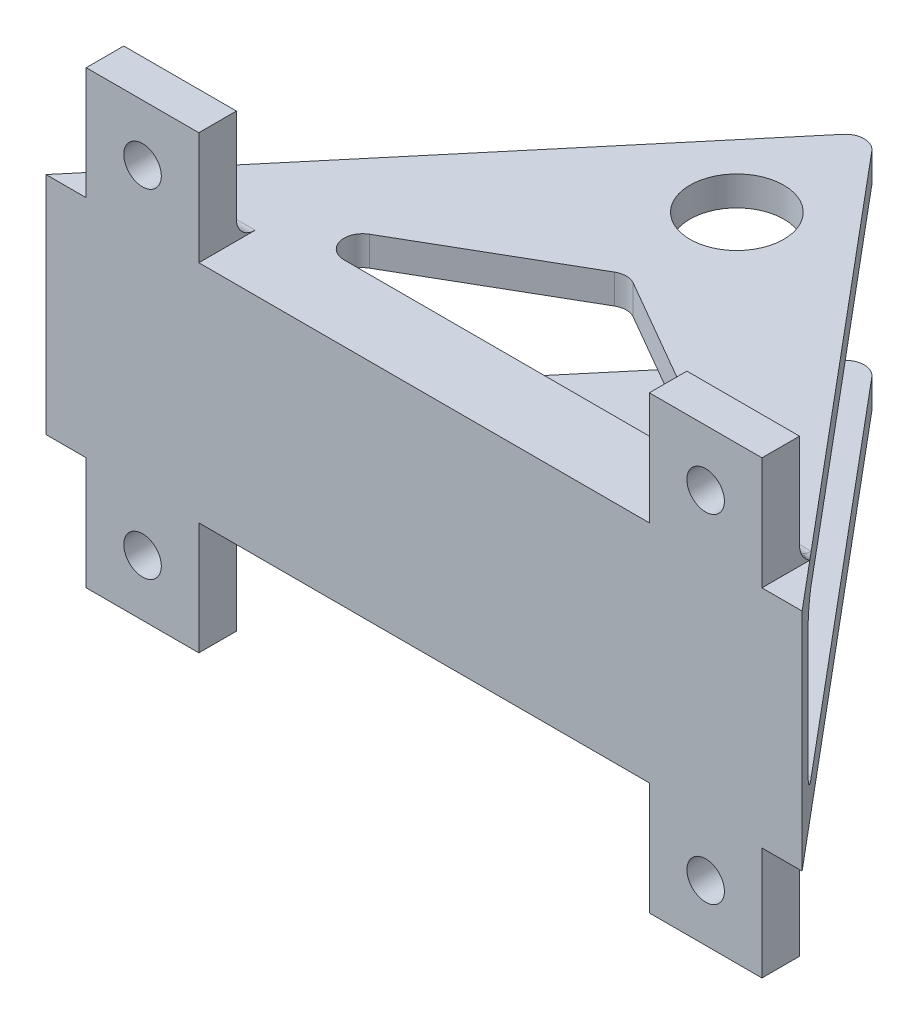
ISO-10303-21;
HEADER;
FILE_DESCRIPTION(('STEP AP214'),'2;1');
FILE_NAME('part.step','',(''),(''),'','','');
FILE_SCHEMA(('AUTOMOTIVE_DESIGN { 1 0 10303 214 1 1 1 1 }'));
ENDSEC;
DATA;
#1=APPLICATION_CONTEXT('core data for automotive mechanical design processes');
#2=APPLICATION_PROTOCOL_DEFINITION('international standard','automotive_design',2000,#1);
#3=PRODUCT_CONTEXT('',#1,'mechanical');
#4=PRODUCT('Part','Part','',(#3));
#5=PRODUCT_RELATED_PRODUCT_CATEGORY('part','',(#4));
#6=PRODUCT_DEFINITION_FORMATION('','',#4);
#7=PRODUCT_DEFINITION_CONTEXT('part definition',#1,'design');
#8=PRODUCT_DEFINITION('design','',#6,#7);
#9=PRODUCT_DEFINITION_SHAPE('','',#8);
#10=(LENGTH_UNIT() NAMED_UNIT(*) SI_UNIT(.MILLI.,.METRE.));
#11=(NAMED_UNIT(*) PLANE_ANGLE_UNIT() SI_UNIT($,.RADIAN.));
#12=(NAMED_UNIT(*) SI_UNIT($,.STERADIAN.) SOLID_ANGLE_UNIT());
#13=UNCERTAINTY_MEASURE_WITH_UNIT(LENGTH_MEASURE(1.E-05),#10,'distance_accuracy_value','');
#14=(GEOMETRIC_REPRESENTATION_CONTEXT(3) GLOBAL_UNCERTAINTY_ASSIGNED_CONTEXT((#13)) GLOBAL_UNIT_ASSIGNED_CONTEXT((#10,
#11,#12)) REPRESENTATION_CONTEXT('',''));
#15=CARTESIAN_POINT('',(0.,0.,0.));
#16=DIRECTION('',(0.,0.,1.));
#17=DIRECTION('',(1.,0.,0.));
#18=AXIS2_PLACEMENT_3D('',#15,#16,#17);
#19=CARTESIAN_POINT('',(0.,0.,0.));
#20=DIRECTION('',(0.,1.,0.));
#21=DIRECTION('',(0.,0.,1.));
#22=AXIS2_PLACEMENT_3D('',#19,#20,#21);
#23=PLANE('',#22);
#24=DIRECTION('',(0.,0.,1.));
#25=VECTOR('',#24,1.);
#26=CARTESIAN_POINT('',(57.15,0.,69.85));
#27=LINE('',#26,#25);
#28=CARTESIAN_POINT('',(57.1499999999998,0.,68.1087178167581));
#29=VERTEX_POINT('',#28);
#30=CARTESIAN_POINT('',(57.15,0.,76.2));
#31=VERTEX_POINT('',#30);
#32=EDGE_CURVE('E371',#29,#31,#27,.T.);
#33=ORIENTED_EDGE('',*,*,#32,.F.);
#34=DIRECTION('',(-0.642787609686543,0.,-0.766044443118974));
#35=VECTOR('',#34,1.);
#36=CARTESIAN_POINT('',(63.9393918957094,0.,76.2));
#37=LINE('',#36,#35);
#38=CARTESIAN_POINT('',(63.9393918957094,0.,76.2));
#39=VERTEX_POINT('',#38);
#40=EDGE_CURVE('E567',#39,#29,#37,.T.);
#41=ORIENTED_EDGE('',*,*,#40,.F.);
#42=DIRECTION('',(1.,0.,0.));
#43=VECTOR('',#42,1.);
#44=CARTESIAN_POINT('',(-63.9393918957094,0.,76.2));
#45=LINE('',#44,#43);
#46=EDGE_CURVE('E582',#31,#39,#45,.T.);
#47=ORIENTED_EDGE('',*,*,#46,.F.);
#48=EDGE_LOOP('',(#33,#41,#47));
#49=FACE_BOUND('',#48,.T.);
#50=ADVANCED_FACE('F43',(#49),#23,.F.);
#51=CARTESIAN_POINT('',(0.,0.,23.29942));
#52=DIRECTION('',(0.,1.,0.));
#53=DIRECTION('',(0.,0.,1.));
#54=AXIS2_PLACEMENT_3D('',#51,#52,#53);
#55=CIRCLE('',#54,7.9375);
#56=CARTESIAN_POINT('',(0.,0.,15.36192));
#57=VERTEX_POINT('',#56);
#58=EDGE_CURVE('E541',#57,#57,#55,.T.);
#59=ORIENTED_EDGE('',*,*,#58,.T.);
#60=EDGE_LOOP('',(#59));
#61=FACE_BOUND('',#60,.T.);
#62=DIRECTION('',(-1.,0.,0.));
#63=VECTOR('',#62,1.);
#64=CARTESIAN_POINT('',(-38.1,0.,63.5));
#65=LINE('',#64,#63);
#66=CARTESIAN_POINT('',(26.2507386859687,0.,63.5));
#67=VERTEX_POINT('',#66);
#68=CARTESIAN_POINT('',(-26.2507386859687,0.,63.5));
#69=VERTEX_POINT('',#68);
#70=EDGE_CURVE('E486',#67,#69,#65,.T.);
#71=ORIENTED_EDGE('',*,*,#70,.F.);
#72=CARTESIAN_POINT('',(26.2507386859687,0.,60.325));
#73=DIRECTION('',(0.,1.,0.));
#74=DIRECTION('',(0.,0.,1.));
#75=AXIS2_PLACEMENT_3D('',#72,#73,#74);
#76=CIRCLE('',#75,3.175);
#77=CARTESIAN_POINT('',(27.8382386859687,0.,57.5753693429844));
#78=VERTEX_POINT('',#77);
#79=EDGE_CURVE('E1075',#67,#78,#76,.T.);
#80=ORIENTED_EDGE('',*,*,#79,.T.);
#81=DIRECTION('',(0.866025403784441,0.,0.499999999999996));
#82=VECTOR('',#81,1.);
#83=CARTESIAN_POINT('',(38.1,0.,63.5000000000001));
#84=LINE('',#83,#82);
#85=CARTESIAN_POINT('',(1.5875,0.,42.4194982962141));
#86=VERTEX_POINT('',#85);
#87=EDGE_CURVE('E490',#86,#78,#84,.T.);
#88=ORIENTED_EDGE('',*,*,#87,.F.);
#89=CARTESIAN_POINT('',(0.,0.,45.1691289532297));
#90=DIRECTION('',(0.,1.,0.));
#91=DIRECTION('',(0.,0.,1.));
#92=AXIS2_PLACEMENT_3D('',#89,#90,#91);
#93=CIRCLE('',#92,3.175);
#94=CARTESIAN_POINT('',(-1.58749999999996,0.,42.4194982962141));
#95=VERTEX_POINT('',#94);
#96=EDGE_CURVE('E12',#86,#95,#93,.T.);
#97=ORIENTED_EDGE('',*,*,#96,.T.);
#98=DIRECTION('',(0.866025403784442,0.,-0.499999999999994));
#99=VECTOR('',#98,1.);
#100=CARTESIAN_POINT('',(0.,0.,41.5029547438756));
#101=LINE('',#100,#99);
#102=CARTESIAN_POINT('',(-27.8382386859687,0.,57.5753693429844));
#103=VERTEX_POINT('',#102);
#104=EDGE_CURVE('E495',#103,#95,#101,.T.);
#105=ORIENTED_EDGE('',*,*,#104,.F.);
#106=CARTESIAN_POINT('',(-26.2507386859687,0.,60.325));
#107=DIRECTION('',(0.,1.,0.));
#108=DIRECTION('',(0.,0.,1.));
#109=AXIS2_PLACEMENT_3D('',#106,#107,#108);
#110=CIRCLE('',#109,3.175);
#111=EDGE_CURVE('E1090',#103,#69,#110,.T.);
#112=ORIENTED_EDGE('',*,*,#111,.T.);
#113=EDGE_LOOP('',(#71,#80,#88,#97,#105,#112));
#114=FACE_BOUND('',#113,.T.);
#115=CARTESIAN_POINT('',(55.9469679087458,0.,66.675));
#116=VERTEX_POINT('',#115);
#117=CARTESIAN_POINT('',(2.43219110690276,0.,2.89857248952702));
#118=VERTEX_POINT('',#117);
#119=EDGE_CURVE('E546',#116,#118,#37,.T.);
#120=ORIENTED_EDGE('',*,*,#119,.F.);
#121=DIRECTION('',(1.,0.,0.));
#122=VECTOR('',#121,1.);
#123=CARTESIAN_POINT('',(38.1,0.,66.675));
#124=LINE('',#123,#122);
#125=CARTESIAN_POINT('',(38.1,0.,66.675));
#126=VERTEX_POINT('',#125);
#127=EDGE_CURVE('E1048',#116,#126,#124,.F.);
#128=ORIENTED_EDGE('',*,*,#127,.T.);
#129=DIRECTION('',(0.,0.,-1.));
#130=VECTOR('',#129,1.);
#131=CARTESIAN_POINT('',(38.1,0.,69.85));
#132=LINE('',#131,#130);
#133=CARTESIAN_POINT('',(38.1,0.,76.2));
#134=VERTEX_POINT('',#133);
#135=EDGE_CURVE('E376',#134,#126,#132,.T.);
#136=ORIENTED_EDGE('',*,*,#135,.F.);
#137=CARTESIAN_POINT('',(-38.1,0.,76.2));
#138=VERTEX_POINT('',#137);
#139=EDGE_CURVE('E581',#138,#134,#45,.T.);
#140=ORIENTED_EDGE('',*,*,#139,.F.);
#141=DIRECTION('',(0.,0.,1.));
#142=VECTOR('',#141,1.);
#143=CARTESIAN_POINT('',(-38.1,0.,69.85));
#144=LINE('',#143,#142);
#145=CARTESIAN_POINT('',(-38.1,0.,66.675));
#146=VERTEX_POINT('',#145);
#147=EDGE_CURVE('E365',#146,#138,#144,.T.);
#148=ORIENTED_EDGE('',*,*,#147,.F.);
#149=DIRECTION('',(1.,0.,0.));
#150=VECTOR('',#149,1.);
#151=CARTESIAN_POINT('',(-57.15,0.,66.675));
#152=LINE('',#151,#150);
#153=CARTESIAN_POINT('',(-55.9469679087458,0.,66.675));
#154=VERTEX_POINT('',#153);
#155=EDGE_CURVE('E1046',#146,#154,#152,.F.);
#156=ORIENTED_EDGE('',*,*,#155,.T.);
#157=DIRECTION('',(-0.642787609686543,0.,0.766044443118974));
#158=VECTOR('',#157,1.);
#159=CARTESIAN_POINT('',(0.,0.,0.));
#160=LINE('',#159,#158);
#161=CARTESIAN_POINT('',(-2.43219110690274,0.,2.898572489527));
#162=VERTEX_POINT('',#161);
#163=EDGE_CURVE('E576',#162,#154,#160,.T.);
#164=ORIENTED_EDGE('',*,*,#163,.F.);
#165=CARTESIAN_POINT('',(0.,0.,4.93942315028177));
#166=DIRECTION('',(0.,1.,0.));
#167=DIRECTION('',(0.,0.,1.));
#168=AXIS2_PLACEMENT_3D('',#165,#166,#167);
#169=CIRCLE('',#168,3.175);
#170=EDGE_CURVE('E1044',#162,#118,#169,.F.);
#171=ORIENTED_EDGE('',*,*,#170,.T.);
#172=EDGE_LOOP('',(#120,#128,#136,#140,#148,#156,#164,#171));
#173=FACE_BOUND('',#172,.T.);
#174=ADVANCED_FACE('F784',(#61,#114,#173),#23,.F.);
#175=CARTESIAN_POINT('',(0.,38.1,0.));
#176=DIRECTION('',(0.,1.,0.));
#177=DIRECTION('',(0.,0.,1.));
#178=AXIS2_PLACEMENT_3D('',#175,#176,#177);
#179=PLANE('',#178);
#180=CARTESIAN_POINT('',(0.,38.1,23.29942));
#181=DIRECTION('',(0.,1.,0.));
#182=DIRECTION('',(0.,0.,1.));
#183=AXIS2_PLACEMENT_3D('',#180,#181,#182);
#184=CIRCLE('',#183,7.9375);
#185=CARTESIAN_POINT('',(0.,38.1,15.36192));
#186=VERTEX_POINT('',#185);
#187=EDGE_CURVE('E542',#186,#186,#184,.T.);
#188=ORIENTED_EDGE('',*,*,#187,.F.);
#189=EDGE_LOOP('',(#188));
#190=FACE_BOUND('',#189,.T.);
#191=DIRECTION('',(-0.866025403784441,0.,-0.499999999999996));
#192=VECTOR('',#191,1.);
#193=CARTESIAN_POINT('',(38.1,38.1,63.5000000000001));
#194=LINE('',#193,#192);
#195=CARTESIAN_POINT('',(27.8382386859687,38.1,57.5753693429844));
#196=VERTEX_POINT('',#195);
#197=CARTESIAN_POINT('',(1.5875,38.1,42.4194982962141));
#198=VERTEX_POINT('',#197);
#199=EDGE_CURVE('E485',#196,#198,#194,.T.);
#200=ORIENTED_EDGE('',*,*,#199,.F.);
#201=CARTESIAN_POINT('',(26.2507386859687,38.1,60.325));
#202=DIRECTION('',(0.,1.,0.));
#203=DIRECTION('',(0.,0.,1.));
#204=AXIS2_PLACEMENT_3D('',#201,#202,#203);
#205=CIRCLE('',#204,3.175);
#206=CARTESIAN_POINT('',(26.2507386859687,38.1,63.5));
#207=VERTEX_POINT('',#206);
#208=EDGE_CURVE('E1081',#196,#207,#205,.F.);
#209=ORIENTED_EDGE('',*,*,#208,.T.);
#210=DIRECTION('',(1.,0.,0.));
#211=VECTOR('',#210,1.);
#212=CARTESIAN_POINT('',(-38.1,38.1,63.5));
#213=LINE('',#212,#211);
#214=CARTESIAN_POINT('',(-26.2507386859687,38.1,63.5));
#215=VERTEX_POINT('',#214);
#216=EDGE_CURVE('E491',#215,#207,#213,.T.);
#217=ORIENTED_EDGE('',*,*,#216,.F.);
#218=CARTESIAN_POINT('',(-26.2507386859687,38.1,60.325));
#219=DIRECTION('',(0.,1.,0.));
#220=DIRECTION('',(0.,0.,1.));
#221=AXIS2_PLACEMENT_3D('',#218,#219,#220);
#222=CIRCLE('',#221,3.175);
#223=CARTESIAN_POINT('',(-27.8382386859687,38.1,57.5753693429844));
#224=VERTEX_POINT('',#223);
#225=EDGE_CURVE('E1093',#215,#224,#222,.F.);
#226=ORIENTED_EDGE('',*,*,#225,.T.);
#227=DIRECTION('',(-0.866025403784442,0.,0.499999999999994));
#228=VECTOR('',#227,1.);
#229=CARTESIAN_POINT('',(0.,38.1,41.5029547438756));
#230=LINE('',#229,#228);
#231=CARTESIAN_POINT('',(-1.58749999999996,38.1,42.4194982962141));
#232=VERTEX_POINT('',#231);
#233=EDGE_CURVE('E499',#232,#224,#230,.T.);
#234=ORIENTED_EDGE('',*,*,#233,.F.);
#235=CARTESIAN_POINT('',(0.,38.1,45.1691289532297));
#236=DIRECTION('',(0.,1.,0.));
#237=DIRECTION('',(0.,0.,1.));
#238=AXIS2_PLACEMENT_3D('',#235,#236,#237);
#239=CIRCLE('',#238,3.175);
#240=EDGE_CURVE('E1099',#232,#198,#239,.F.);
#241=ORIENTED_EDGE('',*,*,#240,.T.);
#242=EDGE_LOOP('',(#200,#209,#217,#226,#234,#241));
#243=FACE_BOUND('',#242,.T.);
#244=DIRECTION('',(0.,0.,1.));
#245=VECTOR('',#244,1.);
#246=CARTESIAN_POINT('',(38.1,38.1,76.2));
#247=LINE('',#246,#245);
#248=CARTESIAN_POINT('',(38.1,38.1,66.675));
#249=VERTEX_POINT('',#248);
#250=CARTESIAN_POINT('',(38.1,38.1,76.2));
#251=VERTEX_POINT('',#250);
#252=EDGE_CURVE('E419',#249,#251,#247,.T.);
#253=ORIENTED_EDGE('',*,*,#252,.F.);
#254=DIRECTION('',(-1.,0.,0.));
#255=VECTOR('',#254,1.);
#256=CARTESIAN_POINT('',(0.,38.1,66.675));
#257=LINE('',#256,#255);
#258=CARTESIAN_POINT('',(55.9469679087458,38.1,66.675));
#259=VERTEX_POINT('',#258);
#260=EDGE_CURVE('E886',#249,#259,#257,.F.);
#261=ORIENTED_EDGE('',*,*,#260,.T.);
#262=DIRECTION('',(-0.642787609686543,0.,-0.766044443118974));
#263=VECTOR('',#262,1.);
#264=CARTESIAN_POINT('',(63.9393918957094,38.1,76.2));
#265=LINE('',#264,#263);
#266=CARTESIAN_POINT('',(2.43219110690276,38.1,2.89857248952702));
#267=VERTEX_POINT('',#266);
#268=EDGE_CURVE('E556',#259,#267,#265,.T.);
#269=ORIENTED_EDGE('',*,*,#268,.T.);
#270=CARTESIAN_POINT('',(0.,38.1,4.93942315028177));
#271=DIRECTION('',(0.,1.,0.));
#272=DIRECTION('',(0.,0.,1.));
#273=AXIS2_PLACEMENT_3D('',#270,#271,#272);
#274=CIRCLE('',#273,3.175);
#275=CARTESIAN_POINT('',(-2.43219110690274,38.1,2.898572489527));
#276=VERTEX_POINT('',#275);
#277=EDGE_CURVE('E625',#267,#276,#274,.T.);
#278=ORIENTED_EDGE('',*,*,#277,.T.);
#279=DIRECTION('',(-0.642787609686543,0.,0.766044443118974));
#280=VECTOR('',#279,1.);
#281=CARTESIAN_POINT('',(0.,38.1,0.));
#282=LINE('',#281,#280);
#283=CARTESIAN_POINT('',(-55.9469679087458,38.1,66.675));
#284=VERTEX_POINT('',#283);
#285=EDGE_CURVE('E560',#276,#284,#282,.T.);
#286=ORIENTED_EDGE('',*,*,#285,.T.);
#287=DIRECTION('',(-1.,0.,0.));
#288=VECTOR('',#287,1.);
#289=CARTESIAN_POINT('',(0.,38.1,66.675));
#290=LINE('',#289,#288);
#291=CARTESIAN_POINT('',(-38.1,38.1,66.675));
#292=VERTEX_POINT('',#291);
#293=EDGE_CURVE('E1037',#284,#292,#290,.F.);
#294=ORIENTED_EDGE('',*,*,#293,.T.);
#295=DIRECTION('',(0.,0.,-1.));
#296=VECTOR('',#295,1.);
#297=CARTESIAN_POINT('',(-38.1,38.1,76.2));
#298=LINE('',#297,#296);
#299=CARTESIAN_POINT('',(-38.1,38.1,76.2));
#300=VERTEX_POINT('',#299);
#301=EDGE_CURVE('E455',#300,#292,#298,.T.);
#302=ORIENTED_EDGE('',*,*,#301,.F.);
#303=DIRECTION('',(1.,0.,0.));
#304=VECTOR('',#303,1.);
#305=CARTESIAN_POINT('',(-63.9393918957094,38.1,76.2));
#306=LINE('',#305,#304);
#307=EDGE_CURVE('E565',#300,#251,#306,.T.);
#308=ORIENTED_EDGE('',*,*,#307,.T.);
#309=EDGE_LOOP('',(#253,#261,#269,#278,#286,#294,#302,#308));
#310=FACE_BOUND('',#309,.T.);
#311=ADVANCED_FACE('F832',(#190,#243,#310),#179,.T.);
#312=DIRECTION('',(0.,0.,1.));
#313=VECTOR('',#312,1.);
#314=CARTESIAN_POINT('',(-57.15,38.1,76.2));
#315=LINE('',#314,#313);
#316=CARTESIAN_POINT('',(-57.1499999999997,38.1,68.108717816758));
#317=VERTEX_POINT('',#316);
#318=CARTESIAN_POINT('',(-57.15,38.1,76.2));
#319=VERTEX_POINT('',#318);
#320=EDGE_CURVE('E449',#317,#319,#315,.T.);
#321=ORIENTED_EDGE('',*,*,#320,.F.);
#322=CARTESIAN_POINT('',(-63.9393918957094,38.1,76.2));
#323=VERTEX_POINT('',#322);
#324=EDGE_CURVE('E554',#317,#323,#282,.T.);
#325=ORIENTED_EDGE('',*,*,#324,.T.);
#326=EDGE_CURVE('E561',#323,#319,#306,.T.);
#327=ORIENTED_EDGE('',*,*,#326,.T.);
#328=EDGE_LOOP('',(#321,#325,#327));
#329=FACE_BOUND('',#328,.T.);
#330=ADVANCED_FACE('F836',(#329),#179,.T.);
#331=CARTESIAN_POINT('',(-57.15,0.,68.1087178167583));
#332=VERTEX_POINT('',#331);
#333=CARTESIAN_POINT('',(-63.9393918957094,0.,76.2));
#334=VERTEX_POINT('',#333);
#335=EDGE_CURVE('E571',#332,#334,#160,.T.);
#336=ORIENTED_EDGE('',*,*,#335,.F.);
#337=DIRECTION('',(0.,0.,-1.));
#338=VECTOR('',#337,1.);
#339=CARTESIAN_POINT('',(-57.15,0.,69.85));
#340=LINE('',#339,#338);
#341=CARTESIAN_POINT('',(-57.15,0.,76.2));
#342=VERTEX_POINT('',#341);
#343=EDGE_CURVE('E762',#342,#332,#340,.T.);
#344=ORIENTED_EDGE('',*,*,#343,.F.);
#345=EDGE_CURVE('E577',#334,#342,#45,.T.);
#346=ORIENTED_EDGE('',*,*,#345,.F.);
#347=EDGE_LOOP('',(#336,#344,#346));
#348=FACE_BOUND('',#347,.T.);
#349=ADVANCED_FACE('F709',(#348),#23,.F.);
#350=CARTESIAN_POINT('',(63.9393918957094,38.1,76.2));
#351=VERTEX_POINT('',#350);
#352=CARTESIAN_POINT('',(57.15,38.1,68.1087178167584));
#353=VERTEX_POINT('',#352);
#354=EDGE_CURVE('E550',#351,#353,#265,.T.);
#355=ORIENTED_EDGE('',*,*,#354,.T.);
#356=DIRECTION('',(0.,0.,-1.));
#357=VECTOR('',#356,1.);
#358=CARTESIAN_POINT('',(57.15,38.1,76.2));
#359=LINE('',#358,#357);
#360=CARTESIAN_POINT('',(57.15,38.1,76.2));
#361=VERTEX_POINT('',#360);
#362=EDGE_CURVE('E413',#361,#353,#359,.T.);
#363=ORIENTED_EDGE('',*,*,#362,.F.);
#364=EDGE_CURVE('E566',#361,#351,#306,.T.);
#365=ORIENTED_EDGE('',*,*,#364,.T.);
#366=EDGE_LOOP('',(#355,#363,#365));
#367=FACE_BOUND('',#366,.T.);
#368=ADVANCED_FACE('F835',(#367),#179,.T.);
#369=CARTESIAN_POINT('',(63.9393918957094,38.1,76.2));
#370=DIRECTION('',(-0.766044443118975,0.,0.642787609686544));
#371=DIRECTION('',(0.642787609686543,0.,0.766044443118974));
#372=AXIS2_PLACEMENT_3D('',#369,#370,#371);
#373=PLANE('',#372);
#374=ORIENTED_EDGE('',*,*,#119,.T.);
#375=DIRECTION('',(0.,-1.,0.));
#376=VECTOR('',#375,1.);
#377=CARTESIAN_POINT('',(2.43219110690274,38.1,2.89857248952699));
#378=LINE('',#377,#376);
#379=CARTESIAN_POINT('',(2.43219110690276,4.9784,2.89857248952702));
#380=VERTEX_POINT('',#379);
#381=EDGE_CURVE('E889',#118,#380,#378,.F.);
#382=ORIENTED_EDGE('',*,*,#381,.T.);
#383=DIRECTION('',(-0.642787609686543,0.,-0.766044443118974));
#384=VECTOR('',#383,1.);
#385=CARTESIAN_POINT('',(63.9393918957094,4.9784,76.2));
#386=LINE('',#385,#384);
#387=CARTESIAN_POINT('',(55.9469679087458,4.9784,66.675));
#388=VERTEX_POINT('',#387);
#389=EDGE_CURVE('E525',#388,#380,#386,.T.);
#390=ORIENTED_EDGE('',*,*,#389,.F.);
#391=CARTESIAN_POINT('',(55.9469679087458,8.1534,66.675));
#392=DIRECTION('',(-0.766044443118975,0.,0.642787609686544));
#393=DIRECTION('',(0.642787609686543,0.,0.766044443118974));
#394=AXIS2_PLACEMENT_3D('',#391,#392,#393);
#395=ELLIPSE('',#394,4.14466814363,3.175);
#396=CARTESIAN_POINT('',(58.6111092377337,8.1534,69.85));
#397=VERTEX_POINT('',#396);
#398=EDGE_CURVE('E1068',#388,#397,#395,.T.);
#399=ORIENTED_EDGE('',*,*,#398,.T.);
#400=DIRECTION('',(0.,-1.,0.));
#401=VECTOR('',#400,1.);
#402=CARTESIAN_POINT('',(58.6111092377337,38.1,69.85));
#403=LINE('',#402,#401);
#404=CARTESIAN_POINT('',(58.6111092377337,29.9466,69.85));
#405=VERTEX_POINT('',#404);
#406=EDGE_CURVE('E537',#405,#397,#403,.T.);
#407=ORIENTED_EDGE('',*,*,#406,.F.);
#408=CARTESIAN_POINT('',(55.9469679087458,29.9466,66.675));
#409=DIRECTION('',(-0.766044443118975,0.,0.642787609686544));
#410=DIRECTION('',(-0.642787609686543,0.,-0.766044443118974));
#411=AXIS2_PLACEMENT_3D('',#408,#409,#410);
#412=ELLIPSE('',#411,4.14466814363,3.175);
#413=CARTESIAN_POINT('',(55.9469679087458,33.1216,66.675));
#414=VERTEX_POINT('',#413);
#415=EDGE_CURVE('E800',#405,#414,#412,.T.);
#416=ORIENTED_EDGE('',*,*,#415,.T.);
#417=DIRECTION('',(0.642787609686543,0.,0.766044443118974));
#418=VECTOR('',#417,1.);
#419=CARTESIAN_POINT('',(63.9393918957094,33.1216,76.2));
#420=LINE('',#419,#418);
#421=CARTESIAN_POINT('',(2.43219110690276,33.1216,2.89857248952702));
#422=VERTEX_POINT('',#421);
#423=EDGE_CURVE('E533',#422,#414,#420,.T.);
#424=ORIENTED_EDGE('',*,*,#423,.F.);
#425=DIRECTION('',(0.,-1.,0.));
#426=VECTOR('',#425,1.);
#427=CARTESIAN_POINT('',(2.43219110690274,38.1,2.89857248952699));
#428=LINE('',#427,#426);
#429=EDGE_CURVE('E893',#422,#267,#428,.F.);
#430=ORIENTED_EDGE('',*,*,#429,.T.);
#431=ORIENTED_EDGE('',*,*,#268,.F.);
#432=EDGE_CURVE('E555',#353,#259,#265,.T.);
#433=ORIENTED_EDGE('',*,*,#432,.F.);
#434=ORIENTED_EDGE('',*,*,#354,.F.);
#435=DIRECTION('',(0.,-1.,0.));
#436=VECTOR('',#435,1.);
#437=CARTESIAN_POINT('',(63.9393918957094,38.1,76.2));
#438=LINE('',#437,#436);
#439=EDGE_CURVE('E564',#351,#39,#438,.T.);
#440=ORIENTED_EDGE('',*,*,#439,.T.);
#441=ORIENTED_EDGE('',*,*,#40,.T.);
#442=EDGE_CURVE('E572',#29,#116,#37,.T.);
#443=ORIENTED_EDGE('',*,*,#442,.T.);
#444=EDGE_LOOP('',(#374,#382,#390,#399,#407,#416,#424,#430,#431,#433,#434,#440,#441,#443));
#445=FACE_BOUND('',#444,.T.);
#446=ADVANCED_FACE('F635',(#445),#373,.F.);
#447=CARTESIAN_POINT('',(0.,38.1,0.));
#448=DIRECTION('',(0.766044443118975,0.,0.642787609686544));
#449=DIRECTION('',(0.642787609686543,0.,-0.766044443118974));
#450=AXIS2_PLACEMENT_3D('',#447,#448,#449);
#451=PLANE('',#450);
#452=DIRECTION('',(-0.642787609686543,0.,0.766044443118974));
#453=VECTOR('',#452,1.);
#454=CARTESIAN_POINT('',(0.,4.9784,0.));
#455=LINE('',#454,#453);
#456=CARTESIAN_POINT('',(-2.43219110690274,4.9784,2.898572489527));
#457=VERTEX_POINT('',#456);
#458=CARTESIAN_POINT('',(-55.9469679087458,4.9784,66.675));
#459=VERTEX_POINT('',#458);
#460=EDGE_CURVE('E522',#457,#459,#455,.T.);
#461=ORIENTED_EDGE('',*,*,#460,.F.);
#462=DIRECTION('',(0.,-1.,0.));
#463=VECTOR('',#462,1.);
#464=CARTESIAN_POINT('',(-2.43219110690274,38.1,2.898572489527));
#465=LINE('',#464,#463);
#466=EDGE_CURVE('E1021',#457,#162,#465,.T.);
#467=ORIENTED_EDGE('',*,*,#466,.T.);
#468=ORIENTED_EDGE('',*,*,#163,.T.);
#469=EDGE_CURVE('E575',#154,#332,#160,.T.);
#470=ORIENTED_EDGE('',*,*,#469,.T.);
#471=ORIENTED_EDGE('',*,*,#335,.T.);
#472=DIRECTION('',(0.,-1.,0.));
#473=VECTOR('',#472,1.);
#474=CARTESIAN_POINT('',(-63.9393918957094,38.1,76.2));
#475=LINE('',#474,#473);
#476=EDGE_CURVE('E586',#323,#334,#475,.T.);
#477=ORIENTED_EDGE('',*,*,#476,.F.);
#478=ORIENTED_EDGE('',*,*,#324,.F.);
#479=EDGE_CURVE('E559',#284,#317,#282,.T.);
#480=ORIENTED_EDGE('',*,*,#479,.F.);
#481=ORIENTED_EDGE('',*,*,#285,.F.);
#482=DIRECTION('',(0.,-1.,0.));
#483=VECTOR('',#482,1.);
#484=CARTESIAN_POINT('',(-2.43219110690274,38.1,2.898572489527));
#485=LINE('',#484,#483);
#486=CARTESIAN_POINT('',(-2.43219110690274,33.1216,2.898572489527));
#487=VERTEX_POINT('',#486);
#488=EDGE_CURVE('E1017',#276,#487,#485,.T.);
#489=ORIENTED_EDGE('',*,*,#488,.T.);
#490=DIRECTION('',(0.642787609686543,0.,-0.766044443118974));
#491=VECTOR('',#490,1.);
#492=CARTESIAN_POINT('',(0.,33.1216,0.));
#493=LINE('',#492,#491);
#494=CARTESIAN_POINT('',(-55.9469679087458,33.1216,66.675));
#495=VERTEX_POINT('',#494);
#496=EDGE_CURVE('E529',#495,#487,#493,.T.);
#497=ORIENTED_EDGE('',*,*,#496,.F.);
#498=CARTESIAN_POINT('',(-55.9469679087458,29.9466,66.675));
#499=DIRECTION('',(0.766044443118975,0.,0.642787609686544));
#500=DIRECTION('',(-0.642787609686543,0.,0.766044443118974));
#501=AXIS2_PLACEMENT_3D('',#498,#499,#500);
#502=ELLIPSE('',#501,4.14466814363,3.175);
#503=CARTESIAN_POINT('',(-58.6111092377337,29.9466,69.85));
#504=VERTEX_POINT('',#503);
#505=EDGE_CURVE('E804',#495,#504,#502,.T.);
#506=ORIENTED_EDGE('',*,*,#505,.T.);
#507=DIRECTION('',(0.,1.,0.));
#508=VECTOR('',#507,1.);
#509=CARTESIAN_POINT('',(-58.6111092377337,38.1,69.85));
#510=LINE('',#509,#508);
#511=CARTESIAN_POINT('',(-58.6111092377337,8.1534,69.85));
#512=VERTEX_POINT('',#511);
#513=EDGE_CURVE('E590',#512,#504,#510,.T.);
#514=ORIENTED_EDGE('',*,*,#513,.F.);
#515=CARTESIAN_POINT('',(-55.9469679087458,8.1534,66.675));
#516=DIRECTION('',(0.766044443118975,0.,0.642787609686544));
#517=DIRECTION('',(0.642787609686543,0.,-0.766044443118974));
#518=AXIS2_PLACEMENT_3D('',#515,#516,#517);
#519=ELLIPSE('',#518,4.14466814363,3.175);
#520=EDGE_CURVE('E65',#512,#459,#519,.T.);
#521=ORIENTED_EDGE('',*,*,#520,.T.);
#522=EDGE_LOOP('',(#461,#467,#468,#470,#471,#477,#478,#480,#481,#489,#497,#506,#514,#521));
#523=FACE_BOUND('',#522,.T.);
#524=ADVANCED_FACE('F795',(#523),#451,.F.);
#525=CARTESIAN_POINT('',(0.,38.1,23.29942));
#526=DIRECTION('',(0.,-1.,0.));
#527=DIRECTION('',(0.,0.,-1.));
#528=AXIS2_PLACEMENT_3D('',#525,#526,#527);
#529=CYLINDRICAL_SURFACE('',#528,7.9375);
#530=CARTESIAN_POINT('',(0.,33.1216,23.29942));
#531=DIRECTION('',(0.,-1.,0.));
#532=DIRECTION('',(0.,0.,-1.));
#533=AXIS2_PLACEMENT_3D('',#530,#531,#532);
#534=CIRCLE('',#533,7.9375);
#535=CARTESIAN_POINT('',(0.,33.1216,15.36192));
#536=VERTEX_POINT('',#535);
#537=EDGE_CURVE('E528',#536,#536,#534,.T.);
#538=CARTESIAN_POINT('',(0.,38.1,15.36192));
#539=CARTESIAN_POINT('',(0.,38.0481416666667,15.36192));
#540=CARTESIAN_POINT('',(0.,37.9962833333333,15.36192));
#541=CARTESIAN_POINT('',(0.,37.8925666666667,15.36192));
#542=CARTESIAN_POINT('',(0.,37.8407083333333,15.36192));
#543=CARTESIAN_POINT('',(0.,37.7369916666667,15.36192));
#544=CARTESIAN_POINT('',(0.,37.6851333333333,15.36192));
#545=CARTESIAN_POINT('',(0.,37.5814166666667,15.36192));
#546=CARTESIAN_POINT('',(0.,37.5295583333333,15.36192));
#547=CARTESIAN_POINT('',(0.,37.4258416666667,15.36192));
#548=CARTESIAN_POINT('',(0.,37.3739833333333,15.36192));
#549=CARTESIAN_POINT('',(0.,37.2702666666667,15.36192));
#550=CARTESIAN_POINT('',(0.,37.2184083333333,15.36192));
#551=CARTESIAN_POINT('',(0.,37.1146916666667,15.36192));
#552=CARTESIAN_POINT('',(0.,37.0628333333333,15.36192));
#553=CARTESIAN_POINT('',(0.,36.9591166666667,15.36192));
#554=CARTESIAN_POINT('',(0.,36.9072583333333,15.36192));
#555=CARTESIAN_POINT('',(0.,36.8035416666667,15.36192));
#556=CARTESIAN_POINT('',(0.,36.7516833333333,15.36192));
#557=CARTESIAN_POINT('',(0.,36.6479666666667,15.36192));
#558=CARTESIAN_POINT('',(0.,36.5961083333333,15.36192));
#559=CARTESIAN_POINT('',(0.,36.4923916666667,15.36192));
#560=CARTESIAN_POINT('',(0.,36.4405333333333,15.36192));
#561=CARTESIAN_POINT('',(0.,36.3368166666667,15.36192));
#562=CARTESIAN_POINT('',(0.,36.2849583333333,15.36192));
#563=CARTESIAN_POINT('',(0.,36.1812416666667,15.36192));
#564=CARTESIAN_POINT('',(0.,36.1293833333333,15.36192));
#565=CARTESIAN_POINT('',(0.,36.0256666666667,15.36192));
#566=CARTESIAN_POINT('',(0.,35.9738083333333,15.36192));
#567=CARTESIAN_POINT('',(0.,35.8700916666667,15.36192));
#568=CARTESIAN_POINT('',(0.,35.8182333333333,15.36192));
#569=CARTESIAN_POINT('',(0.,35.7145166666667,15.36192));
#570=CARTESIAN_POINT('',(0.,35.6626583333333,15.36192));
#571=CARTESIAN_POINT('',(0.,35.5589416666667,15.36192));
#572=CARTESIAN_POINT('',(0.,35.5070833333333,15.36192));
#573=CARTESIAN_POINT('',(0.,35.4033666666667,15.36192));
#574=CARTESIAN_POINT('',(0.,35.3515083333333,15.36192));
#575=CARTESIAN_POINT('',(0.,35.2477916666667,15.36192));
#576=CARTESIAN_POINT('',(0.,35.1959333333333,15.36192));
#577=CARTESIAN_POINT('',(0.,35.0922166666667,15.36192));
#578=CARTESIAN_POINT('',(0.,35.0403583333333,15.36192));
#579=CARTESIAN_POINT('',(0.,34.9366416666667,15.36192));
#580=CARTESIAN_POINT('',(0.,34.8847833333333,15.36192));
#581=CARTESIAN_POINT('',(0.,34.7810666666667,15.36192));
#582=CARTESIAN_POINT('',(0.,34.7292083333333,15.36192));
#583=CARTESIAN_POINT('',(0.,34.6254916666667,15.36192));
#584=CARTESIAN_POINT('',(0.,34.5736333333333,15.36192));
#585=CARTESIAN_POINT('',(0.,34.4699166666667,15.36192));
#586=CARTESIAN_POINT('',(0.,34.4180583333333,15.36192));
#587=CARTESIAN_POINT('',(0.,34.3143416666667,15.36192));
#588=CARTESIAN_POINT('',(0.,34.2624833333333,15.36192));
#589=CARTESIAN_POINT('',(0.,34.1587666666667,15.36192));
#590=CARTESIAN_POINT('',(0.,34.1069083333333,15.36192));
#591=CARTESIAN_POINT('',(0.,34.0031916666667,15.36192));
#592=CARTESIAN_POINT('',(0.,33.9513333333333,15.36192));
#593=CARTESIAN_POINT('',(0.,33.8476166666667,15.36192));
#594=CARTESIAN_POINT('',(0.,33.7957583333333,15.36192));
#595=CARTESIAN_POINT('',(0.,33.6920416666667,15.36192));
#596=CARTESIAN_POINT('',(0.,33.6401833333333,15.36192));
#597=CARTESIAN_POINT('',(0.,33.5364666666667,15.36192));
#598=CARTESIAN_POINT('',(0.,33.4846083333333,15.36192));
#599=CARTESIAN_POINT('',(0.,33.3808916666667,15.36192));
#600=CARTESIAN_POINT('',(0.,33.3290333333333,15.36192));
#601=CARTESIAN_POINT('',(0.,33.2253166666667,15.36192));
#602=CARTESIAN_POINT('',(0.,33.1734583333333,15.36192));
#603=CARTESIAN_POINT('',(0.,33.1216,15.36192));
#604=B_SPLINE_CURVE_WITH_KNOTS('',3,(#538,#539,#540,#541,#542,#543,#544,#545,#546,#547,#548,
#549,#550,#551,#552,#553,#554,#555,#556,#557,#558,#559,#560,#561,#562,#563,#564,#565,#566,#567,
#568,#569,#570,#571,#572,#573,#574,#575,#576,#577,#578,#579,#580,#581,#582,#583,#584,#585,#586,
#587,#588,#589,#590,#591,#592,#593,#594,#595,#596,#597,#598,#599,#600,#601,#602,#603),
.UNSPECIFIED.,.F.,.F.,(4,2,2,2,2,2,2,2,2,2,2,2,2,2,2,2,2,2,2,2,2,2,2,2,2,2,2,2,2,2,2,2,4),(0.,
0.155574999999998,0.311149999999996,0.466724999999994,0.622299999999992,0.777874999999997,
0.933449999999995,1.08902499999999,1.24459999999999,1.400175,1.55574999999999,1.71132499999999,
1.86689999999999,2.022475,2.17804999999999,2.33362499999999,2.48919999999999,2.644775,
2.80034999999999,2.95592499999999,3.11149999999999,3.26707499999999,3.42264999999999,
3.57822499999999,3.73379999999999,3.88937499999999,4.04494999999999,4.20052499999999,
4.35609999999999,4.51167499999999,4.66724999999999,4.82282499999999,4.97839999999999),.UNSPECIFIED.);
#605=EDGE_CURVE('BSEAM1118',#186,#536,#604,.T.);
#606=ORIENTED_EDGE('',*,*,#187,.T.);
#607=ORIENTED_EDGE('',*,*,#537,.T.);
#608=ORIENTED_EDGE('',*,*,#605,.T.);
#609=ORIENTED_EDGE('',*,*,#605,.F.);
#610=EDGE_LOOP('',(#606,#608,#607,#609));
#611=FACE_BOUND('',#610,.T.);
#612=ADVANCED_FACE('F1118',(#611),#529,.F.);
#613=CARTESIAN_POINT('',(0.,4.9784,23.29942));
#614=DIRECTION('',(0.,1.,0.));
#615=DIRECTION('',(0.,0.,1.));
#616=AXIS2_PLACEMENT_3D('',#613,#614,#615);
#617=CIRCLE('',#616,7.9375);
#618=CARTESIAN_POINT('',(0.,4.97839999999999,15.36192));
#619=VERTEX_POINT('',#618);
#620=EDGE_CURVE('E521',#619,#619,#617,.T.);
#621=CARTESIAN_POINT('',(0.,0.,15.36192));
#622=CARTESIAN_POINT('',(0.,0.0518583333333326,15.36192));
#623=CARTESIAN_POINT('',(0.,0.103716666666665,15.36192));
#624=CARTESIAN_POINT('',(0.,0.207433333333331,15.36192));
#625=CARTESIAN_POINT('',(0.,0.259291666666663,15.36192));
#626=CARTESIAN_POINT('',(0.,0.363008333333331,15.36192));
#627=CARTESIAN_POINT('',(0.,0.414866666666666,15.36192));
#628=CARTESIAN_POINT('',(0.,0.518583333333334,15.36192));
#629=CARTESIAN_POINT('',(0.,0.570441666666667,15.36192));
#630=CARTESIAN_POINT('',(0.,0.674158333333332,15.36192));
#631=CARTESIAN_POINT('',(0.,0.726016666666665,15.36192));
#632=CARTESIAN_POINT('',(0.,0.829733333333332,15.36192));
#633=CARTESIAN_POINT('',(0.,0.881591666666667,15.36192));
#634=CARTESIAN_POINT('',(0.,0.985308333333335,15.36192));
#635=CARTESIAN_POINT('',(0.,1.03716666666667,15.36192));
#636=CARTESIAN_POINT('',(0.,1.14088333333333,15.36192));
#637=CARTESIAN_POINT('',(0.,1.19274166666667,15.36192));
#638=CARTESIAN_POINT('',(0.,1.29645833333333,15.36192));
#639=CARTESIAN_POINT('',(0.,1.34831666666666,15.36192));
#640=CARTESIAN_POINT('',(0.,1.45203333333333,15.36192));
#641=CARTESIAN_POINT('',(0.,1.50389166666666,15.36192));
#642=CARTESIAN_POINT('',(0.,1.60760833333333,15.36192));
#643=CARTESIAN_POINT('',(0.,1.65946666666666,15.36192));
#644=CARTESIAN_POINT('',(0.,1.76318333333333,15.36192));
#645=CARTESIAN_POINT('',(0.,1.81504166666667,15.36192));
#646=CARTESIAN_POINT('',(0.,1.91875833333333,15.36192));
#647=CARTESIAN_POINT('',(0.,1.97061666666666,15.36192));
#648=CARTESIAN_POINT('',(0.,2.07433333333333,15.36192));
#649=CARTESIAN_POINT('',(0.,2.12619166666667,15.36192));
#650=CARTESIAN_POINT('',(0.,2.22990833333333,15.36192));
#651=CARTESIAN_POINT('',(0.,2.28176666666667,15.36192));
#652=CARTESIAN_POINT('',(0.,2.38548333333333,15.36192));
#653=CARTESIAN_POINT('',(0.,2.43734166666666,15.36192));
#654=CARTESIAN_POINT('',(0.,2.54105833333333,15.36192));
#655=CARTESIAN_POINT('',(0.,2.59291666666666,15.36192));
#656=CARTESIAN_POINT('',(0.,2.69663333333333,15.36192));
#657=CARTESIAN_POINT('',(0.,2.74849166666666,15.36192));
#658=CARTESIAN_POINT('',(0.,2.85220833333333,15.36192));
#659=CARTESIAN_POINT('',(0.,2.90406666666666,15.36192));
#660=CARTESIAN_POINT('',(0.,3.00778333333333,15.36192));
#661=CARTESIAN_POINT('',(0.,3.05964166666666,15.36192));
#662=CARTESIAN_POINT('',(0.,3.16335833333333,15.36192));
#663=CARTESIAN_POINT('',(0.,3.21521666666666,15.36192));
#664=CARTESIAN_POINT('',(0.,3.31893333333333,15.36192));
#665=CARTESIAN_POINT('',(0.,3.37079166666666,15.36192));
#666=CARTESIAN_POINT('',(0.,3.47450833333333,15.36192));
#667=CARTESIAN_POINT('',(0.,3.52636666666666,15.36192));
#668=CARTESIAN_POINT('',(0.,3.63008333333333,15.36192));
#669=CARTESIAN_POINT('',(0.,3.68194166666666,15.36192));
#670=CARTESIAN_POINT('',(0.,3.78565833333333,15.36192));
#671=CARTESIAN_POINT('',(0.,3.83751666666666,15.36192));
#672=CARTESIAN_POINT('',(0.,3.94123333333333,15.36192));
#673=CARTESIAN_POINT('',(0.,3.99309166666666,15.36192));
#674=CARTESIAN_POINT('',(0.,4.09680833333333,15.36192));
#675=CARTESIAN_POINT('',(0.,4.14866666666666,15.36192));
#676=CARTESIAN_POINT('',(0.,4.25238333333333,15.36192));
#677=CARTESIAN_POINT('',(0.,4.30424166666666,15.36192));
#678=CARTESIAN_POINT('',(0.,4.40795833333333,15.36192));
#679=CARTESIAN_POINT('',(0.,4.45981666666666,15.36192));
#680=CARTESIAN_POINT('',(0.,4.56353333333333,15.36192));
#681=CARTESIAN_POINT('',(0.,4.61539166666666,15.36192));
#682=CARTESIAN_POINT('',(0.,4.71910833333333,15.36192));
#683=CARTESIAN_POINT('',(0.,4.77096666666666,15.36192));
#684=CARTESIAN_POINT('',(0.,4.87468333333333,15.36192));
#685=CARTESIAN_POINT('',(0.,4.92654166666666,15.36192));
#686=CARTESIAN_POINT('',(0.,4.97839999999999,15.36192));
#687=B_SPLINE_CURVE_WITH_KNOTS('',3,(#621,#622,#623,#624,#625,#626,#627,#628,#629,#630,#631,
#632,#633,#634,#635,#636,#637,#638,#639,#640,#641,#642,#643,#644,#645,#646,#647,#648,#649,#650,
#651,#652,#653,#654,#655,#656,#657,#658,#659,#660,#661,#662,#663,#664,#665,#666,#667,#668,#669,
#670,#671,#672,#673,#674,#675,#676,#677,#678,#679,#680,#681,#682,#683,#684,#685,#686),
.UNSPECIFIED.,.F.,.F.,(4,2,2,2,2,2,2,2,2,2,2,2,2,2,2,2,2,2,2,2,2,2,2,2,2,2,2,2,2,2,2,2,4),(0.,
0.155574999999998,0.311149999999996,0.466725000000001,0.622299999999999,0.777874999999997,
0.933450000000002,1.089025,1.2446,1.400175,1.55574999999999,1.711325,1.8669,2.022475,2.17805,
2.333625,2.4892,2.644775,2.80034999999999,2.955925,3.1115,3.26707499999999,3.42265,3.578225,
3.7338,3.88937499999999,4.04494999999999,4.200525,4.35609999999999,4.51167499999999,4.66725,
4.822825,4.97839999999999),.UNSPECIFIED.);
#688=EDGE_CURVE('BSEAM1122',#57,#619,#687,.T.);
#689=ORIENTED_EDGE('',*,*,#58,.F.);
#690=ORIENTED_EDGE('',*,*,#620,.T.);
#691=ORIENTED_EDGE('',*,*,#688,.T.);
#692=ORIENTED_EDGE('',*,*,#688,.F.);
#693=EDGE_LOOP('',(#689,#691,#690,#692));
#694=FACE_BOUND('',#693,.T.);
#695=ADVANCED_FACE('F1122',(#694),#529,.F.);
#696=CARTESIAN_POINT('',(-63.9393918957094,38.1,76.2));
#697=DIRECTION('',(0.,0.,-1.));
#698=DIRECTION('',(-1.,0.,0.));
#699=AXIS2_PLACEMENT_3D('',#696,#697,#698);
#700=PLANE('',#699);
#701=CARTESIAN_POINT('',(47.625,47.625,76.2));
#702=DIRECTION('',(0.,0.,-1.));
#703=DIRECTION('',(-1.,0.,0.));
#704=AXIS2_PLACEMENT_3D('',#701,#702,#703);
#705=CIRCLE('',#704,3.175);
#706=CARTESIAN_POINT('',(44.45,47.625,76.2));
#707=VERTEX_POINT('',#706);
#708=EDGE_CURVE('E754',#707,#707,#705,.T.);
#709=ORIENTED_EDGE('',*,*,#708,.T.);
#710=EDGE_LOOP('',(#709));
#711=FACE_BOUND('',#710,.T.);
#712=CARTESIAN_POINT('',(-47.625,47.625,76.2));
#713=DIRECTION('',(0.,0.,-1.));
#714=DIRECTION('',(-1.,0.,0.));
#715=AXIS2_PLACEMENT_3D('',#712,#713,#714);
#716=CIRCLE('',#715,3.175);
#717=CARTESIAN_POINT('',(-50.8,47.625,76.2));
#718=VERTEX_POINT('',#717);
#719=EDGE_CURVE('E751',#718,#718,#716,.T.);
#720=ORIENTED_EDGE('',*,*,#719,.T.);
#721=EDGE_LOOP('',(#720));
#722=FACE_BOUND('',#721,.T.);
#723=CARTESIAN_POINT('',(-47.625,-9.52500000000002,76.2));
#724=DIRECTION('',(0.,0.,-1.));
#725=DIRECTION('',(-1.,0.,0.));
#726=AXIS2_PLACEMENT_3D('',#723,#724,#725);
#727=CIRCLE('',#726,3.175);
#728=CARTESIAN_POINT('',(-50.8,-9.52500000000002,76.2));
#729=VERTEX_POINT('',#728);
#730=EDGE_CURVE('E745',#729,#729,#727,.T.);
#731=ORIENTED_EDGE('',*,*,#730,.T.);
#732=EDGE_LOOP('',(#731));
#733=FACE_BOUND('',#732,.T.);
#734=CARTESIAN_POINT('',(47.625,-9.52500000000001,76.2));
#735=DIRECTION('',(0.,0.,-1.));
#736=DIRECTION('',(-1.,0.,0.));
#737=AXIS2_PLACEMENT_3D('',#734,#735,#736);
#738=CIRCLE('',#737,3.175);
#739=CARTESIAN_POINT('',(44.45,-9.52500000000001,76.2));
#740=VERTEX_POINT('',#739);
#741=EDGE_CURVE('E740',#740,#740,#738,.T.);
#742=ORIENTED_EDGE('',*,*,#741,.T.);
#743=EDGE_LOOP('',(#742));
#744=FACE_BOUND('',#743,.T.);
#745=ORIENTED_EDGE('',*,*,#345,.T.);
#746=DIRECTION('',(0.,1.,0.));
#747=VECTOR('',#746,1.);
#748=CARTESIAN_POINT('',(-57.15,-19.05,76.2));
#749=LINE('',#748,#747);
#750=CARTESIAN_POINT('',(-57.15,-19.05,76.2));
#751=VERTEX_POINT('',#750);
#752=EDGE_CURVE('E761',#751,#342,#749,.T.);
#753=ORIENTED_EDGE('',*,*,#752,.F.);
#754=DIRECTION('',(-1.,0.,0.));
#755=VECTOR('',#754,1.);
#756=CARTESIAN_POINT('',(-57.15,-19.05,76.2));
#757=LINE('',#756,#755);
#758=CARTESIAN_POINT('',(-38.1,-19.05,76.2));
#759=VERTEX_POINT('',#758);
#760=EDGE_CURVE('E361',#759,#751,#757,.T.);
#761=ORIENTED_EDGE('',*,*,#760,.F.);
#762=DIRECTION('',(0.,1.,0.));
#763=VECTOR('',#762,1.);
#764=CARTESIAN_POINT('',(-38.1,-19.05,76.2));
#765=LINE('',#764,#763);
#766=EDGE_CURVE('E378',#759,#138,#765,.T.);
#767=ORIENTED_EDGE('',*,*,#766,.T.);
#768=ORIENTED_EDGE('',*,*,#139,.T.);
#769=DIRECTION('',(0.,1.,0.));
#770=VECTOR('',#769,1.);
#771=CARTESIAN_POINT('',(38.1,-19.05,76.2));
#772=LINE('',#771,#770);
#773=CARTESIAN_POINT('',(38.1,-19.05,76.2));
#774=VERTEX_POINT('',#773);
#775=EDGE_CURVE('E405',#774,#134,#772,.T.);
#776=ORIENTED_EDGE('',*,*,#775,.F.);
#777=DIRECTION('',(-1.,0.,0.));
#778=VECTOR('',#777,1.);
#779=CARTESIAN_POINT('',(57.15,-19.05,76.2));
#780=LINE('',#779,#778);
#781=CARTESIAN_POINT('',(57.15,-19.05,76.2));
#782=VERTEX_POINT('',#781);
#783=EDGE_CURVE('E386',#782,#774,#780,.T.);
#784=ORIENTED_EDGE('',*,*,#783,.F.);
#785=DIRECTION('',(0.,1.,0.));
#786=VECTOR('',#785,1.);
#787=CARTESIAN_POINT('',(57.15,-19.05,76.2));
#788=LINE('',#787,#786);
#789=EDGE_CURVE('E409',#782,#31,#788,.T.);
#790=ORIENTED_EDGE('',*,*,#789,.T.);
#791=ORIENTED_EDGE('',*,*,#46,.T.);
#792=ORIENTED_EDGE('',*,*,#439,.F.);
#793=ORIENTED_EDGE('',*,*,#364,.F.);
#794=DIRECTION('',(0.,-1.,0.));
#795=VECTOR('',#794,1.);
#796=CARTESIAN_POINT('',(57.15,57.15,76.2));
#797=LINE('',#796,#795);
#798=CARTESIAN_POINT('',(57.15,57.15,76.2));
#799=VERTEX_POINT('',#798);
#800=EDGE_CURVE('E428',#799,#361,#797,.T.);
#801=ORIENTED_EDGE('',*,*,#800,.F.);
#802=DIRECTION('',(1.,0.,0.));
#803=VECTOR('',#802,1.);
#804=CARTESIAN_POINT('',(57.15,57.15,76.2));
#805=LINE('',#804,#803);
#806=CARTESIAN_POINT('',(38.1,57.15,76.2));
#807=VERTEX_POINT('',#806);
#808=EDGE_CURVE('E425',#807,#799,#805,.T.);
#809=ORIENTED_EDGE('',*,*,#808,.F.);
#810=DIRECTION('',(0.,-1.,0.));
#811=VECTOR('',#810,1.);
#812=CARTESIAN_POINT('',(38.1,57.15,76.2));
#813=LINE('',#812,#811);
#814=EDGE_CURVE('E437',#807,#251,#813,.T.);
#815=ORIENTED_EDGE('',*,*,#814,.T.);
#816=ORIENTED_EDGE('',*,*,#307,.F.);
#817=DIRECTION('',(0.,-1.,0.));
#818=VECTOR('',#817,1.);
#819=CARTESIAN_POINT('',(-38.1,57.15,76.2));
#820=LINE('',#819,#818);
#821=CARTESIAN_POINT('',(-38.1,57.15,76.2));
#822=VERTEX_POINT('',#821);
#823=EDGE_CURVE('E477',#822,#300,#820,.T.);
#824=ORIENTED_EDGE('',*,*,#823,.F.);
#825=DIRECTION('',(1.,0.,0.));
#826=VECTOR('',#825,1.);
#827=CARTESIAN_POINT('',(-57.15,57.15,76.2));
#828=LINE('',#827,#826);
#829=CARTESIAN_POINT('',(-57.15,57.15,76.2));
#830=VERTEX_POINT('',#829);
#831=EDGE_CURVE('E454',#830,#822,#828,.T.);
#832=ORIENTED_EDGE('',*,*,#831,.F.);
#833=DIRECTION('',(0.,-1.,0.));
#834=VECTOR('',#833,1.);
#835=CARTESIAN_POINT('',(-57.15,57.15,76.2));
#836=LINE('',#835,#834);
#837=EDGE_CURVE('E481',#830,#319,#836,.T.);
#838=ORIENTED_EDGE('',*,*,#837,.T.);
#839=ORIENTED_EDGE('',*,*,#326,.F.);
#840=ORIENTED_EDGE('',*,*,#476,.T.);
#841=EDGE_LOOP('',(#745,#753,#761,#767,#768,#776,#784,#790,#791,#792,#793,#801,#809,#815,#816,
#824,#832,#838,#839,#840));
#842=FACE_BOUND('',#841,.T.);
#843=ADVANCED_FACE('F773',(#711,#722,#733,#744,#842),#700,.F.);
#844=CARTESIAN_POINT('',(-63.9393918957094,38.1,69.85));
#845=DIRECTION('',(0.,0.,-1.));
#846=DIRECTION('',(-1.,0.,0.));
#847=AXIS2_PLACEMENT_3D('',#844,#845,#846);
#848=PLANE('',#847);
#849=ORIENTED_EDGE('',*,*,#513,.T.);
#850=DIRECTION('',(1.,0.,0.));
#851=VECTOR('',#850,1.);
#852=CARTESIAN_POINT('',(58.6111092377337,29.9466,69.85));
#853=LINE('',#852,#851);
#854=EDGE_CURVE('E960',#504,#405,#853,.T.);
#855=ORIENTED_EDGE('',*,*,#854,.T.);
#856=ORIENTED_EDGE('',*,*,#406,.T.);
#857=DIRECTION('',(-1.,0.,0.));
#858=VECTOR('',#857,1.);
#859=CARTESIAN_POINT('',(-58.6111092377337,8.1534,69.85));
#860=LINE('',#859,#858);
#861=EDGE_CURVE('E954',#397,#512,#860,.T.);
#862=ORIENTED_EDGE('',*,*,#861,.T.);
#863=EDGE_LOOP('',(#849,#855,#856,#862));
#864=FACE_BOUND('',#863,.T.);
#865=ADVANCED_FACE('F1121',(#864),#848,.T.);
#866=CARTESIAN_POINT('',(58.8593918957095,33.1216,197.236158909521));
#867=DIRECTION('',(0.,-1.,0.));
#868=DIRECTION('',(0.,0.,-1.));
#869=AXIS2_PLACEMENT_3D('',#866,#867,#868);
#870=PLANE('',#869);
#871=DIRECTION('',(0.866025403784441,0.,0.499999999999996));
#872=VECTOR('',#871,1.);
#873=CARTESIAN_POINT('',(111.578999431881,33.1216,105.92312010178));
#874=LINE('',#873,#872);
#875=CARTESIAN_POINT('',(1.58749999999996,33.1216,42.4194982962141));
#876=VERTEX_POINT('',#875);
#877=CARTESIAN_POINT('',(27.8382386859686,33.1216,57.5753693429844));
#878=VERTEX_POINT('',#877);
#879=EDGE_CURVE('E517',#876,#878,#874,.T.);
#880=ORIENTED_EDGE('',*,*,#879,.F.);
#881=CARTESIAN_POINT('',(0.,33.1216,45.1691289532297));
#882=DIRECTION('',(0.,-1.,0.));
#883=DIRECTION('',(0.,0.,-1.));
#884=AXIS2_PLACEMENT_3D('',#881,#882,#883);
#885=CIRCLE('',#884,3.175);
#886=CARTESIAN_POINT('',(-1.58749999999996,33.1216,42.4194982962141));
#887=VERTEX_POINT('',#886);
#888=EDGE_CURVE('E1102',#876,#887,#885,.F.);
#889=ORIENTED_EDGE('',*,*,#888,.T.);
#890=DIRECTION('',(0.866025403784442,0.,-0.499999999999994));
#891=VECTOR('',#890,1.);
#892=CARTESIAN_POINT('',(-23.2899115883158,33.1216,54.949391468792));
#893=LINE('',#892,#891);
#894=CARTESIAN_POINT('',(-27.8382386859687,33.1216,57.5753693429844));
#895=VERTEX_POINT('',#894);
#896=EDGE_CURVE('E509',#895,#887,#893,.T.);
#897=ORIENTED_EDGE('',*,*,#896,.F.);
#898=CARTESIAN_POINT('',(-26.2507386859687,33.1216,60.325));
#899=DIRECTION('',(0.,-1.,0.));
#900=DIRECTION('',(0.,0.,-1.));
#901=AXIS2_PLACEMENT_3D('',#898,#899,#900);
#902=CIRCLE('',#901,3.175);
#903=CARTESIAN_POINT('',(-26.2507386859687,33.1216,63.4999999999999));
#904=VERTEX_POINT('',#903);
#905=EDGE_CURVE('E1096',#895,#904,#902,.F.);
#906=ORIENTED_EDGE('',*,*,#905,.T.);
#907=DIRECTION('',(-1.,0.,0.));
#908=VECTOR('',#907,1.);
#909=CARTESIAN_POINT('',(58.8593918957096,33.1216,63.5000000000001));
#910=LINE('',#909,#908);
#911=CARTESIAN_POINT('',(26.2507386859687,33.1216,63.5));
#912=VERTEX_POINT('',#911);
#913=EDGE_CURVE('E513',#912,#904,#910,.T.);
#914=ORIENTED_EDGE('',*,*,#913,.F.);
#915=CARTESIAN_POINT('',(26.2507386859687,33.1216,60.325));
#916=DIRECTION('',(0.,-1.,0.));
#917=DIRECTION('',(0.,0.,-1.));
#918=AXIS2_PLACEMENT_3D('',#915,#916,#917);
#919=CIRCLE('',#918,3.175);
#920=EDGE_CURVE('E1084',#912,#878,#919,.F.);
#921=ORIENTED_EDGE('',*,*,#920,.T.);
#922=EDGE_LOOP('',(#880,#889,#897,#906,#914,#921));
#923=FACE_BOUND('',#922,.T.);
#924=ORIENTED_EDGE('',*,*,#537,.F.);
#925=EDGE_LOOP('',(#924));
#926=FACE_BOUND('',#925,.T.);
#927=ORIENTED_EDGE('',*,*,#423,.T.);
#928=DIRECTION('',(1.,0.,0.));
#929=VECTOR('',#928,1.);
#930=CARTESIAN_POINT('',(-58.6111092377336,33.1216,66.675));
#931=LINE('',#930,#929);
#932=EDGE_CURVE('E967',#414,#495,#931,.F.);
#933=ORIENTED_EDGE('',*,*,#932,.T.);
#934=ORIENTED_EDGE('',*,*,#496,.T.);
#935=CARTESIAN_POINT('',(0.,33.1216,4.93942315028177));
#936=DIRECTION('',(0.,-1.,0.));
#937=DIRECTION('',(0.,0.,-1.));
#938=AXIS2_PLACEMENT_3D('',#935,#936,#937);
#939=CIRCLE('',#938,3.175);
#940=EDGE_CURVE('E964',#487,#422,#939,.T.);
#941=ORIENTED_EDGE('',*,*,#940,.T.);
#942=EDGE_LOOP('',(#927,#933,#934,#941));
#943=FACE_BOUND('',#942,.T.);
#944=ADVANCED_FACE('F1128',(#923,#926,#943),#870,.T.);
#945=CARTESIAN_POINT('',(58.8593918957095,4.9784,197.236158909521));
#946=DIRECTION('',(0.,1.,0.));
#947=DIRECTION('',(0.,0.,1.));
#948=AXIS2_PLACEMENT_3D('',#945,#946,#947);
#949=PLANE('',#948);
#950=DIRECTION('',(-0.866025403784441,0.,-0.499999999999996));
#951=VECTOR('',#950,1.);
#952=CARTESIAN_POINT('',(111.578999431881,4.9784,105.92312010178));
#953=LINE('',#952,#951);
#954=CARTESIAN_POINT('',(27.8382386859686,4.9784,57.5753693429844));
#955=VERTEX_POINT('',#954);
#956=CARTESIAN_POINT('',(1.58749999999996,4.9784,42.4194982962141));
#957=VERTEX_POINT('',#956);
#958=EDGE_CURVE('E608',#955,#957,#953,.T.);
#959=ORIENTED_EDGE('',*,*,#958,.F.);
#960=CARTESIAN_POINT('',(26.2507386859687,4.97839999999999,60.325));
#961=DIRECTION('',(0.,1.,0.));
#962=DIRECTION('',(0.,0.,1.));
#963=AXIS2_PLACEMENT_3D('',#960,#961,#962);
#964=CIRCLE('',#963,3.175);
#965=CARTESIAN_POINT('',(26.2507386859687,4.9784,63.5));
#966=VERTEX_POINT('',#965);
#967=EDGE_CURVE('E1071',#955,#966,#964,.F.);
#968=ORIENTED_EDGE('',*,*,#967,.T.);
#969=DIRECTION('',(1.,0.,0.));
#970=VECTOR('',#969,1.);
#971=CARTESIAN_POINT('',(58.8593918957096,4.9784,63.5000000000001));
#972=LINE('',#971,#970);
#973=CARTESIAN_POINT('',(-26.2507386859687,4.9784,63.4999999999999));
#974=VERTEX_POINT('',#973);
#975=EDGE_CURVE('E604',#974,#966,#972,.T.);
#976=ORIENTED_EDGE('',*,*,#975,.F.);
#977=CARTESIAN_POINT('',(-26.2507386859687,4.97839999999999,60.325));
#978=DIRECTION('',(0.,1.,0.));
#979=DIRECTION('',(0.,0.,1.));
#980=AXIS2_PLACEMENT_3D('',#977,#978,#979);
#981=CIRCLE('',#980,3.175);
#982=CARTESIAN_POINT('',(-27.8382386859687,4.9784,57.5753693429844));
#983=VERTEX_POINT('',#982);
#984=EDGE_CURVE('E1087',#974,#983,#981,.F.);
#985=ORIENTED_EDGE('',*,*,#984,.T.);
#986=DIRECTION('',(-0.866025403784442,0.,0.499999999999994));
#987=VECTOR('',#986,1.);
#988=CARTESIAN_POINT('',(-23.2899115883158,4.9784,54.949391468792));
#989=LINE('',#988,#987);
#990=CARTESIAN_POINT('',(-1.58749999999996,4.9784,42.4194982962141));
#991=VERTEX_POINT('',#990);
#992=EDGE_CURVE('E600',#991,#983,#989,.T.);
#993=ORIENTED_EDGE('',*,*,#992,.F.);
#994=CARTESIAN_POINT('',(0.,4.97839999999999,45.1691289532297));
#995=DIRECTION('',(0.,1.,0.));
#996=DIRECTION('',(0.,0.,1.));
#997=AXIS2_PLACEMENT_3D('',#994,#995,#996);
#998=CIRCLE('',#997,3.175);
#999=EDGE_CURVE('E57',#991,#957,#998,.F.);
#1000=ORIENTED_EDGE('',*,*,#999,.T.);
#1001=EDGE_LOOP('',(#959,#968,#976,#985,#993,#1000));
#1002=FACE_BOUND('',#1001,.T.);
#1003=ORIENTED_EDGE('',*,*,#620,.F.);
#1004=EDGE_LOOP('',(#1003));
#1005=FACE_BOUND('',#1004,.T.);
#1006=ORIENTED_EDGE('',*,*,#460,.T.);
#1007=DIRECTION('',(-1.,0.,0.));
#1008=VECTOR('',#1007,1.);
#1009=CARTESIAN_POINT('',(58.6111092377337,4.9784,66.675));
#1010=LINE('',#1009,#1008);
#1011=EDGE_CURVE('E972',#459,#388,#1010,.F.);
#1012=ORIENTED_EDGE('',*,*,#1011,.T.);
#1013=ORIENTED_EDGE('',*,*,#389,.T.);
#1014=CARTESIAN_POINT('',(0.,4.9784,4.93942315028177));
#1015=DIRECTION('',(0.,1.,0.));
#1016=DIRECTION('',(0.,0.,1.));
#1017=AXIS2_PLACEMENT_3D('',#1014,#1015,#1016);
#1018=CIRCLE('',#1017,3.175);
#1019=EDGE_CURVE('E72',#380,#457,#1018,.T.);
#1020=ORIENTED_EDGE('',*,*,#1019,.T.);
#1021=EDGE_LOOP('',(#1006,#1012,#1013,#1020));
#1022=FACE_BOUND('',#1021,.T.);
#1023=ADVANCED_FACE('F1063',(#1002,#1005,#1022),#949,.T.);
#1024=CARTESIAN_POINT('',(0.,-79.3114745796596,41.5029547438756));
#1025=DIRECTION('',(-0.499999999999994,0.,-0.866025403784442));
#1026=DIRECTION('',(-0.866025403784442,0.,0.499999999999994));
#1027=AXIS2_PLACEMENT_3D('',#1024,#1025,#1026);
#1028=PLANE('',#1027);
#1029=ORIENTED_EDGE('',*,*,#992,.T.);
#1030=DIRECTION('',(0.,1.,0.));
#1031=VECTOR('',#1030,1.);
#1032=CARTESIAN_POINT('',(-27.8382386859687,0.,57.5753693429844));
#1033=LINE('',#1032,#1031);
#1034=EDGE_CURVE('E1007',#983,#103,#1033,.F.);
#1035=ORIENTED_EDGE('',*,*,#1034,.T.);
#1036=ORIENTED_EDGE('',*,*,#104,.T.);
#1037=DIRECTION('',(0.,1.,0.));
#1038=VECTOR('',#1037,1.);
#1039=CARTESIAN_POINT('',(-1.58749999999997,4.97839999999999,42.4194982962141));
#1040=LINE('',#1039,#1038);
#1041=EDGE_CURVE('E1003',#95,#991,#1040,.T.);
#1042=ORIENTED_EDGE('',*,*,#1041,.T.);
#1043=EDGE_LOOP('',(#1029,#1035,#1036,#1042));
#1044=FACE_BOUND('',#1043,.T.);
#1045=ADVANCED_FACE('F1425',(#1044),#1028,.F.);
#1046=CARTESIAN_POINT('',(-38.1,-79.3114745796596,63.5));
#1047=DIRECTION('',(0.,0.,1.));
#1048=DIRECTION('',(1.,0.,0.));
#1049=AXIS2_PLACEMENT_3D('',#1046,#1047,#1048);
#1050=PLANE('',#1049);
#1051=ORIENTED_EDGE('',*,*,#975,.T.);
#1052=DIRECTION('',(0.,1.,0.));
#1053=VECTOR('',#1052,1.);
#1054=CARTESIAN_POINT('',(26.2507386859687,0.,63.5));
#1055=LINE('',#1054,#1053);
#1056=EDGE_CURVE('E986',#966,#67,#1055,.F.);
#1057=ORIENTED_EDGE('',*,*,#1056,.T.);
#1058=ORIENTED_EDGE('',*,*,#70,.T.);
#1059=DIRECTION('',(0.,1.,0.));
#1060=VECTOR('',#1059,1.);
#1061=CARTESIAN_POINT('',(-26.2507386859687,4.97839999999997,63.5));
#1062=LINE('',#1061,#1060);
#1063=EDGE_CURVE('E982',#69,#974,#1062,.T.);
#1064=ORIENTED_EDGE('',*,*,#1063,.T.);
#1065=EDGE_LOOP('',(#1051,#1057,#1058,#1064));
#1066=FACE_BOUND('',#1065,.T.);
#1067=ADVANCED_FACE('F1437',(#1066),#1050,.F.);
#1068=CARTESIAN_POINT('',(38.1,-79.3114745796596,63.5000000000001));
#1069=DIRECTION('',(0.499999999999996,0.,-0.866025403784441));
#1070=DIRECTION('',(-0.866025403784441,0.,-0.499999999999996));
#1071=AXIS2_PLACEMENT_3D('',#1068,#1069,#1070);
#1072=PLANE('',#1071);
#1073=ORIENTED_EDGE('',*,*,#87,.T.);
#1074=DIRECTION('',(0.,1.,0.));
#1075=VECTOR('',#1074,1.);
#1076=CARTESIAN_POINT('',(27.8382386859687,4.97839999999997,57.5753693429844));
#1077=LINE('',#1076,#1075);
#1078=EDGE_CURVE('E978',#78,#955,#1077,.T.);
#1079=ORIENTED_EDGE('',*,*,#1078,.T.);
#1080=ORIENTED_EDGE('',*,*,#958,.T.);
#1081=DIRECTION('',(0.,1.,0.));
#1082=VECTOR('',#1081,1.);
#1083=CARTESIAN_POINT('',(1.5875,0.,42.4194982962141));
#1084=LINE('',#1083,#1082);
#1085=EDGE_CURVE('E975',#957,#86,#1084,.F.);
#1086=ORIENTED_EDGE('',*,*,#1085,.T.);
#1087=EDGE_LOOP('',(#1073,#1079,#1080,#1086));
#1088=FACE_BOUND('',#1087,.T.);
#1089=ADVANCED_FACE('F1445',(#1088),#1072,.F.);
#1090=ORIENTED_EDGE('',*,*,#879,.T.);
#1091=DIRECTION('',(0.,1.,0.));
#1092=VECTOR('',#1091,1.);
#1093=CARTESIAN_POINT('',(27.8382386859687,38.1,57.5753693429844));
#1094=LINE('',#1093,#1092);
#1095=EDGE_CURVE('E992',#878,#196,#1094,.T.);
#1096=ORIENTED_EDGE('',*,*,#1095,.T.);
#1097=ORIENTED_EDGE('',*,*,#199,.T.);
#1098=DIRECTION('',(0.,1.,0.));
#1099=VECTOR('',#1098,1.);
#1100=CARTESIAN_POINT('',(1.5875,33.1216,42.4194982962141));
#1101=LINE('',#1100,#1099);
#1102=EDGE_CURVE('E989',#198,#876,#1101,.F.);
#1103=ORIENTED_EDGE('',*,*,#1102,.T.);
#1104=EDGE_LOOP('',(#1090,#1096,#1097,#1103));
#1105=FACE_BOUND('',#1104,.T.);
#1106=ADVANCED_FACE('F1434',(#1105),#1072,.F.);
#1107=ORIENTED_EDGE('',*,*,#216,.T.);
#1108=DIRECTION('',(0.,1.,0.));
#1109=VECTOR('',#1108,1.);
#1110=CARTESIAN_POINT('',(26.2507386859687,33.1216,63.5));
#1111=LINE('',#1110,#1109);
#1112=EDGE_CURVE('E1000',#207,#912,#1111,.F.);
#1113=ORIENTED_EDGE('',*,*,#1112,.T.);
#1114=ORIENTED_EDGE('',*,*,#913,.T.);
#1115=DIRECTION('',(0.,1.,0.));
#1116=VECTOR('',#1115,1.);
#1117=CARTESIAN_POINT('',(-26.2507386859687,38.1,63.5));
#1118=LINE('',#1117,#1116);
#1119=EDGE_CURVE('E996',#904,#215,#1118,.T.);
#1120=ORIENTED_EDGE('',*,*,#1119,.T.);
#1121=EDGE_LOOP('',(#1107,#1113,#1114,#1120));
#1122=FACE_BOUND('',#1121,.T.);
#1123=ADVANCED_FACE('F1422',(#1122),#1050,.F.);
#1124=ORIENTED_EDGE('',*,*,#233,.T.);
#1125=DIRECTION('',(0.,1.,0.));
#1126=VECTOR('',#1125,1.);
#1127=CARTESIAN_POINT('',(-27.8382386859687,33.1216,57.5753693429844));
#1128=LINE('',#1127,#1126);
#1129=EDGE_CURVE('E1014',#224,#895,#1128,.F.);
#1130=ORIENTED_EDGE('',*,*,#1129,.T.);
#1131=ORIENTED_EDGE('',*,*,#896,.T.);
#1132=DIRECTION('',(0.,1.,0.));
#1133=VECTOR('',#1132,1.);
#1134=CARTESIAN_POINT('',(-1.58749999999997,38.1,42.4194982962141));
#1135=LINE('',#1134,#1133);
#1136=EDGE_CURVE('E1010',#887,#232,#1135,.T.);
#1137=ORIENTED_EDGE('',*,*,#1136,.T.);
#1138=EDGE_LOOP('',(#1124,#1130,#1131,#1137));
#1139=FACE_BOUND('',#1138,.T.);
#1140=ADVANCED_FACE('F1412',(#1139),#1028,.F.);
#1141=CARTESIAN_POINT('',(-57.15,57.15,76.2));
#1142=DIRECTION('',(1.,0.,0.));
#1143=DIRECTION('',(0.,0.,-1.));
#1144=AXIS2_PLACEMENT_3D('',#1141,#1142,#1143);
#1145=PLANE('',#1144);
#1146=ORIENTED_EDGE('',*,*,#320,.T.);
#1147=ORIENTED_EDGE('',*,*,#837,.F.);
#1148=DIRECTION('',(0.,0.,1.));
#1149=VECTOR('',#1148,1.);
#1150=CARTESIAN_POINT('',(-57.15,57.15,76.2));
#1151=LINE('',#1150,#1149);
#1152=CARTESIAN_POINT('',(-57.15,57.15,69.85));
#1153=VERTEX_POINT('',#1152);
#1154=EDGE_CURVE('E450',#1153,#830,#1151,.T.);
#1155=ORIENTED_EDGE('',*,*,#1154,.F.);
#1156=DIRECTION('',(0.,-1.,0.));
#1157=VECTOR('',#1156,1.);
#1158=CARTESIAN_POINT('',(-57.15,57.15,69.85));
#1159=LINE('',#1158,#1157);
#1160=CARTESIAN_POINT('',(-57.15,41.1383091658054,69.85));
#1161=VERTEX_POINT('',#1160);
#1162=EDGE_CURVE('E464',#1153,#1161,#1159,.T.);
#1163=ORIENTED_EDGE('',*,*,#1162,.T.);
#1164=CARTESIAN_POINT('',(-57.6577295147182,38.1,68.7138062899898));
#1165=CARTESIAN_POINT('',(-58.1093998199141,38.1264109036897,69.2539264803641));
#1166=CARTESIAN_POINT('',(-58.7467526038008,38.1636793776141,69.5519632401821));
#1167=CARTESIAN_POINT('',(-59.3841053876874,38.2009478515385,69.85));
#1168=CARTESIAN_POINT('',(-60.0874842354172,38.2420771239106,69.85));
#1169=CARTESIAN_POINT('',(-57.6550072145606,38.1,68.7105619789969));
#1170=CARTESIAN_POINT('',(-58.1054611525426,38.1476454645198,69.2521338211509));
#1171=CARTESIAN_POINT('',(-58.7418878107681,38.2149009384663,69.5510659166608));
#1172=CARTESIAN_POINT('',(-59.3783250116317,38.2821690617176,69.85));
#1173=CARTESIAN_POINT('',(-60.0808955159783,38.3563942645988,69.85));
#1174=CARTESIAN_POINT('',(-57.6488822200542,38.1,68.7032624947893));
#1175=CARTESIAN_POINT('',(-58.0965541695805,38.1686354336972,69.2481066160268));
#1176=CARTESIAN_POINT('',(-58.7309190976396,38.2657435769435,69.5490538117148));
#1177=CARTESIAN_POINT('',(-59.3652784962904,38.3628783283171,69.85));
#1178=CARTESIAN_POINT('',(-60.0660713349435,38.4701038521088,69.85));
#1179=CARTESIAN_POINT('',(-57.6302949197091,38.1,68.6811110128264));
#1180=CARTESIAN_POINT('',(-58.0696145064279,38.2092536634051,69.2358592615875));
#1181=CARTESIAN_POINT('',(-58.6976905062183,38.3653039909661,69.5429306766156));
#1182=CARTESIAN_POINT('',(-59.325755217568,38.5213781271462,69.85));
#1183=CARTESIAN_POINT('',(-60.0210849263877,38.6940891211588,69.85));
#1184=CARTESIAN_POINT('',(-57.6178526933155,38.1,68.6662829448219));
#1185=CARTESIAN_POINT('',(-58.0516014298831,38.2288924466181,69.227648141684));
#1186=CARTESIAN_POINT('',(-58.6754664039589,38.4140279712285,69.5388262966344));
#1187=CARTESIAN_POINT('',(-59.2993073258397,38.5992033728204,69.85));
#1188=CARTESIAN_POINT('',(-59.9909712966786,38.8043745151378,69.85));
#1189=CARTESIAN_POINT('',(-57.5832142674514,38.1,68.6250024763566));
#1190=CARTESIAN_POINT('',(-58.0016168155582,38.2707559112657,69.2047216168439));
#1191=CARTESIAN_POINT('',(-58.6137173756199,38.5201553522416,69.5273640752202));
#1192=CARTESIAN_POINT('',(-59.2257828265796,38.7696169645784,69.85));
#1193=CARTESIAN_POINT('',(-59.907136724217,39.047100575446,69.85));
#1194=CARTESIAN_POINT('',(-57.5593538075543,38.1,68.5965666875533));
#1195=CARTESIAN_POINT('',(-57.9672576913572,38.2923946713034,69.188882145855));
#1196=CARTESIAN_POINT('',(-58.5712502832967,38.5766681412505,69.5194482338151));
#1197=CARTESIAN_POINT('',(-59.1751667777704,38.8610233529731,69.85));
#1198=CARTESIAN_POINT('',(-59.8493878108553,39.1781552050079,69.85));
#1199=CARTESIAN_POINT('',(-57.503675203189,38.1,68.5302115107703));
#1200=CARTESIAN_POINT('',(-57.8875720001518,38.3313160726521,69.1517277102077));
#1201=CARTESIAN_POINT('',(-58.4725145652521,38.6831114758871,69.5008710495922));
#1202=CARTESIAN_POINT('',(-59.0573806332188,39.0349896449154,69.85));
#1203=CARTESIAN_POINT('',(-59.7146301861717,39.4300691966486,69.85));
#1204=CARTESIAN_POINT('',(-57.4718436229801,38.1,68.4922761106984));
#1205=CARTESIAN_POINT('',(-57.8421917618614,38.3485933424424,69.1303865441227));
#1206=CARTESIAN_POINT('',(-58.4162226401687,38.733030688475,69.4902050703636));
#1207=CARTESIAN_POINT('',(-58.9901300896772,39.1175600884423,69.85));
#1208=CARTESIAN_POINT('',(-59.6375889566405,39.55091087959,69.85));
#1209=CARTESIAN_POINT('',(-57.3922634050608,38.1,68.3974361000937));
#1210=CARTESIAN_POINT('',(-57.7295748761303,38.3820025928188,69.0766653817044));
#1211=CARTESIAN_POINT('',(-58.2761449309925,38.8374077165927,69.4633514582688));
#1212=CARTESIAN_POINT('',(-58.8225196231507,39.2929583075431,69.85));
#1213=CARTESIAN_POINT('',(-59.4449828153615,39.811162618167,69.85));
#1214=CARTESIAN_POINT('',(-57.3425318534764,38.1,68.3381683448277));
#1215=CARTESIAN_POINT('',(-57.6597017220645,38.3966019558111,69.0428417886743));
#1216=CARTESIAN_POINT('',(-58.189025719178,38.8895688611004,69.4464495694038));
#1217=CARTESIAN_POINT('',(-58.7180597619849,39.3826763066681,69.85));
#1218=CARTESIAN_POINT('',(-59.3246187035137,39.9470199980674,69.85));
#1219=CARTESIAN_POINT('',(-57.2350088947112,38.1,68.2100274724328));
#1220=CARTESIAN_POINT('',(-57.5104926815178,38.4171631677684,68.9689496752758));
#1221=CARTESIAN_POINT('',(-58.0021027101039,38.9807554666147,69.4095037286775));
#1222=CARTESIAN_POINT('',(-58.4934201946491,39.5444913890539,69.85));
#1223=CARTESIAN_POINT('',(-59.0643833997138,40.1984591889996,69.85));
#1224=CARTESIAN_POINT('',(-57.1772085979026,38.1,68.1411437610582));
#1225=CARTESIAN_POINT('',(-57.4310766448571,38.4230938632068,68.9288348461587));
#1226=CARTESIAN_POINT('',(-57.9022849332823,39.0197662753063,69.3894563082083));
#1227=CARTESIAN_POINT('',(-58.3731135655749,39.6165570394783,69.85));
#1228=CARTESIAN_POINT('',(-58.9244906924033,40.3140183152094,69.85));
#1229=CARTESIAN_POINT('',(-57.0414214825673,38.1,67.9793189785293));
#1230=CARTESIAN_POINT('',(-57.2472224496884,38.4267230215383,68.8334025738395));
#1231=CARTESIAN_POINT('',(-57.6699862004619,39.0921606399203,69.3417604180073));
#1232=CARTESIAN_POINT('',(-58.0921750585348,39.757777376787,69.85));
#1233=CARTESIAN_POINT('',(-58.5958483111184,40.5493543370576,69.85));
#1234=CARTESIAN_POINT('',(-56.9618703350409,38.1,67.8845136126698));
#1235=CARTESIAN_POINT('',(-57.1412623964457,38.422124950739,68.7767047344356));
#1236=CARTESIAN_POINT('',(-57.5353162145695,39.12211092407,69.3134295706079));
#1237=CARTESIAN_POINT('',(-57.9286603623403,39.8222005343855,69.85));
#1238=CARTESIAN_POINT('',(-58.4033125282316,40.6638314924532,69.85));
#1239=CARTESIAN_POINT('',(-56.7966294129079,38.1,67.6875871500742));
#1240=CARTESIAN_POINT('',(-56.9262968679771,38.4005743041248,68.6568565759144));
#1241=CARTESIAN_POINT('',(-57.2597014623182,39.1627170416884,69.2535063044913));
#1242=CARTESIAN_POINT('',(-57.5923878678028,39.9249665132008,69.85));
#1243=CARTESIAN_POINT('',(-58.0033837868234,40.8626892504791,69.85));
#1244=CARTESIAN_POINT('',(-56.7109348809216,38.1,67.5854603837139));
#1245=CARTESIAN_POINT('',(-56.8172091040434,38.3835411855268,68.5936318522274));
#1246=CARTESIAN_POINT('',(-57.1187518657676,39.1733577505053,69.2219113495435));
#1247=CARTESIAN_POINT('',(-57.4194744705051,39.9631834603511,69.85));
#1248=CARTESIAN_POINT('',(-57.7959793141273,40.9470462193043,69.85));
#1249=CARTESIAN_POINT('',(-56.5232482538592,38.1,67.3617841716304));
#1250=CARTESIAN_POINT('',(-56.5852106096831,38.3350460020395,68.4523245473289));
#1251=CARTESIAN_POINT('',(-56.8157897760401,39.1767292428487,69.1512871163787));
#1252=CARTESIAN_POINT('',(-57.0452995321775,40.0184243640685,69.85));
#1253=CARTESIAN_POINT('',(-57.3417257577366,41.096628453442,69.85));
#1254=CARTESIAN_POINT('',(-56.4206622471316,38.1,67.2395269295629));
#1255=CARTESIAN_POINT('',(-56.4625592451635,38.3018015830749,68.3733752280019));
#1256=CARTESIAN_POINT('',(-56.6536104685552,39.1667222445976,69.1118378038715));
#1257=CARTESIAN_POINT('',(-56.843492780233,40.0314897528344,69.85));
#1258=CARTESIAN_POINT('',(-57.0934392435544,41.1574771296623,69.85));
#1259=CARTESIAN_POINT('',(-56.2129720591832,38.1,66.9920114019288));
#1260=CARTESIAN_POINT('',(-56.2252794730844,38.2229569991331,68.2093680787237));
#1261=CARTESIAN_POINT('',(-56.334480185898,39.125155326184,69.0298356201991));
#1262=CARTESIAN_POINT('',(-56.4425009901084,40.0272008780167,69.85));
#1263=CARTESIAN_POINT('',(-56.5907715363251,41.242658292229,69.85));
#1264=CARTESIAN_POINT('',(-56.1078674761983,38.1,66.8667526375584));
#1265=CARTESIAN_POINT('',(-56.1106359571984,38.1772379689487,68.1242114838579));
#1266=CARTESIAN_POINT('',(-56.1775300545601,39.093591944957,68.987282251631));
#1267=CARTESIAN_POINT('',(-56.2432075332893,40.0096147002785,69.85));
#1268=CARTESIAN_POINT('',(-56.3363893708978,41.2669849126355,69.85));
#1269=CARTESIAN_POINT('',(-55.8957344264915,38.1,66.6139423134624));
#1270=CARTESIAN_POINT('',(-55.8933918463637,38.0756828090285,67.9472703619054));
#1271=CARTESIAN_POINT('',(-55.8728077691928,39.010809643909,68.898818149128));
#1272=CARTESIAN_POINT('',(-55.8509638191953,39.9455949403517,69.85));
#1273=CARTESIAN_POINT('',(-55.8229687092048,41.2797596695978,69.85));
#1274=CARTESIAN_POINT('',(-55.7887004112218,38.1,66.4863841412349));
#1275=CARTESIAN_POINT('',(-55.7910543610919,38.0196033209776,67.8553177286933));
#1276=CARTESIAN_POINT('',(-55.725204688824,38.9593082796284,68.852867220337));
#1277=CARTESIAN_POINT('',(-55.6581303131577,39.8984851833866,69.85));
#1278=CARTESIAN_POINT('',(-55.5639167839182,41.2676744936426,69.85));
#1279=CARTESIAN_POINT('',(-55.5764101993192,38.1,66.2333865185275));
#1280=CARTESIAN_POINT('',(-55.6064711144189,37.9022630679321,67.6668192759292));
#1281=CARTESIAN_POINT('',(-55.4484148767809,38.8402405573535,68.7586198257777));
#1282=CARTESIAN_POINT('',(-55.289124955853,39.7776885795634,69.85));
#1283=CARTESIAN_POINT('',(-55.0501157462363,41.2061754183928,69.85));
#1284=CARTESIAN_POINT('',(-55.4711547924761,38.1,66.1079480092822));
#1285=CARTESIAN_POINT('',(-55.5243631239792,37.8409210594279,67.5701780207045));
#1286=CARTESIAN_POINT('',(-55.3192361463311,38.7726672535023,68.7103223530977));
#1287=CARTESIAN_POINT('',(-55.113007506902,39.7037183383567,69.85));
#1288=CARTESIAN_POINT('',(-54.7953685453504,41.1567453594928,69.85));
#1289=CARTESIAN_POINT('',(-55.2753179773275,38.1,65.8745587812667));
#1290=CARTESIAN_POINT('',(-55.3937607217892,37.7261428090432,67.3837204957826));
#1291=CARTESIAN_POINT('',(-55.098449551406,38.6343197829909,68.617049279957));
#1292=CARTESIAN_POINT('',(-54.8022407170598,39.5419386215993,69.85));
#1293=CARTESIAN_POINT('',(-54.3213892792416,41.0263072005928,69.85));
#1294=CARTESIAN_POINT('',(-55.1843260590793,38.1,65.7661188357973));
#1295=CARTESIAN_POINT('',(-55.3428302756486,37.6724748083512,67.2940587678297));
#1296=CARTESIAN_POINT('',(-55.0043685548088,38.5645527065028,68.572228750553));
#1297=CARTESIAN_POINT('',(-54.6651934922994,39.4560069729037,69.85));
#1298=CARTESIAN_POINT('',(-54.1011636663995,40.9489791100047,69.85));
#1299=CARTESIAN_POINT('',(-55.0523713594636,38.1,65.6088613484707));
#1300=CARTESIAN_POINT('',(-55.2861621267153,37.5992743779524,67.159584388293));
#1301=CARTESIAN_POINT('',(-54.8832850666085,38.4586387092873,68.504842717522));
#1302=CARTESIAN_POINT('',(-54.4802248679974,39.3178426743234,69.85));
#1303=CARTESIAN_POINT('',(-53.7817967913,40.8089516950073,69.85));
#1304=CARTESIAN_POINT('',(-55.0091804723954,38.1,65.5573884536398));
#1305=CARTESIAN_POINT('',(-55.2705451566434,37.5760419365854,67.1146506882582));
#1306=CARTESIAN_POINT('',(-54.8462889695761,38.4231574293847,68.4823760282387));
#1307=CARTESIAN_POINT('',(-54.4218814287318,39.2701135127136,69.85));
#1308=CARTESIAN_POINT('',(-53.6772628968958,40.7583288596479,69.85));
#1309=CARTESIAN_POINT('',(-54.9246147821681,38.1,65.4566069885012));
#1310=CARTESIAN_POINT('',(-55.2462487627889,37.5332875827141,67.0250167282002));
#1311=CARTESIAN_POINT('',(-54.7795242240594,38.3529083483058,68.4375589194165));
#1312=CARTESIAN_POINT('',(-54.3126494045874,39.172371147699,69.85));
#1313=CARTESIAN_POINT('',(-53.4725905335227,40.6489017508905,69.85));
#1314=CARTESIAN_POINT('',(-54.8832390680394,38.1,65.4072973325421));
#1315=CARTESIAN_POINT('',(-55.2375971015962,37.5137803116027,66.9803167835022));
#1316=CARTESIAN_POINT('',(-54.7497519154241,38.3181401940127,68.4152084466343));
#1317=CARTESIAN_POINT('',(-54.2617900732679,39.1223480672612,69.85));
#1318=CARTESIAN_POINT('',(-53.3724498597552,40.5901016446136,69.85));
#1319=CARTESIAN_POINT('',(-54.8099366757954,38.1,65.3199389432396));
#1320=CARTESIAN_POINT('',(-55.2283962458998,37.4830891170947,66.8996288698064));
#1321=CARTESIAN_POINT('',(-54.702574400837,38.256748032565,68.3748483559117));
#1322=CARTESIAN_POINT('',(-54.1766729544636,39.0303035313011,69.85));
#1323=CARTESIAN_POINT('',(-53.1950377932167,40.4754909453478,69.85));
#1324=CARTESIAN_POINT('',(-54.7776468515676,38.1,65.2814574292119));
#1325=CARTESIAN_POINT('',(-55.226688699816,37.471044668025,66.8634933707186));
#1326=CARTESIAN_POINT('',(-54.6839086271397,38.2297822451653,68.356779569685));
#1327=CARTESIAN_POINT('',(-54.1410694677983,38.9884247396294,69.85));
#1328=CARTESIAN_POINT('',(-53.1168874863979,40.4210376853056,69.85));
#1329=CARTESIAN_POINT('',(-54.714831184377,38.1,65.2065966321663));
#1330=CARTESIAN_POINT('',(-55.2280926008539,37.4515231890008,66.7920706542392));
#1331=CARTESIAN_POINT('',(-54.6519145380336,38.1781676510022,68.3210683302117));
#1332=CARTESIAN_POINT('',(-54.0756775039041,38.9047167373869,69.85));
#1333=CARTESIAN_POINT('',(-52.9648561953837,40.3065065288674,69.85));
#1334=CARTESIAN_POINT('',(-54.6843046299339,38.1,65.1702165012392));
#1335=CARTESIAN_POINT('',(-55.2312198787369,37.4440618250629,66.7567884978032));
#1336=CARTESIAN_POINT('',(-54.6385840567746,38.1535179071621,68.3034257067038));
#1337=CARTESIAN_POINT('',(-54.0459102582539,38.862890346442,69.85));
#1338=CARTESIAN_POINT('',(-52.8909734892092,40.2464309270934,69.85));
#1339=CARTESIAN_POINT('',(-54.6251234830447,38.1,65.0996871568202));
#1340=CARTESIAN_POINT('',(-55.2421185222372,37.4347683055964,66.6872902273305));
#1341=CARTESIAN_POINT('',(-54.6171835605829,38.1073931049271,68.2686767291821));
#1342=CARTESIAN_POINT('',(-53.9922088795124,38.7799341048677,69.85));
#1343=CARTESIAN_POINT('',(-52.7477387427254,40.1202646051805,69.85));
#1344=CARTESIAN_POINT('',(-54.5964809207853,38.1,65.0655522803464));
#1345=CARTESIAN_POINT('',(-55.2499332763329,37.4329909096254,66.6530910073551));
#1346=CARTESIAN_POINT('',(-54.6091448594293,38.0859375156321,68.2515741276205));
#1347=CARTESIAN_POINT('',(-53.9683357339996,38.7388189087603,69.85));
#1348=CARTESIAN_POINT('',(-52.6784158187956,40.054140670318,69.85));
#1349=CARTESIAN_POINT('',(-54.5415757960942,38.1,65.0001189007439));
#1350=CARTESIAN_POINT('',(-55.2696406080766,37.4362780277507,66.5865054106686));
#1351=CARTESIAN_POINT('',(-54.5980934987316,38.0474220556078,68.21828260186));
#1352=CARTESIAN_POINT('',(-53.9265282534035,38.6584958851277,69.85));
#1353=CARTESIAN_POINT('',(-52.5455302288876,39.9161937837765,69.85));
#1354=CARTESIAN_POINT('',(-54.5153161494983,38.1,64.9688238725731));
#1355=CARTESIAN_POINT('',(-55.2815506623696,37.4413746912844,66.5541339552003));
#1356=CARTESIAN_POINT('',(-54.5950869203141,38.0303675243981,68.2020948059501));
#1357=CARTESIAN_POINT('',(-53.908626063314,38.6193047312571,69.85));
#1358=CARTESIAN_POINT('',(-52.4819746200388,39.8443640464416,69.85));
#1359=CARTESIAN_POINT('',(-54.4904386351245,38.1,64.9391760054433));
#1360=CARTESIAN_POINT('',(-55.2951632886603,37.4504518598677,66.5230394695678));
#1361=CARTESIAN_POINT('',(-54.5944256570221,38.0160649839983,68.1865197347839));
#1362=CARTESIAN_POINT('',(-53.8936880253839,38.581678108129,69.85));
#1363=CARTESIAN_POINT('',(-52.4217641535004,39.7697682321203,69.85));
#1364=(BOUNDED_SURFACE() B_SPLINE_SURFACE(3,2,((#1164,#1165,#1166,#1167,#1168),(#1169,#1170,
#1171,#1172,#1173),(#1174,#1175,#1176,#1177,#1178),(#1179,#1180,#1181,#1182,#1183),(#1184,#1185,
#1186,#1187,#1188),(#1189,#1190,#1191,#1192,#1193),(#1194,#1195,#1196,#1197,#1198),(#1199,#1200,
#1201,#1202,#1203),(#1204,#1205,#1206,#1207,#1208),(#1209,#1210,#1211,#1212,#1213),(#1214,#1215,
#1216,#1217,#1218),(#1219,#1220,#1221,#1222,#1223),(#1224,#1225,#1226,#1227,#1228),(#1229,#1230,
#1231,#1232,#1233),(#1234,#1235,#1236,#1237,#1238),(#1239,#1240,#1241,#1242,#1243),(#1244,#1245,
#1246,#1247,#1248),(#1249,#1250,#1251,#1252,#1253),(#1254,#1255,#1256,#1257,#1258),(#1259,#1260,
#1261,#1262,#1263),(#1264,#1265,#1266,#1267,#1268),(#1269,#1270,#1271,#1272,#1273),(#1274,#1275,
#1276,#1277,#1278),(#1279,#1280,#1281,#1282,#1283),(#1284,#1285,#1286,#1287,#1288),(#1289,#1290,
#1291,#1292,#1293),(#1294,#1295,#1296,#1297,#1298),(#1299,#1300,#1301,#1302,#1303),(#1304,#1305,
#1306,#1307,#1308),(#1309,#1310,#1311,#1312,#1313),(#1314,#1315,#1316,#1317,#1318),(#1319,#1320,
#1321,#1322,#1323),(#1324,#1325,#1326,#1327,#1328),(#1329,#1330,#1331,#1332,#1333),(#1334,#1335,
#1336,#1337,#1338),(#1339,#1340,#1341,#1342,#1343),(#1344,#1345,#1346,#1347,#1348),(#1349,#1350,
#1351,#1352,#1353),(#1354,#1355,#1356,#1357,#1358),(#1359,#1360,#1361,#1362,#1363)),
.UNSPECIFIED.,.F.,.F.,.F.) B_SPLINE_SURFACE_WITH_KNOTS((4,2,2,2,2,2,2,2,2,2,2,2,2,2,2,2,2,2,2,
4),(3,2,3),(0.,0.343022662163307,0.684961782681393,1.11271650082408,1.54119713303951,
2.08310432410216,2.62561333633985,3.29462409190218,3.96415863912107,4.72812747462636,
5.49221900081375,6.26755607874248,7.04322884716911,7.74081274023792,8.08895069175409,
8.43691187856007,8.7224256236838,9.00782334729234,9.29489506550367,9.58231344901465),(0.,0.5,
1.),.UNSPECIFIED.) GEOMETRIC_REPRESENTATION_ITEM() RATIONAL_B_SPLINE_SURFACE(((1.,
0.976250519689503,1.,0.976250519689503,1.),(1.,0.976178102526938,1.,0.976178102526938,1.),(1.,
0.976015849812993,1.,0.976015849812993,1.),(1.,0.975521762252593,1.,0.975521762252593,1.),(1.,
0.975190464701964,1.,0.975190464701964,1.),(1.,0.974264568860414,1.,0.974264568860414,1.),(1.,
0.973624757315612,1.,0.973624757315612,1.),(1.,0.972121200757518,1.,0.972121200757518,1.),(1.,
0.971257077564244,1.,0.971257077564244,1.),(1.,0.969077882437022,1.,0.969077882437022,1.),(1.,
0.967703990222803,1.,0.967703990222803,1.),(1.,0.9646931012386,1.,0.9646931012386,1.),(1.,
0.963055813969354,1.,0.963055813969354,1.),(1.,0.959149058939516,1.,0.959149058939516,1.),(1.,
0.956821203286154,1.,0.956821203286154,1.),(1.,0.951877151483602,1.,0.951877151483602,1.),(1.,
0.94926073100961,1.,0.94926073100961,1.),(1.,0.9433855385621,1.,0.9433855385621,1.),(1.,
0.940088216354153,1.,0.940088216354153,1.),(1.,0.933194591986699,1.,0.933194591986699,1.),(1.,
0.929598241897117,1.,0.929598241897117,1.),(1.,0.922074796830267,1.,0.922074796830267,1.),(1.,
0.918143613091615,1.,0.918143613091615,1.),(1.,0.910025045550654,1.,0.910025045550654,1.),(1.,
0.905837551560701,1.,0.905837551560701,1.),(1.,0.897691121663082,1.,0.897691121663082,1.),(1.,
0.893751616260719,1.,0.893751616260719,1.),(1.,0.887788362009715,1.,0.887788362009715,1.),(1.,
0.885793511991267,1.,0.885793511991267,1.),(1.,0.881800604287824,1.,0.881800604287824,1.),(1.,
0.879802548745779,1.,0.879802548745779,1.),(1.,0.876182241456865,1.,0.876182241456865,1.),(1.,
0.874556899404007,1.,0.874556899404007,1.),(1.,0.871335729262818,1.,0.871335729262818,1.),(1.,
0.869739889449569,1.,0.869739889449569,1.),(1.,0.866588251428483,1.,0.866588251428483,1.),(1.,
0.865032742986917,1.,0.865032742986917,1.),(1.,0.861997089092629,1.,0.861997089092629,1.),(1.,
0.860517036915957,1.,0.860517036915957,1.),(1.,0.859089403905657,1.,0.859089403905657,1.))) REPRESENTATION_ITEM('') SURFACE());
#1365=CARTESIAN_POINT('',(-57.15,41.1383091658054,69.85));
#1366=CARTESIAN_POINT('',(-57.15,41.0411068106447,69.8500109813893));
#1367=CARTESIAN_POINT('',(-57.15,40.9439163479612,69.8457649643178));
#1368=CARTESIAN_POINT('',(-57.15,40.7502867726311,69.8289227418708));
#1369=CARTESIAN_POINT('',(-57.15,40.6538474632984,69.8163288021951));
#1370=CARTESIAN_POINT('',(-57.15,40.4628508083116,69.7830339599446));
#1371=CARTESIAN_POINT('',(-57.15,40.3682866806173,69.7623720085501));
#1372=CARTESIAN_POINT('',(-57.15,40.1812447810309,69.7131944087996));
#1373=CARTESIAN_POINT('',(-57.15,40.0887670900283,69.6846784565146));
#1374=CARTESIAN_POINT('',(-57.15,39.8154746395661,69.5877812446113));
#1375=CARTESIAN_POINT('',(-57.15,39.6385690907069,69.5080095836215));
#1376=CARTESIAN_POINT('',(-57.15,39.2996639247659,69.3208588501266));
#1377=CARTESIAN_POINT('',(-57.15,39.1376938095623,69.2134266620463));
#1378=CARTESIAN_POINT('',(-57.15,38.8978267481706,69.0256686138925));
#1379=CARTESIAN_POINT('',(-57.15,38.813545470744,68.9533361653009));
#1380=CARTESIAN_POINT('',(-57.15,38.651649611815,68.8014899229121));
#1381=CARTESIAN_POINT('',(-57.15,38.5740371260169,68.7219738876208));
#1382=CARTESIAN_POINT('',(-57.15,38.4260389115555,68.5566127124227));
#1383=CARTESIAN_POINT('',(-57.15,38.3556465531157,68.4707735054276));
#1384=CARTESIAN_POINT('',(-57.15,38.2556344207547,68.3378997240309));
#1385=CARTESIAN_POINT('',(-57.15,38.2232318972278,68.2929312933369));
#1386=CARTESIAN_POINT('',(-57.15,38.160253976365,68.2017385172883));
#1387=CARTESIAN_POINT('',(-57.15,38.1296783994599,68.1555142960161));
#1388=CARTESIAN_POINT('',(-57.15,38.0999999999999,68.1087178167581));
#1389=B_SPLINE_CURVE_WITH_KNOTS('',3,(#1365,#1366,#1367,#1368,#1369,#1370,#1371,#1372,#1373,
#1374,#1375,#1376,#1377,#1378,#1379,#1380,#1381,#1382,#1383,#1384,#1385,#1386,#1387,#1388),
.UNSPECIFIED.,.F.,.F.,(4,2,2,2,2,2,2,2,2,2,2,4),(0.,0.291495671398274,0.582912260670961,
0.872938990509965,1.16297694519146,1.74235658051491,2.32285718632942,2.6556654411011,
2.98857790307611,3.32118188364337,3.48742266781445,3.65364708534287),.UNSPECIFIED.);
#1390=EDGE_CURVE('E856',#1161,#317,#1389,.T.);
#1391=ORIENTED_EDGE('',*,*,#1390,.T.);
#1392=EDGE_LOOP('',(#1146,#1147,#1155,#1163,#1391));
#1393=FACE_BOUND('',#1392,.T.);
#1394=ADVANCED_FACE('F1403',(#1393),#1145,.F.);
#1395=CARTESIAN_POINT('',(-38.1,57.15,76.2));
#1396=DIRECTION('',(-1.,0.,0.));
#1397=DIRECTION('',(0.,0.,1.));
#1398=AXIS2_PLACEMENT_3D('',#1395,#1396,#1397);
#1399=PLANE('',#1398);
#1400=ORIENTED_EDGE('',*,*,#301,.T.);
#1401=CARTESIAN_POINT('',(-38.1,41.275,66.675));
#1402=DIRECTION('',(-1.,0.,0.));
#1403=DIRECTION('',(0.,0.,1.));
#1404=AXIS2_PLACEMENT_3D('',#1401,#1402,#1403);
#1405=CIRCLE('',#1404,3.175);
#1406=CARTESIAN_POINT('',(-38.1,41.275,69.85));
#1407=VERTEX_POINT('',#1406);
#1408=EDGE_CURVE('E1635',#292,#1407,#1405,.T.);
#1409=ORIENTED_EDGE('',*,*,#1408,.T.);
#1410=DIRECTION('',(0.,-1.,0.));
#1411=VECTOR('',#1410,1.);
#1412=CARTESIAN_POINT('',(-38.1,57.15,69.85));
#1413=LINE('',#1412,#1411);
#1414=CARTESIAN_POINT('',(-38.1,57.15,69.85));
#1415=VERTEX_POINT('',#1414);
#1416=EDGE_CURVE('E473',#1415,#1407,#1413,.T.);
#1417=ORIENTED_EDGE('',*,*,#1416,.F.);
#1418=DIRECTION('',(0.,0.,-1.));
#1419=VECTOR('',#1418,1.);
#1420=CARTESIAN_POINT('',(-38.1,57.15,76.2));
#1421=LINE('',#1420,#1419);
#1422=EDGE_CURVE('E458',#822,#1415,#1421,.T.);
#1423=ORIENTED_EDGE('',*,*,#1422,.F.);
#1424=ORIENTED_EDGE('',*,*,#823,.T.);
#1425=EDGE_LOOP('',(#1400,#1409,#1417,#1423,#1424));
#1426=FACE_BOUND('',#1425,.T.);
#1427=ADVANCED_FACE('F919',(#1426),#1399,.F.);
#1428=CARTESIAN_POINT('',(-57.15,57.15,69.85));
#1429=DIRECTION('',(0.,0.,1.));
#1430=DIRECTION('',(1.,0.,0.));
#1431=AXIS2_PLACEMENT_3D('',#1428,#1429,#1430);
#1432=PLANE('',#1431);
#1433=CARTESIAN_POINT('',(-47.625,47.625,69.85));
#1434=DIRECTION('',(0.,0.,1.));
#1435=DIRECTION('',(1.,0.,0.));
#1436=AXIS2_PLACEMENT_3D('',#1433,#1434,#1435);
#1437=CIRCLE('',#1436,3.175);
#1438=CARTESIAN_POINT('',(-50.8,47.625,69.85));
#1439=VERTEX_POINT('',#1438);
#1440=EDGE_CURVE('E51',#1439,#1439,#1437,.F.);
#1441=ORIENTED_EDGE('',*,*,#1440,.F.);
#1442=EDGE_LOOP('',(#1441));
#1443=FACE_BOUND('',#1442,.T.);
#1444=ORIENTED_EDGE('',*,*,#1416,.T.);
#1445=DIRECTION('',(-1.,0.,0.));
#1446=VECTOR('',#1445,1.);
#1447=CARTESIAN_POINT('',(-57.15,41.275,69.85));
#1448=LINE('',#1447,#1446);
#1449=CARTESIAN_POINT('',(-55.9469679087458,41.275,69.85));
#1450=VERTEX_POINT('',#1449);
#1451=EDGE_CURVE('E931',#1407,#1450,#1448,.T.);
#1452=ORIENTED_EDGE('',*,*,#1451,.T.);
#1453=CARTESIAN_POINT('',(-52.4217641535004,39.7697682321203,69.85));
#1454=CARTESIAN_POINT('',(-52.4819746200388,39.8443640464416,69.85));
#1455=CARTESIAN_POINT('',(-52.5455302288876,39.9161937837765,69.85));
#1456=CARTESIAN_POINT('',(-52.6784158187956,40.054140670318,69.85));
#1457=CARTESIAN_POINT('',(-52.7477387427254,40.1202646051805,69.85));
#1458=CARTESIAN_POINT('',(-52.8909734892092,40.2464309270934,69.85));
#1459=CARTESIAN_POINT('',(-52.9648561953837,40.3065065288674,69.85));
#1460=CARTESIAN_POINT('',(-53.1168874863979,40.4210376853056,69.85));
#1461=CARTESIAN_POINT('',(-53.1950377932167,40.4754909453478,69.85));
#1462=CARTESIAN_POINT('',(-53.3724498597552,40.5901016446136,69.85));
#1463=CARTESIAN_POINT('',(-53.4725905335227,40.6489017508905,69.85));
#1464=CARTESIAN_POINT('',(-53.6772628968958,40.7583288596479,69.85));
#1465=CARTESIAN_POINT('',(-53.7817967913,40.8089516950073,69.85));
#1466=CARTESIAN_POINT('',(-54.1011636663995,40.9489791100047,69.85));
#1467=CARTESIAN_POINT('',(-54.3213892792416,41.0263072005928,69.85));
#1468=CARTESIAN_POINT('',(-54.7953685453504,41.1567453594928,69.85));
#1469=CARTESIAN_POINT('',(-55.0501157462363,41.2061754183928,69.85));
#1470=CARTESIAN_POINT('',(-55.5639167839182,41.2676744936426,69.85));
#1471=CARTESIAN_POINT('',(-55.8229687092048,41.2797596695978,69.85));
#1472=CARTESIAN_POINT('',(-56.3363893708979,41.2669849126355,69.85));
#1473=CARTESIAN_POINT('',(-56.5907715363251,41.242658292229,69.85));
#1474=CARTESIAN_POINT('',(-57.0934392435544,41.1574771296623,69.85));
#1475=CARTESIAN_POINT('',(-57.3417257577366,41.096628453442,69.85));
#1476=CARTESIAN_POINT('',(-57.7959793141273,40.9470462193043,69.85));
#1477=CARTESIAN_POINT('',(-58.0033837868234,40.8626892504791,69.85));
#1478=CARTESIAN_POINT('',(-58.4033125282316,40.6638314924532,69.85));
#1479=CARTESIAN_POINT('',(-58.5958483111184,40.5493543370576,69.85));
#1480=CARTESIAN_POINT('',(-58.9244906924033,40.3140183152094,69.85));
#1481=CARTESIAN_POINT('',(-59.0643833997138,40.1984591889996,69.85));
#1482=CARTESIAN_POINT('',(-59.3246187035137,39.9470199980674,69.85));
#1483=CARTESIAN_POINT('',(-59.4449828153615,39.811162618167,69.85));
#1484=CARTESIAN_POINT('',(-59.6375889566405,39.55091087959,69.85));
#1485=CARTESIAN_POINT('',(-59.7146301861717,39.4300691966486,69.85));
#1486=CARTESIAN_POINT('',(-59.8493878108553,39.1781552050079,69.85));
#1487=CARTESIAN_POINT('',(-59.907136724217,39.047100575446,69.85));
#1488=CARTESIAN_POINT('',(-59.9909712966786,38.8043745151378,69.85));
#1489=CARTESIAN_POINT('',(-60.0210849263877,38.6940891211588,69.85));
#1490=CARTESIAN_POINT('',(-60.0660713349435,38.4701038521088,69.85));
#1491=CARTESIAN_POINT('',(-60.0808955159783,38.3563942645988,69.85));
#1492=CARTESIAN_POINT('',(-60.0874842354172,38.2420771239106,69.85));
#1493=B_SPLINE_CURVE_WITH_KNOTS('',3,(#1453,#1454,#1455,#1456,#1457,#1458,#1459,#1460,#1461,
#1462,#1463,#1464,#1465,#1466,#1467,#1468,#1469,#1470,#1471,#1472,#1473,#1474,#1475,#1476,#1477,
#1478,#1479,#1480,#1481,#1482,#1483,#1484,#1485,#1486,#1487,#1488,#1489,#1490,#1491,#1492),
.UNSPECIFIED.,.F.,.F.,(4,2,2,2,2,2,2,2,2,2,2,2,2,2,2,2,2,2,2,4),(0.,0.287418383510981,
0.574490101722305,0.859887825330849,1.14540157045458,1.49336275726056,1.84150070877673,
2.53908460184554,3.31475737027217,4.0900944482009,4.85418597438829,5.61815480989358,
6.28768935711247,6.9567001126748,7.49920912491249,8.04111631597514,8.46959694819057,
8.89735166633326,9.23929078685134,9.58231344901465),.UNSPECIFIED.);
#1494=EDGE_CURVE('E923',#1450,#1161,#1493,.T.);
#1495=ORIENTED_EDGE('',*,*,#1494,.T.);
#1496=ORIENTED_EDGE('',*,*,#1162,.F.);
#1497=DIRECTION('',(-1.,0.,0.));
#1498=VECTOR('',#1497,1.);
#1499=CARTESIAN_POINT('',(-57.15,57.15,69.85));
#1500=LINE('',#1499,#1498);
#1501=EDGE_CURVE('E461',#1415,#1153,#1500,.T.);
#1502=ORIENTED_EDGE('',*,*,#1501,.F.);
#1503=EDGE_LOOP('',(#1444,#1452,#1495,#1496,#1502));
#1504=FACE_BOUND('',#1503,.T.);
#1505=ADVANCED_FACE('F914',(#1443,#1504),#1432,.F.);
#1506=CARTESIAN_POINT('',(0.,57.15,0.));
#1507=DIRECTION('',(0.,-1.,0.));
#1508=DIRECTION('',(0.,0.,-1.));
#1509=AXIS2_PLACEMENT_3D('',#1506,#1507,#1508);
#1510=PLANE('',#1509);
#1511=ORIENTED_EDGE('',*,*,#1154,.T.);
#1512=ORIENTED_EDGE('',*,*,#831,.T.);
#1513=ORIENTED_EDGE('',*,*,#1422,.T.);
#1514=ORIENTED_EDGE('',*,*,#1501,.T.);
#1515=EDGE_LOOP('',(#1511,#1512,#1513,#1514));
#1516=FACE_BOUND('',#1515,.T.);
#1517=ADVANCED_FACE('F911',(#1516),#1510,.F.);
#1518=CARTESIAN_POINT('',(57.15,57.15,76.2));
#1519=DIRECTION('',(-1.,0.,0.));
#1520=DIRECTION('',(0.,0.,1.));
#1521=AXIS2_PLACEMENT_3D('',#1518,#1519,#1520);
#1522=PLANE('',#1521);
#1523=ORIENTED_EDGE('',*,*,#362,.T.);
#1524=CARTESIAN_POINT('',(54.4904283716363,38.1,64.9391637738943));
#1525=CARTESIAN_POINT('',(55.295168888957,37.4504556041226,66.5230266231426));
#1526=CARTESIAN_POINT('',(54.5944253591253,38.0160590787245,68.1865133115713));
#1527=CARTESIAN_POINT('',(53.8936818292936,38.5816625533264,69.85));
#1528=CARTESIAN_POINT('',(52.4217393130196,39.7697374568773,69.85));
#1529=CARTESIAN_POINT('',(54.5152624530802,38.1,64.9687598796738));
#1530=CARTESIAN_POINT('',(55.2815796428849,37.4413930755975,66.5540670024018));
#1531=CARTESIAN_POINT('',(54.5950851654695,38.030336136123,68.2020612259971));
#1532=CARTESIAN_POINT('',(53.9085935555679,38.6192237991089,69.85));
#1533=CARTESIAN_POINT('',(52.4818446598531,39.8442049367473,69.85));
#1534=CARTESIAN_POINT('',(54.5414739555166,38.1,64.9999975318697));
#1535=CARTESIAN_POINT('',(55.2696866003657,37.4362973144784,66.5863801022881));
#1536=CARTESIAN_POINT('',(54.5980817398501,38.0473557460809,68.2182198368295));
#1537=CARTESIAN_POINT('',(53.9264588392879,38.658344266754,69.85));
#1538=CARTESIAN_POINT('',(52.5452837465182,39.9159160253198,69.85));
#1539=CARTESIAN_POINT('',(54.5962751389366,38.1,65.0653070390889));
#1540=CARTESIAN_POINT('',(55.2499978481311,37.4329901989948,66.6528436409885));
#1541=CARTESIAN_POINT('',(54.6090949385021,38.0857880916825,68.2514503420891));
#1542=CARTESIAN_POINT('',(53.9681714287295,38.7385210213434,69.85));
#1543=CARTESIAN_POINT('',(52.6779177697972,40.0536453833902,69.85));
#1544=CARTESIAN_POINT('',(54.6248619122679,38.1,65.0993754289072));
#1545=CARTESIAN_POINT('',(55.2421847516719,37.4347468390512,66.6869792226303));
#1546=CARTESIAN_POINT('',(54.6171055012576,38.1071955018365,68.2685211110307));
#1547=CARTESIAN_POINT('',(53.9919867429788,38.7795607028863,69.85));
#1548=CARTESIAN_POINT('',(52.7471056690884,40.1196704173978,69.85));
#1549=CARTESIAN_POINT('',(54.6839257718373,38.1,65.1697649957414));
#1550=CARTESIAN_POINT('',(55.2312717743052,37.443983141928,66.7563478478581));
#1551=CARTESIAN_POINT('',(54.6384307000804,38.1532164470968,68.303205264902));
#1552=CARTESIAN_POINT('',(54.0455518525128,38.8623664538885,69.85));
#1553=CARTESIAN_POINT('',(52.8900565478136,40.2456592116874,69.85));
#1554=CARTESIAN_POINT('',(54.7143908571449,38.1,65.2060718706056));
#1555=CARTESIAN_POINT('',(55.2281286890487,37.4514082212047,66.7915640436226));
#1556=CARTESIAN_POINT('',(54.651714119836,38.1778105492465,68.3208149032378));
#1557=CARTESIAN_POINT('',(54.0752408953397,38.9041178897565,69.85));
#1558=CARTESIAN_POINT('',(52.9637904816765,40.3056560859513,69.85));
#1559=CARTESIAN_POINT('',(54.7770790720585,38.1,65.2807807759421));
#1560=CARTESIAN_POINT('',(55.2266756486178,37.4708469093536,66.8628541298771));
#1561=CARTESIAN_POINT('',(54.6835959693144,38.2293110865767,68.3564598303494));
#1562=CARTESIAN_POINT('',(54.1404575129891,38.987680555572,69.85));
#1563=CARTESIAN_POINT('',(53.1155133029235,40.4200493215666,69.85));
#1564=CARTESIAN_POINT('',(54.8093029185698,38.1,65.3191836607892));
#1565=CARTESIAN_POINT('',(55.2283499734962,37.4828449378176,66.8989229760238));
#1566=CARTESIAN_POINT('',(54.7021965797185,38.2562184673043,68.3744952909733));
#1567=CARTESIAN_POINT('',(54.1759639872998,39.029488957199,69.85));
#1568=CARTESIAN_POINT('',(53.1935039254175,40.474443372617,69.85));
#1569=CARTESIAN_POINT('',(54.8828191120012,38.1,65.4067968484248));
#1570=CARTESIAN_POINT('',(55.2375042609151,37.5135783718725,66.9798628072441));
#1571=CARTESIAN_POINT('',(54.749445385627,38.3177869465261,68.4149821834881));
#1572=CARTESIAN_POINT('',(54.2612683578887,39.1218413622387,69.85));
#1573=CARTESIAN_POINT('',(53.3714334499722,40.5895133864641,69.85));
#1574=CARTESIAN_POINT('',(54.924493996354,38.1,65.4564630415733));
#1575=CARTESIAN_POINT('',(55.2462039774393,37.5332214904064,67.0248897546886));
#1576=CARTESIAN_POINT('',(54.7794201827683,38.3528091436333,68.4374961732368));
#1577=CARTESIAN_POINT('',(54.3124838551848,39.1722365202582,69.85));
#1578=CARTESIAN_POINT('',(53.4722981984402,40.6487613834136,69.85));
#1579=CARTESIAN_POINT('',(55.0096841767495,38.1,65.5579887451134));
#1580=CARTESIAN_POINT('',(55.2706991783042,37.5763001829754,67.1151805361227));
#1581=CARTESIAN_POINT('',(54.8466953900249,38.4235746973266,68.482641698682));
#1582=CARTESIAN_POINT('',(54.4225379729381,39.2706874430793,69.85));
#1583=CARTESIAN_POINT('',(53.6784820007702,40.7589646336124,69.85));
#1584=CARTESIAN_POINT('',(55.0532004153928,38.1,65.6098493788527));
#1585=CARTESIAN_POINT('',(55.2864663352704,37.5997208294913,67.1604440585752));
#1586=CARTESIAN_POINT('',(54.8839995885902,38.4593184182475,68.5052732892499));
#1587=CARTESIAN_POINT('',(54.481346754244,39.3187533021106,69.85));
#1588=CARTESIAN_POINT('',(53.7838033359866,40.8099155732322,69.85));
#1589=CARTESIAN_POINT('',(55.1861655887,38.1,65.7683111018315));
#1590=CARTESIAN_POINT('',(55.3437246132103,37.6735226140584,67.295902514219));
#1591=CARTESIAN_POINT('',(55.006150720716,38.5660007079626,68.5731535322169));
#1592=CARTESIAN_POINT('',(54.667852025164,39.4578461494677,69.85));
#1593=CARTESIAN_POINT('',(54.1056158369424,40.9507592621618,69.85));
#1594=CARTESIAN_POINT('',(55.2778711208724,38.1,65.8776014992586));
#1595=CARTESIAN_POINT('',(55.3952347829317,37.727641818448,67.3862158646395));
#1596=CARTESIAN_POINT('',(55.1011307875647,38.6362492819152,68.6182995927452));
#1597=CARTESIAN_POINT('',(54.8061139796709,39.5442915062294,69.85));
#1598=CARTESIAN_POINT('',(54.3275685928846,41.0283982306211,69.85));
#1599=CARTESIAN_POINT('',(55.476161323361,38.1,66.1139145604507));
#1600=CARTESIAN_POINT('',(55.5279529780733,37.8438408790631,67.5748524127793));
#1601=CARTESIAN_POINT('',(55.3251100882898,38.7760574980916,68.7126669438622));
#1602=CARTESIAN_POINT('',(55.1211277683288,39.7075578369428,69.85));
#1603=CARTESIAN_POINT('',(54.8074857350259,41.1596266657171,69.85));
#1604=CARTESIAN_POINT('',(55.5831982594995,38.1,66.2414762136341));
#1605=CARTESIAN_POINT('',(55.6118698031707,37.9061676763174,67.6729978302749));
#1606=CARTESIAN_POINT('',(55.4568431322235,38.844492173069,68.7617152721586));
#1607=CARTESIAN_POINT('',(55.3005404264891,39.7822749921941,69.85));
#1608=CARTESIAN_POINT('',(55.0665447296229,41.2091377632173,69.85));
#1609=CARTESIAN_POINT('',(55.7990490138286,38.1,66.4987171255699));
#1610=CARTESIAN_POINT('',(55.8005654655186,38.0251416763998,67.8643168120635));
#1611=CARTESIAN_POINT('',(55.7391543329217,38.9646306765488,68.8573729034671));
#1612=CARTESIAN_POINT('',(55.676476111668,39.9035791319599,69.85));
#1613=CARTESIAN_POINT('',(55.5889632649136,41.2695950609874,69.85));
#1614=CARTESIAN_POINT('',(55.9078621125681,38.1,66.6283955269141));
#1615=CARTESIAN_POINT('',(55.9052032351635,38.0818754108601,67.9575907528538));
#1616=CARTESIAN_POINT('',(55.8897250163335,39.0163411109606,68.9039831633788));
#1617=CARTESIAN_POINT('',(55.8729459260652,39.9504624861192,69.85));
#1618=CARTESIAN_POINT('',(55.852321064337,41.2805565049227,69.85));
#1619=CARTESIAN_POINT('',(56.1239831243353,38.1,66.8859585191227));
#1620=CARTESIAN_POINT('',(56.127786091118,38.18450441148,68.1373972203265));
#1621=CARTESIAN_POINT('',(56.2012473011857,39.0989800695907,68.9938816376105));
#1622=CARTESIAN_POINT('',(56.2734394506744,40.013118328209,69.85));
#1623=CARTESIAN_POINT('',(56.3753936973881,41.2642938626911,69.85));
#1624=CARTESIAN_POINT('',(56.231295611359,38.1,67.0138485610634));
#1625=CARTESIAN_POINT('',(56.245543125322,38.2306068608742,68.2240806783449));
#1626=CARTESIAN_POINT('',(56.3620890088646,39.1300978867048,69.0371967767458));
#1627=CARTESIAN_POINT('',(56.4774085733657,40.029441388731,69.85));
#1628=CARTESIAN_POINT('',(56.6351196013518,41.2374248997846,69.85));
#1629=CARTESIAN_POINT('',(56.4431362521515,38.1,67.2663104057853));
#1630=CARTESIAN_POINT('',(56.4890067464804,38.3094873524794,68.3908057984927));
#1631=CARTESIAN_POINT('',(56.6888058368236,39.1696743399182,69.1205578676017));
#1632=CARTESIAN_POINT('',(56.8873902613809,40.0297131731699,69.85));
#1633=CARTESIAN_POINT('',(57.1478325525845,41.1454940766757,69.85));
#1634=CARTESIAN_POINT('',(56.5476648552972,38.1,67.3908827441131));
#1635=CARTESIAN_POINT('',(56.614733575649,38.3423924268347,68.4709528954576));
#1636=CARTESIAN_POINT('',(56.8546801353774,39.1781366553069,69.1606043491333));
#1637=CARTESIAN_POINT('',(57.0935228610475,40.013907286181,69.85));
#1638=CARTESIAN_POINT('',(57.4008206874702,41.0804384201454,69.85));
#1639=CARTESIAN_POINT('',(56.7385454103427,38.1,67.6183653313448));
#1640=CARTESIAN_POINT('',(56.8520423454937,38.3894753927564,68.614107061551));
#1641=CARTESIAN_POINT('',(57.1639233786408,39.1707336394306,69.2321513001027));
#1642=CARTESIAN_POINT('',(57.474957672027,39.9520121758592,69.85));
#1643=CARTESIAN_POINT('',(57.8628044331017,40.921274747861,69.85));
#1644=CARTESIAN_POINT('',(56.8255474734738,38.1,67.7220503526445));
#1645=CARTESIAN_POINT('',(56.9634271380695,38.4055363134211,68.6780343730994));
#1646=CARTESIAN_POINT('',(57.3075407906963,39.1577448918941,69.2640963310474));
#1647=CARTESIAN_POINT('',(57.6509203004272,39.9100759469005,69.85));
#1648=CARTESIAN_POINT('',(58.0733734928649,40.8317493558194,69.85));
#1649=CARTESIAN_POINT('',(56.9928089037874,38.1,67.9213847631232));
#1650=CARTESIAN_POINT('',(57.1821954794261,38.4244680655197,68.7988462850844));
#1651=CARTESIAN_POINT('',(57.5874863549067,39.1114591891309,69.3245014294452));
#1652=CARTESIAN_POINT('',(57.9920521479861,39.7985691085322,69.85));
#1653=CARTESIAN_POINT('',(58.4781924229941,40.6210804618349,69.85));
#1654=CARTESIAN_POINT('',(57.0730738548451,38.1,68.0170408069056));
#1655=CARTESIAN_POINT('',(57.2896713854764,38.4274241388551,68.8558109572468));
#1656=CARTESIAN_POINT('',(57.7238205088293,39.0781792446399,69.3529643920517));
#1657=CARTESIAN_POINT('',(58.1573927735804,39.7291298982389,69.85));
#1658=CARTESIAN_POINT('',(58.6724558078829,40.4999634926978,69.85));
#1659=CARTESIAN_POINT('',(57.209138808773,38.1,68.1791967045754));
#1660=CARTESIAN_POINT('',(57.4747966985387,38.4202518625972,68.9510434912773));
#1661=CARTESIAN_POINT('',(57.9573190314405,38.9990108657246,69.4005602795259));
#1662=CARTESIAN_POINT('',(58.4394623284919,39.5778984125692,69.85));
#1663=CARTESIAN_POINT('',(59.0017706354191,40.2516376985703,69.85));
#1664=CARTESIAN_POINT('',(57.2666805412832,38.1,68.2477722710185));
#1665=CARTESIAN_POINT('',(57.5542259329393,38.4125579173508,68.9908164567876));
#1666=CARTESIAN_POINT('',(58.0569851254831,38.956756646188,69.4204361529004));
#1667=CARTESIAN_POINT('',(58.5594597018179,39.5011072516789,69.85));
#1668=CARTESIAN_POINT('',(59.141037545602,40.1300355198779,69.85));
#1669=CARTESIAN_POINT('',(57.3728995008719,38.1,68.3743590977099));
#1670=CARTESIAN_POINT('',(57.7022466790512,38.3881942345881,69.0635314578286));
#1671=CARTESIAN_POINT('',(58.2421413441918,38.8586757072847,69.4567934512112));
#1672=CARTESIAN_POINT('',(58.7817538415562,39.3293055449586,69.85));
#1673=CARTESIAN_POINT('',(59.3981168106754,39.8658802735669,69.85));
#1674=CARTESIAN_POINT('',(57.4215883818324,38.1,68.432384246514));
#1675=CARTESIAN_POINT('',(57.7709276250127,38.3715567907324,69.0965240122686));
#1676=CARTESIAN_POINT('',(58.3276500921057,38.8028670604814,69.4732793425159));
#1677=CARTESIAN_POINT('',(58.8841911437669,39.2343257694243,69.85));
#1678=CARTESIAN_POINT('',(59.515957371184,39.7233552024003,69.85));
#1679=CARTESIAN_POINT('',(57.4983417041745,38.1,68.5238552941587));
#1680=CARTESIAN_POINT('',(57.8799174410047,38.3344671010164,69.1481640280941));
#1681=CARTESIAN_POINT('',(58.4630515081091,38.6919576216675,69.4990928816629));
#1682=CARTESIAN_POINT('',(59.0460712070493,39.0495419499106,69.85));
#1683=CARTESIAN_POINT('',(59.7017216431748,39.4512357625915,69.85));
#1684=CARTESIAN_POINT('',(57.5285902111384,38.1,68.5599040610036));
#1685=CARTESIAN_POINT('',(57.9231780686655,38.3155693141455,69.1683814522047));
#1686=CARTESIAN_POINT('',(58.516652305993,38.6391885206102,69.5091969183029));
#1687=CARTESIAN_POINT('',(59.1100604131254,38.9628884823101,69.85));
#1688=CARTESIAN_POINT('',(59.7749313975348,39.3252509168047,69.85));
#1689=CARTESIAN_POINT('',(57.5804428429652,38.1,68.6216996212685));
#1690=CARTESIAN_POINT('',(57.9975883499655,38.2735428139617,69.2028895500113));
#1691=CARTESIAN_POINT('',(58.6087631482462,38.5272452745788,69.5264509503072));
#1692=CARTESIAN_POINT('',(59.219872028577,38.7810274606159,69.85));
#1693=CARTESIAN_POINT('',(59.9004291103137,39.0633484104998,69.85));
#1694=CARTESIAN_POINT('',(57.6020613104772,38.1,68.6474635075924));
#1695=CARTESIAN_POINT('',(58.0287934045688,38.2504170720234,69.2172068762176));
#1696=CARTESIAN_POINT('',(58.6472982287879,38.4680819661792,69.5336058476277));
#1697=CARTESIAN_POINT('',(59.2657771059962,38.6858025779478,69.85));
#1698=CARTESIAN_POINT('',(59.9527517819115,38.9274476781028,69.85));
#1699=CARTESIAN_POINT('',(57.6320906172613,38.1,68.6832510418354));
#1700=CARTESIAN_POINT('',(58.0722053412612,38.2061668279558,69.2370451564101));
#1701=CARTESIAN_POINT('',(58.7008937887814,38.35760357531,69.5435242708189));
#1702=CARTESIAN_POINT('',(59.3295638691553,38.509076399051,69.85));
#1703=CARTESIAN_POINT('',(60.0254310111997,38.6766210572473,69.85));
#1704=CARTESIAN_POINT('',(57.6422778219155,38.1,68.6953916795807));
#1705=CARTESIAN_POINT('',(58.0869751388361,38.185563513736,69.2437579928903));
#1706=CARTESIAN_POINT('',(58.7191070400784,38.307083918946,69.5468797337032));
#1707=CARTESIAN_POINT('',(59.351230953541,38.4286223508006,69.85));
#1708=CARTESIAN_POINT('',(60.0500868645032,38.562933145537,69.85));
#1709=CARTESIAN_POINT('',(57.6559885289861,38.1,68.7117314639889));
#1710=CARTESIAN_POINT('',(58.1068709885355,38.1433257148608,69.252781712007));
#1711=CARTESIAN_POINT('',(58.7436360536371,38.2044009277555,69.5513909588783));
#1712=CARTESIAN_POINT('',(59.3803999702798,38.2654964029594,69.85));
#1713=CARTESIAN_POINT('',(60.0832705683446,38.3328736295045,69.85));
#1714=CARTESIAN_POINT('',(57.6594908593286,38.1,68.7159053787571));
#1715=CARTESIAN_POINT('',(58.111973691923,38.1216807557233,69.2550819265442));
#1716=CARTESIAN_POINT('',(58.7499140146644,38.1522329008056,69.5525397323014));
#1717=CARTESIAN_POINT('',(59.387867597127,38.1827889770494,69.85));
#1718=CARTESIAN_POINT('',(60.0917471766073,38.2164946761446,69.85));
#1719=CARTESIAN_POINT('',(57.659444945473,38.1,68.7158506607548));
#1720=CARTESIAN_POINT('',(58.1118906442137,38.1,69.2550544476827));
#1721=CARTESIAN_POINT('',(58.749823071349,38.1,69.5525272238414));
#1722=CARTESIAN_POINT('',(59.3877554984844,38.1,69.85));
#1723=CARTESIAN_POINT('',(60.0916360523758,38.1,69.85));
#1724=(BOUNDED_SURFACE() B_SPLINE_SURFACE(3,2,((#1524,#1525,#1526,#1527,#1528),(#1529,#1530,
#1531,#1532,#1533),(#1534,#1535,#1536,#1537,#1538),(#1539,#1540,#1541,#1542,#1543),(#1544,#1545,
#1546,#1547,#1548),(#1549,#1550,#1551,#1552,#1553),(#1554,#1555,#1556,#1557,#1558),(#1559,#1560,
#1561,#1562,#1563),(#1564,#1565,#1566,#1567,#1568),(#1569,#1570,#1571,#1572,#1573),(#1574,#1575,
#1576,#1577,#1578),(#1579,#1580,#1581,#1582,#1583),(#1584,#1585,#1586,#1587,#1588),(#1589,#1590,
#1591,#1592,#1593),(#1594,#1595,#1596,#1597,#1598),(#1599,#1600,#1601,#1602,#1603),(#1604,#1605,
#1606,#1607,#1608),(#1609,#1610,#1611,#1612,#1613),(#1614,#1615,#1616,#1617,#1618),(#1619,#1620,
#1621,#1622,#1623),(#1624,#1625,#1626,#1627,#1628),(#1629,#1630,#1631,#1632,#1633),(#1634,#1635,
#1636,#1637,#1638),(#1639,#1640,#1641,#1642,#1643),(#1644,#1645,#1646,#1647,#1648),(#1649,#1650,
#1651,#1652,#1653),(#1654,#1655,#1656,#1657,#1658),(#1659,#1660,#1661,#1662,#1663),(#1664,#1665,
#1666,#1667,#1668),(#1669,#1670,#1671,#1672,#1673),(#1674,#1675,#1676,#1677,#1678),(#1679,#1680,
#1681,#1682,#1683),(#1684,#1685,#1686,#1687,#1688),(#1689,#1690,#1691,#1692,#1693),(#1694,#1695,
#1696,#1697,#1698),(#1699,#1700,#1701,#1702,#1703),(#1704,#1705,#1706,#1707,#1708),(#1709,#1710,
#1711,#1712,#1713),(#1714,#1715,#1716,#1717,#1718),(#1719,#1720,#1721,#1722,#1723)),
.UNSPECIFIED.,.F.,.F.,.F.) B_SPLINE_SURFACE_WITH_KNOTS((4,2,2,2,2,2,2,2,2,2,2,2,2,2,2,2,2,2,2,
4),(3,2,3),(0.,0.286921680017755,0.573497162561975,0.858400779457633,1.14342140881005,
1.49392616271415,1.84461256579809,2.54734381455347,3.33562433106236,4.12359310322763,
4.90421414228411,5.68470839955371,6.36876989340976,7.05225870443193,7.60487993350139,
8.15676834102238,8.59229550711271,9.02709580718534,9.37497622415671,9.72395661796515),(0.,0.5,
1.),.UNSPECIFIED.) GEOMETRIC_REPRESENTATION_ITEM() RATIONAL_B_SPLINE_SURFACE(((1.,
0.859088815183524,1.,0.859088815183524,1.),(1.,0.860513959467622,1.,0.860513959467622,1.),(1.,
0.861991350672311,1.,0.861991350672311,1.),(1.,0.86502147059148,1.,0.86502147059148,1.),(1.,
0.866574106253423,1.,0.866574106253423,1.),(1.,0.869719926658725,1.,0.869719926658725,1.),(1.,
0.871312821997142,1.,0.871312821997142,1.),(1.,0.874528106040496,1.,0.874528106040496,1.),(1.,
0.876150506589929,1.,0.876150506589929,1.),(1.,0.879782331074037,1.,0.879782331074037,1.),(1.,
0.881795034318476,1.,0.881795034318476,1.),(1.,0.885817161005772,1.,0.885817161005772,1.),(1.,
0.887826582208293,1.,0.887826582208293,1.),(1.,0.893833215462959,1.,0.893833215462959,1.),(1.,
0.897800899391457,1.,0.897800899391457,1.),(1.,0.906041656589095,1.,0.906041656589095,1.),(1.,
0.910293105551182,1.,0.910293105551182,1.),(1.,0.918530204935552,1.,0.918530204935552,1.),(1.,
0.922515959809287,1.,0.922515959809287,1.),(1.,0.930157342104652,1.,0.930157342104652,1.),(1.,
0.933815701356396,1.,0.933815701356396,1.),(1.,0.940818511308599,1.,0.940818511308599,1.),(1.,
0.9441630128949,1.,0.9441630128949,1.),(1.,0.950109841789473,1.,0.950109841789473,1.),(1.,
0.952752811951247,1.,0.952752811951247,1.),(1.,0.957731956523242,1.,0.957731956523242,1.),(1.,
0.960068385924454,1.,0.960068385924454,1.),(1.,0.963963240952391,1.,0.963963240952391,1.),(1.,
0.965584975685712,1.,0.965584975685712,1.),(1.,0.968545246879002,1.,0.968545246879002,1.),(1.,
0.969884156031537,1.,0.969884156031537,1.),(1.,0.971977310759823,1.,0.971977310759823,1.),(1.,
0.972795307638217,1.,0.972795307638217,1.),(1.,0.974190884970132,1.,0.974190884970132,1.),(1.,
0.974768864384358,1.,0.974768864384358,1.),(1.,0.975569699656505,1.,0.975569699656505,1.),(1.,
0.975840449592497,1.,0.975840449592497,1.),(1.,0.976204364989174,1.,0.976204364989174,1.),(1.,
0.976296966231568,1.,0.976296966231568,1.),(1.,0.976296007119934,1.,0.976296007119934,1.))) REPRESENTATION_ITEM('') SURFACE());
#1725=CARTESIAN_POINT('',(57.15,38.1,68.1087178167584));
#1726=CARTESIAN_POINT('',(57.15,38.1289799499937,68.1544110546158));
#1727=CARTESIAN_POINT('',(57.15,38.1588143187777,68.1995595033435));
#1728=CARTESIAN_POINT('',(57.15,38.2202235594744,68.2886619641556));
#1729=CARTESIAN_POINT('',(57.15,38.2517985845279,68.332615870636));
#1730=CARTESIAN_POINT('',(57.15,38.3491896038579,68.4625369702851));
#1731=CARTESIAN_POINT('',(57.15,38.4176578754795,68.5465418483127));
#1732=CARTESIAN_POINT('',(57.15,38.5616026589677,68.7086938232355));
#1733=CARTESIAN_POINT('',(57.15,38.6370961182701,68.7868258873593));
#1734=CARTESIAN_POINT('',(57.15,38.7944909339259,68.9362770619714));
#1735=CARTESIAN_POINT('',(57.15,38.8763911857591,69.0075973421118));
#1736=CARTESIAN_POINT('',(57.15,39.1316821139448,69.2108311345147));
#1737=CARTESIAN_POINT('',(57.15,39.3142471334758,69.3315464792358));
#1738=CARTESIAN_POINT('',(57.15,39.6977945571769,69.5375274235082));
#1739=CARTESIAN_POINT('',(57.15,39.8987309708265,69.6228787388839));
#1740=CARTESIAN_POINT('',(57.15,40.2722655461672,69.7416685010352));
#1741=CARTESIAN_POINT('',(57.15,40.4426714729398,69.7820129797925));
#1742=CARTESIAN_POINT('',(57.15,40.701559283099,69.8226488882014));
#1743=CARTESIAN_POINT('',(57.15,40.7885654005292,69.8328811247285));
#1744=CARTESIAN_POINT('',(57.15,40.9631391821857,69.846558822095));
#1745=CARTESIAN_POINT('',(57.15,41.050707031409,69.8500019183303));
#1746=CARTESIAN_POINT('',(57.15,41.1383091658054,69.85));
#1747=B_SPLINE_CURVE_WITH_KNOTS('',3,(#1725,#1726,#1727,#1728,#1729,#1730,#1731,#1732,#1733,
#1734,#1735,#1736,#1737,#1738,#1739,#1740,#1741,#1742,#1743,#1744,#1745,#1746),.UNSPECIFIED.,
.F.,.F.,(4,2,2,2,2,2,2,2,2,2,4),(0.,0.16230868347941,0.3246316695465,0.649354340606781,
0.974881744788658,1.30035315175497,1.95315560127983,2.60436638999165,3.12758732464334,
3.3901692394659,3.65284259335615),.UNSPECIFIED.);
#1748=CARTESIAN_POINT('',(57.15,41.1383091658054,69.85));
#1749=VERTEX_POINT('',#1748);
#1750=EDGE_CURVE('E888',#353,#1749,#1747,.T.);
#1751=ORIENTED_EDGE('',*,*,#1750,.T.);
#1752=DIRECTION('',(0.,-1.,0.));
#1753=VECTOR('',#1752,1.);
#1754=CARTESIAN_POINT('',(57.15,57.15,69.85));
#1755=LINE('',#1754,#1753);
#1756=CARTESIAN_POINT('',(57.15,57.15,69.85));
#1757=VERTEX_POINT('',#1756);
#1758=EDGE_CURVE('E445',#1757,#1749,#1755,.T.);
#1759=ORIENTED_EDGE('',*,*,#1758,.F.);
#1760=DIRECTION('',(0.,0.,-1.));
#1761=VECTOR('',#1760,1.);
#1762=CARTESIAN_POINT('',(57.15,57.15,76.2));
#1763=LINE('',#1762,#1761);
#1764=EDGE_CURVE('E414',#799,#1757,#1763,.T.);
#1765=ORIENTED_EDGE('',*,*,#1764,.F.);
#1766=ORIENTED_EDGE('',*,*,#800,.T.);
#1767=EDGE_LOOP('',(#1523,#1751,#1759,#1765,#1766));
#1768=FACE_BOUND('',#1767,.T.);
#1769=ADVANCED_FACE('F907',(#1768),#1522,.F.);
#1770=CARTESIAN_POINT('',(57.15,57.15,69.85));
#1771=DIRECTION('',(0.,0.,1.));
#1772=DIRECTION('',(1.,0.,0.));
#1773=AXIS2_PLACEMENT_3D('',#1770,#1771,#1772);
#1774=PLANE('',#1773);
#1775=CARTESIAN_POINT('',(47.625,47.625,69.85));
#1776=DIRECTION('',(0.,0.,1.));
#1777=DIRECTION('',(1.,0.,0.));
#1778=AXIS2_PLACEMENT_3D('',#1775,#1776,#1777);
#1779=CIRCLE('',#1778,3.175);
#1780=CARTESIAN_POINT('',(44.45,47.625,69.85));
#1781=VERTEX_POINT('',#1780);
#1782=EDGE_CURVE('E726',#1781,#1781,#1779,.F.);
#1783=ORIENTED_EDGE('',*,*,#1782,.F.);
#1784=EDGE_LOOP('',(#1783));
#1785=FACE_BOUND('',#1784,.T.);
#1786=ORIENTED_EDGE('',*,*,#1758,.T.);
#1787=CARTESIAN_POINT('',(60.0916360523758,38.1,69.85));
#1788=CARTESIAN_POINT('',(60.0917471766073,38.2164946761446,69.85));
#1789=CARTESIAN_POINT('',(60.0832705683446,38.3328736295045,69.85));
#1790=CARTESIAN_POINT('',(60.0500868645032,38.562933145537,69.85));
#1791=CARTESIAN_POINT('',(60.0254310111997,38.6766210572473,69.85));
#1792=CARTESIAN_POINT('',(59.9527517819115,38.9274476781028,69.85));
#1793=CARTESIAN_POINT('',(59.9004291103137,39.0633484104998,69.85));
#1794=CARTESIAN_POINT('',(59.7749313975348,39.3252509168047,69.85));
#1795=CARTESIAN_POINT('',(59.7017216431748,39.4512357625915,69.85));
#1796=CARTESIAN_POINT('',(59.515957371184,39.7233552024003,69.85));
#1797=CARTESIAN_POINT('',(59.3981168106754,39.8658802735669,69.85));
#1798=CARTESIAN_POINT('',(59.141037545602,40.1300355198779,69.85));
#1799=CARTESIAN_POINT('',(59.0017706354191,40.2516376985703,69.85));
#1800=CARTESIAN_POINT('',(58.6724558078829,40.4999634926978,69.85));
#1801=CARTESIAN_POINT('',(58.4781924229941,40.6210804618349,69.85));
#1802=CARTESIAN_POINT('',(58.0733734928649,40.8317493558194,69.85));
#1803=CARTESIAN_POINT('',(57.8628044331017,40.921274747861,69.85));
#1804=CARTESIAN_POINT('',(57.4008206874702,41.0804384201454,69.85));
#1805=CARTESIAN_POINT('',(57.1478325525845,41.1454940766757,69.85));
#1806=CARTESIAN_POINT('',(56.6351196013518,41.2374248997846,69.85));
#1807=CARTESIAN_POINT('',(56.3753936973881,41.2642938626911,69.85));
#1808=CARTESIAN_POINT('',(55.852321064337,41.2805565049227,69.85));
#1809=CARTESIAN_POINT('',(55.5889632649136,41.2695950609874,69.85));
#1810=CARTESIAN_POINT('',(55.0665447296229,41.2091377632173,69.85));
#1811=CARTESIAN_POINT('',(54.8074857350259,41.1596266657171,69.85));
#1812=CARTESIAN_POINT('',(54.3275685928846,41.0283982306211,69.85));
#1813=CARTESIAN_POINT('',(54.1056158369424,40.9507592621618,69.85));
#1814=CARTESIAN_POINT('',(53.7838033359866,40.8099155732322,69.85));
#1815=CARTESIAN_POINT('',(53.6784820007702,40.7589646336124,69.85));
#1816=CARTESIAN_POINT('',(53.4722981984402,40.6487613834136,69.85));
#1817=CARTESIAN_POINT('',(53.3714334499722,40.5895133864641,69.85));
#1818=CARTESIAN_POINT('',(53.1935039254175,40.474443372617,69.85));
#1819=CARTESIAN_POINT('',(53.1155133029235,40.4200493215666,69.85));
#1820=CARTESIAN_POINT('',(52.9637904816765,40.3056560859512,69.85));
#1821=CARTESIAN_POINT('',(52.8900565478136,40.2456592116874,69.85));
#1822=CARTESIAN_POINT('',(52.7471056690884,40.1196704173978,69.85));
#1823=CARTESIAN_POINT('',(52.6779177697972,40.0536453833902,69.85));
#1824=CARTESIAN_POINT('',(52.5452837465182,39.9159160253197,69.85));
#1825=CARTESIAN_POINT('',(52.4818446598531,39.8442049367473,69.85));
#1826=CARTESIAN_POINT('',(52.4217393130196,39.7697374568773,69.85));
#1827=B_SPLINE_CURVE_WITH_KNOTS('',3,(#1787,#1788,#1789,#1790,#1791,#1792,#1793,#1794,#1795,
#1796,#1797,#1798,#1799,#1800,#1801,#1802,#1803,#1804,#1805,#1806,#1807,#1808,#1809,#1810,#1811,
#1812,#1813,#1814,#1815,#1816,#1817,#1818,#1819,#1820,#1821,#1822,#1823,#1824,#1825,#1826),
.UNSPECIFIED.,.F.,.F.,(4,2,2,2,2,2,2,2,2,2,2,2,2,2,2,2,2,2,2,4),(0.,0.348980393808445,
0.696860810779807,1.13166111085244,1.56718827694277,2.11907668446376,2.67169791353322,
3.35518672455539,4.03924821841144,4.81974247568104,5.60036351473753,6.38833228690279,
7.17661280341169,7.87934405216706,8.230030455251,8.5805352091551,8.86555583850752,
9.15045945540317,9.4370349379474,9.72395661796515),.UNSPECIFIED.);
#1828=CARTESIAN_POINT('',(55.9469679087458,41.275,69.85));
#1829=VERTEX_POINT('',#1828);
#1830=EDGE_CURVE('E615',#1749,#1829,#1827,.T.);
#1831=ORIENTED_EDGE('',*,*,#1830,.T.);
#1832=DIRECTION('',(-1.,0.,0.));
#1833=VECTOR('',#1832,1.);
#1834=CARTESIAN_POINT('',(57.15,41.275,69.85));
#1835=LINE('',#1834,#1833);
#1836=CARTESIAN_POINT('',(38.1,41.275,69.85));
#1837=VERTEX_POINT('',#1836);
#1838=EDGE_CURVE('E612',#1829,#1837,#1835,.T.);
#1839=ORIENTED_EDGE('',*,*,#1838,.T.);
#1840=DIRECTION('',(0.,-1.,0.));
#1841=VECTOR('',#1840,1.);
#1842=CARTESIAN_POINT('',(38.1,57.15,69.85));
#1843=LINE('',#1842,#1841);
#1844=CARTESIAN_POINT('',(38.1,57.15,69.85));
#1845=VERTEX_POINT('',#1844);
#1846=EDGE_CURVE('E441',#1845,#1837,#1843,.T.);
#1847=ORIENTED_EDGE('',*,*,#1846,.F.);
#1848=DIRECTION('',(-1.,0.,0.));
#1849=VECTOR('',#1848,1.);
#1850=CARTESIAN_POINT('',(57.15,57.15,69.85));
#1851=LINE('',#1850,#1849);
#1852=EDGE_CURVE('E418',#1757,#1845,#1851,.T.);
#1853=ORIENTED_EDGE('',*,*,#1852,.F.);
#1854=EDGE_LOOP('',(#1786,#1831,#1839,#1847,#1853));
#1855=FACE_BOUND('',#1854,.T.);
#1856=ADVANCED_FACE('F627',(#1785,#1855),#1774,.F.);
#1857=CARTESIAN_POINT('',(38.1,57.15,76.2));
#1858=DIRECTION('',(1.,0.,0.));
#1859=DIRECTION('',(0.,0.,-1.));
#1860=AXIS2_PLACEMENT_3D('',#1857,#1858,#1859);
#1861=PLANE('',#1860);
#1862=ORIENTED_EDGE('',*,*,#252,.T.);
#1863=ORIENTED_EDGE('',*,*,#814,.F.);
#1864=DIRECTION('',(0.,0.,1.));
#1865=VECTOR('',#1864,1.);
#1866=CARTESIAN_POINT('',(38.1,57.15,76.2));
#1867=LINE('',#1866,#1865);
#1868=EDGE_CURVE('E422',#1845,#807,#1867,.T.);
#1869=ORIENTED_EDGE('',*,*,#1868,.F.);
#1870=ORIENTED_EDGE('',*,*,#1846,.T.);
#1871=CARTESIAN_POINT('',(38.1,41.275,66.675));
#1872=DIRECTION('',(1.,0.,0.));
#1873=DIRECTION('',(0.,0.,-1.));
#1874=AXIS2_PLACEMENT_3D('',#1871,#1872,#1873);
#1875=CIRCLE('',#1874,3.175);
#1876=EDGE_CURVE('E874',#1837,#249,#1875,.T.);
#1877=ORIENTED_EDGE('',*,*,#1876,.T.);
#1878=EDGE_LOOP('',(#1862,#1863,#1869,#1870,#1877));
#1879=FACE_BOUND('',#1878,.T.);
#1880=ADVANCED_FACE('F870',(#1879),#1861,.F.);
#1881=CARTESIAN_POINT('',(0.,57.15,0.));
#1882=DIRECTION('',(0.,1.,0.));
#1883=DIRECTION('',(0.,0.,1.));
#1884=AXIS2_PLACEMENT_3D('',#1881,#1882,#1883);
#1885=PLANE('',#1884);
#1886=ORIENTED_EDGE('',*,*,#1764,.T.);
#1887=ORIENTED_EDGE('',*,*,#1852,.T.);
#1888=ORIENTED_EDGE('',*,*,#1868,.T.);
#1889=ORIENTED_EDGE('',*,*,#808,.T.);
#1890=EDGE_LOOP('',(#1886,#1887,#1888,#1889));
#1891=FACE_BOUND('',#1890,.T.);
#1892=ADVANCED_FACE('F879',(#1891),#1885,.T.);
#1893=CARTESIAN_POINT('',(57.15,-19.05,69.85));
#1894=DIRECTION('',(-1.,0.,0.));
#1895=DIRECTION('',(0.,0.,1.));
#1896=AXIS2_PLACEMENT_3D('',#1893,#1894,#1895);
#1897=PLANE('',#1896);
#1898=ORIENTED_EDGE('',*,*,#32,.T.);
#1899=ORIENTED_EDGE('',*,*,#789,.F.);
#1900=DIRECTION('',(0.,0.,1.));
#1901=VECTOR('',#1900,1.);
#1902=CARTESIAN_POINT('',(57.15,-19.05,69.85));
#1903=LINE('',#1902,#1901);
#1904=CARTESIAN_POINT('',(57.15,-19.05,69.85));
#1905=VERTEX_POINT('',#1904);
#1906=EDGE_CURVE('E382',#1905,#782,#1903,.T.);
#1907=ORIENTED_EDGE('',*,*,#1906,.F.);
#1908=DIRECTION('',(0.,1.,0.));
#1909=VECTOR('',#1908,1.);
#1910=CARTESIAN_POINT('',(57.15,-19.05,69.85));
#1911=LINE('',#1910,#1909);
#1912=CARTESIAN_POINT('',(57.15,-3.0383091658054,69.85));
#1913=VERTEX_POINT('',#1912);
#1914=EDGE_CURVE('E394',#1905,#1913,#1911,.T.);
#1915=ORIENTED_EDGE('',*,*,#1914,.T.);
#1916=CARTESIAN_POINT('',(57.659444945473,0.,68.7158506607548));
#1917=CARTESIAN_POINT('',(58.1118906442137,0.,69.2550544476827));
#1918=CARTESIAN_POINT('',(58.749823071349,0.,69.5525272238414));
#1919=CARTESIAN_POINT('',(59.3877554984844,0.,69.85));
#1920=CARTESIAN_POINT('',(60.0916360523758,0.,69.85));
#1921=CARTESIAN_POINT('',(57.6594799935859,0.,68.7158924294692));
#1922=CARTESIAN_POINT('',(58.1119533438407,-0.0198446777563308,69.2550755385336));
#1923=CARTESIAN_POINT('',(58.7498921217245,-0.0478128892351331,69.5525368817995));
#1924=CARTESIAN_POINT('',(59.3878404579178,-0.0757838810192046,69.85));
#1925=CARTESIAN_POINT('',(60.091720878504,-0.106639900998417,69.85));
#1926=CARTESIAN_POINT('',(57.6565488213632,0.,68.7123991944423));
#1927=CARTESIAN_POINT('',(58.1076848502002,-0.0396673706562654,69.2531501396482));
#1928=CARTESIAN_POINT('',(58.7446390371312,-0.0955871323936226,69.5515751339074));
#1929=CARTESIAN_POINT('',(59.3815924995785,-0.151522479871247,69.85));
#1930=CARTESIAN_POINT('',(60.0846266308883,-0.21321396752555,69.85));
#1931=CARTESIAN_POINT('',(57.6450349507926,0.,68.6986774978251));
#1932=CARTESIAN_POINT('',(58.0909747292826,-0.0785108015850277,69.2455735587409));
#1933=CARTESIAN_POINT('',(58.7240383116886,-0.189883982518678,69.5477873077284));
#1934=CARTESIAN_POINT('',(59.357096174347,-0.301271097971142,69.85));
#1935=CARTESIAN_POINT('',(60.0567598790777,-0.424332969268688,69.85));
#1936=CARTESIAN_POINT('',(57.6364644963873,0.,68.6884636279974));
#1937=CARTESIAN_POINT('',(58.0785456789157,-0.0975389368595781,69.2399281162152));
#1938=CARTESIAN_POINT('',(58.708712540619,-0.236409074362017,69.5449652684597));
#1939=CARTESIAN_POINT('',(59.3388662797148,-0.375307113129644,69.85));
#1940=CARTESIAN_POINT('',(60.0360170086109,-0.52888179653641,69.85));
#1941=CARTESIAN_POINT('',(57.6128724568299,0.,68.6603477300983));
#1942=CARTESIAN_POINT('',(58.0444171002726,-0.135889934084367,69.2243550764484));
#1943=CARTESIAN_POINT('',(58.6665863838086,-0.331600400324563,69.5371788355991));
#1944=CARTESIAN_POINT('',(59.2887416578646,-0.527344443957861,69.85));
#1945=CARTESIAN_POINT('',(59.9789177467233,-0.744378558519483,69.85));
#1946=CARTESIAN_POINT('',(57.5973115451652,0.,68.6418029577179));
#1947=CARTESIAN_POINT('',(58.0219325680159,-0.155070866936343,69.2140640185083));
#1948=CARTESIAN_POINT('',(58.638827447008,-0.380044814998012,69.5320351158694));
#1949=CARTESIAN_POINT('',(59.2556890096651,-0.605066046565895,69.85));
#1950=CARTESIAN_POINT('',(59.9412560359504,-0.854980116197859,69.85));
#1951=CARTESIAN_POINT('',(57.5603540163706,0.,68.5977586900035));
#1952=CARTESIAN_POINT('',(57.9687477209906,-0.190953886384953,69.1895384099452));
#1953=CARTESIAN_POINT('',(58.5730570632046,-0.473181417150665,69.5197723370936));
#1954=CARTESIAN_POINT('',(59.1773327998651,-0.755456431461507,69.85));
#1955=CARTESIAN_POINT('',(59.851808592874,-1.07034730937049,69.85));
#1956=CARTESIAN_POINT('',(57.5389532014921,0.,68.5722541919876));
#1957=CARTESIAN_POINT('',(57.9380243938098,-0.207657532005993,69.1752929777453));
#1958=CARTESIAN_POINT('',(58.535038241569,-0.51787087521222,69.5126518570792));
#1959=CARTESIAN_POINT('',(59.1319950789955,-0.828141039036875,69.85));
#1960=CARTESIAN_POINT('',(59.8000127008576,-1.17510868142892,69.85));
#1961=CARTESIAN_POINT('',(57.4887452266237,0.,68.5124186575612));
#1962=CARTESIAN_POINT('',(57.8663053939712,-0.2394869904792,69.1417214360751));
#1963=CARTESIAN_POINT('',(58.4461164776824,-0.606698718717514,69.4958671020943));
#1964=CARTESIAN_POINT('',(59.0258600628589,-0.973978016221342,69.85));
#1965=CARTESIAN_POINT('',(59.6784955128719,-1.3871405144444,69.85));
#1966=CARTESIAN_POINT('',(57.459426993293,0.,68.4774785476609));
#1967=CARTESIAN_POINT('',(57.8245905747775,-0.254309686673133,69.122031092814));
#1968=CARTESIAN_POINT('',(58.3943316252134,-0.650379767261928,69.4860252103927));
#1969=CARTESIAN_POINT('',(58.9639723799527,-1.04652205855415,69.85));
#1970=CARTESIAN_POINT('',(59.6075372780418,-1.49370066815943,69.85));
#1971=CARTESIAN_POINT('',(57.3955916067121,0.,68.4014024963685));
#1972=CARTESIAN_POINT('',(57.7343794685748,-0.279912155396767,69.0789026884));
#1973=CARTESIAN_POINT('',(58.2820502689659,-0.731615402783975,69.464461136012));
#1974=CARTESIAN_POINT('',(58.8296187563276,-1.1833930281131,69.85));
#1975=CARTESIAN_POINT('',(59.4530379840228,-1.69734803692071,69.85));
#1976=CARTESIAN_POINT('',(57.3610677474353,0.,68.3602585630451));
#1977=CARTESIAN_POINT('',(57.6858479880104,-0.290683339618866,69.0554462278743));
#1978=CARTESIAN_POINT('',(58.2215425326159,-0.769161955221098,69.4527365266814));
#1979=CARTESIAN_POINT('',(58.7570989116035,-1.24771574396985,69.85));
#1980=CARTESIAN_POINT('',(59.3694806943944,-1.79442276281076,69.85));
#1981=CARTESIAN_POINT('',(57.2452434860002,0.,68.2222245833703));
#1982=CARTESIAN_POINT('',(57.524154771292,-0.317922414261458,68.9761019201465));
#1983=CARTESIAN_POINT('',(58.0195662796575,-0.877416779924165,69.4131124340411));
#1984=CARTESIAN_POINT('',(58.5143541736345,-1.43724296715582,69.85));
#1985=CARTESIAN_POINT('',(59.0891539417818,-2.08508728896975,69.85));
#1986=CARTESIAN_POINT('',(57.1560190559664,0.,68.1158910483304));
#1987=CARTESIAN_POINT('',(57.4013881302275,-0.326450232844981,68.9141811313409));
#1988=CARTESIAN_POINT('',(57.8653910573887,-0.936262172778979,69.3821875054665));
#1989=CARTESIAN_POINT('',(58.3284618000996,-1.54631850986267,69.85));
#1990=CARTESIAN_POINT('',(58.873206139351,-2.26046917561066,69.85));
#1991=CARTESIAN_POINT('',(56.9604274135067,0.,67.8827940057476));
#1992=CARTESIAN_POINT('',(57.1389220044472,-0.323502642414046,68.7757463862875));
#1993=CARTESIAN_POINT('',(57.5326434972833,-1.0253453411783,69.3129811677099));
#1994=CARTESIAN_POINT('',(57.9253266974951,-1.72747146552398,69.85));
#1995=CARTESIAN_POINT('',(58.3998202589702,-2.57100370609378,69.85));
#1996=CARTESIAN_POINT('',(56.8534323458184,0.,67.7552822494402));
#1997=CARTESIAN_POINT('',(56.998507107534,-0.310889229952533,68.698532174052));
#1998=CARTESIAN_POINT('',(57.3532435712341,-1.05403148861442,69.2744124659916));
#1999=CARTESIAN_POINT('',(57.7066804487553,-1.79726606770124,69.85));
#2000=CARTESIAN_POINT('',(58.1408625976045,-2.70374971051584,69.85));
#2001=CARTESIAN_POINT('',(56.6303434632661,0.,67.4894152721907));
#2002=CARTESIAN_POINT('',(56.7157917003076,-0.265683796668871,68.5335504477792));
#2003=CARTESIAN_POINT('',(56.9873101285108,-1.08008941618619,69.1919255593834));
#2004=CARTESIAN_POINT('',(57.257495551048,-1.89459018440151,69.85));
#2005=CARTESIAN_POINT('',(57.6009257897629,-2.92066167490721,69.85));
#2006=CARTESIAN_POINT('',(56.5141756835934,0.,67.350971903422));
#2007=CARTESIAN_POINT('',(56.5733535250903,-0.232744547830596,68.445546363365));
#2008=CARTESIAN_POINT('',(56.8007265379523,-1.07717374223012,69.1479618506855));
#2009=CARTESIAN_POINT('',(57.0265911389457,-1.92145781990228,69.85));
#2010=CARTESIAN_POINT('',(57.3197676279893,-3.00437437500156,69.85));
#2011=CARTESIAN_POINT('',(56.2814658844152,0.,67.0736391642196));
#2012=CARTESIAN_POINT('',(56.30150266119,-0.151112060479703,68.2641553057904));
#2013=CARTESIAN_POINT('',(56.4381089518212,-1.04281077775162,69.0572561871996));
#2014=CARTESIAN_POINT('',(56.5732876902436,-1.93437633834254,69.85));
#2015=CARTESIAN_POINT('',(56.7565455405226,-3.12160641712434,69.85));
#2016=CARTESIAN_POINT('',(56.165048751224,0.,66.9348986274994));
#2017=CARTESIAN_POINT('',(56.1717449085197,-0.102768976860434,68.1708628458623));
#2018=CARTESIAN_POINT('',(56.2619274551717,-1.01225699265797,69.0106438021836));
#2019=CARTESIAN_POINT('',(56.3506181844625,-1.92137117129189,69.85));
#2020=CARTESIAN_POINT('',(56.4747838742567,-3.15661105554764,69.85));
#2021=CARTESIAN_POINT('',(55.9361545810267,0.,66.6621131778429));
#2022=CARTESIAN_POINT('',(55.9330385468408,0.00382469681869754,67.9815711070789));
#2023=CARTESIAN_POINT('',(55.929429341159,-0.928917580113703,68.9159833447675));
#2024=CARTESIAN_POINT('',(55.9244304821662,-1.86131146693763,69.85));
#2025=CARTESIAN_POINT('',(55.9207966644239,-3.1817564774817,69.85));
#2026=CARTESIAN_POINT('',(55.8237085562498,0.,66.5281052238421));
#2027=CARTESIAN_POINT('',(55.8234653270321,0.0617479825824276,67.8856830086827));
#2028=CARTESIAN_POINT('',(55.7725975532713,-0.877080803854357,68.8680695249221));
#2029=CARTESIAN_POINT('',(55.7203654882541,-1.81534017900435,69.85));
#2030=CARTESIAN_POINT('',(55.6486461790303,-3.17365401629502,69.85));
#2031=CARTESIAN_POINT('',(55.595323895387,0.,66.2559269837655));
#2032=CARTESIAN_POINT('',(55.6211988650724,0.186788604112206,67.6840805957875));
#2033=CARTESIAN_POINT('',(55.4716671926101,-0.752346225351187,68.7672900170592));
#2034=CARTESIAN_POINT('',(55.3206468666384,-1.69086815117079,69.85));
#2035=CARTESIAN_POINT('',(55.0958921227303,-3.11501261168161,69.85));
#2036=CARTESIAN_POINT('',(55.4794650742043,0.,66.1178518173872));
#2037=CARTESIAN_POINT('',(55.5297242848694,0.254289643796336,67.5780371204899));
#2038=CARTESIAN_POINT('',(55.3284962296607,-0.678583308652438,68.7142977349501));
#2039=CARTESIAN_POINT('',(55.1259564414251,-1.6106312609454,69.85));
#2040=CARTESIAN_POINT('',(54.8154817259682,-3.06252337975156,69.85));
#2041=CARTESIAN_POINT('',(55.3084929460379,0.,65.9140951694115));
#2042=CARTESIAN_POINT('',(55.4161192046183,0.354248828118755,67.4155330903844));
#2043=CARTESIAN_POINT('',(55.1359078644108,-0.557732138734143,68.6328407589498));
#2044=CARTESIAN_POINT('',(54.8553412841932,-1.46949115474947,69.85));
#2045=CARTESIAN_POINT('',(54.4016818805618,-2.94827666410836,69.85));
#2046=CARTESIAN_POINT('',(55.2513632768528,0.,65.8460106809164));
#2047=CARTESIAN_POINT('',(55.3818572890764,0.387843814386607,67.3599368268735));
#2048=CARTESIAN_POINT('',(55.0748660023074,-0.515224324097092,68.6050452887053));
#2049=CARTESIAN_POINT('',(54.767563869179,-1.4180530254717,69.85));
#2050=CARTESIAN_POINT('',(54.2634122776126,-2.90358408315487,69.85));
#2051=CARTESIAN_POINT('',(55.1389846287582,0.,65.7120830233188));
#2052=CARTESIAN_POINT('',(55.3228505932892,0.452631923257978,67.2481581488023));
#2053=CARTESIAN_POINT('',(54.9622760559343,-0.428422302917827,68.5491560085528));
#2054=CARTESIAN_POINT('',(54.6013926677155,-1.30923820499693,69.85));
#2055=CARTESIAN_POINT('',(53.9914248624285,-2.80177879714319,69.85));
#2056=CARTESIAN_POINT('',(55.0837360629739,0.,65.6462403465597));
#2057=CARTESIAN_POINT('',(55.2981576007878,0.483814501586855,67.1919667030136));
#2058=CARTESIAN_POINT('',(54.9107300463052,-0.384127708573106,68.5210621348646));
#2059=CARTESIAN_POINT('',(54.5230444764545,-1.25182182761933,69.85));
#2060=CARTESIAN_POINT('',(53.8577080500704,-2.74466338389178,69.85));
#2061=CARTESIAN_POINT('',(54.9767595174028,0.,65.518750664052));
#2062=CARTESIAN_POINT('',(55.2596766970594,0.540951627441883,67.0806444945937));
#2063=CARTESIAN_POINT('',(54.8193230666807,-0.296495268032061,68.465398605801));
#2064=CARTESIAN_POINT('',(54.378717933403,-1.13370176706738,69.85));
#2065=CARTESIAN_POINT('',(53.5987952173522,-2.61886757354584,69.85));
#2066=CARTESIAN_POINT('',(54.9249858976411,0.,65.4570492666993));
#2067=CARTESIAN_POINT('',(55.245753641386,0.566969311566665,67.0255051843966));
#2068=CARTESIAN_POINT('',(54.7792673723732,-0.253154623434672,68.4378286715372));
#2069=CARTESIAN_POINT('',(54.3125905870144,-1.07304436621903,69.85));
#2070=CARTESIAN_POINT('',(53.4734887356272,-2.55041536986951,69.85));
#2071=CARTESIAN_POINT('',(54.8246478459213,0.,65.3374710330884));
#2072=CARTESIAN_POINT('',(55.228720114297,0.611696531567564,66.9161213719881));
#2073=CARTESIAN_POINT('',(54.7106796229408,-0.169051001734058,68.3831368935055));
#2074=CARTESIAN_POINT('',(54.1924476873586,-0.949564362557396,69.85));
#2075=CARTESIAN_POINT('',(53.2306428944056,-2.40104304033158,69.85));
#2076=CARTESIAN_POINT('',(54.7760807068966,0.,65.2795909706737));
#2077=CARTESIAN_POINT('',(55.2256611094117,0.630370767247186,66.8618828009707));
#2078=CARTESIAN_POINT('',(54.6821377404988,-0.128285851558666,68.3560146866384));
#2079=CARTESIAN_POINT('',(54.1384913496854,-0.886733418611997,69.85));
#2080=CARTESIAN_POINT('',(53.1130969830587,-2.32013362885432,69.85));
#2081=CARTESIAN_POINT('',(54.6855015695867,0.,65.1716429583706));
#2082=CARTESIAN_POINT('',(55.2302127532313,0.656365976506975,66.7583135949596));
#2083=CARTESIAN_POINT('',(54.638306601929,-0.0543514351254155,68.3042224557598));
#2084=CARTESIAN_POINT('',(54.0462883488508,-0.764881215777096,69.85));
#2085=CARTESIAN_POINT('',(52.8938704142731,-2.15036266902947,69.85));
#2086=CARTESIAN_POINT('',(54.643276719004,0.,65.1213213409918));
#2087=CARTESIAN_POINT('',(55.2373045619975,0.664199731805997,66.7088789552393));
#2088=CARTESIAN_POINT('',(54.6223810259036,-0.0208896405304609,68.2794992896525));
#2089=CARTESIAN_POINT('',(54.0074038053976,-0.705832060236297,69.85));
#2090=CARTESIAN_POINT('',(52.791674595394,-2.06217289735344,69.85));
#2091=CARTESIAN_POINT('',(54.5832721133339,0.,65.0498106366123));
#2092=CARTESIAN_POINT('',(55.2544532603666,0.666460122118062,66.6371460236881));
#2093=CARTESIAN_POINT('',(54.6062918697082,0.0234112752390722,68.243588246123));
#2094=CARTESIAN_POINT('',(53.9581168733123,-0.619599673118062,69.85));
#2095=CARTESIAN_POINT('',(52.6464468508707,-1.92137607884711,69.85));
#2096=CARTESIAN_POINT('',(54.5638008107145,0.,65.0266056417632));
#2097=CARTESIAN_POINT('',(55.2612874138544,0.665613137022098,66.613567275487));
#2098=CARTESIAN_POINT('',(54.6022284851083,0.0372116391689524,68.2317976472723));
#2099=CARTESIAN_POINT('',(53.9431622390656,-0.591159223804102,69.85));
#2100=CARTESIAN_POINT('',(52.5993209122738,-1.87295043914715,69.85));
#2101=CARTESIAN_POINT('',(54.5261040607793,0.,64.9816804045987));
#2102=CARTESIAN_POINT('',(55.2768795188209,0.660345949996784,66.567414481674));
#2103=CARTESIAN_POINT('',(54.5965400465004,0.0624604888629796,68.2087214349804));
#2104=CARTESIAN_POINT('',(53.9161939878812,-0.535393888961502,69.85));
#2105=CARTESIAN_POINT('',(52.5080843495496,-1.77330033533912,69.85));
#2106=CARTESIAN_POINT('',(54.5078791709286,0.,64.9599608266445));
#2107=CARTESIAN_POINT('',(55.2856422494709,0.655915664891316,66.5448456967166));
#2108=CARTESIAN_POINT('',(54.5949160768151,0.0739079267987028,68.1974360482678));
#2109=CARTESIAN_POINT('',(53.9041902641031,-0.508075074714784,69.85));
#2110=CARTESIAN_POINT('',(52.4639750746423,-1.72207463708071,69.85));
#2111=CARTESIAN_POINT('',(54.4903410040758,0.,64.9390596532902));
#2112=CARTESIAN_POINT('',(55.295216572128,0.649512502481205,66.522917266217));
#2113=CARTESIAN_POINT('',(54.5944228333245,0.0839911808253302,68.1864586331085));
#2114=CARTESIAN_POINT('',(53.893629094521,-0.481530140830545,69.85));
#2115=CARTESIAN_POINT('',(52.4215278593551,-1.66947545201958,69.85));
#2116=(BOUNDED_SURFACE() B_SPLINE_SURFACE(3,2,((#1916,#1917,#1918,#1919,#1920),(#1921,#1922,
#1923,#1924,#1925),(#1926,#1927,#1928,#1929,#1930),(#1931,#1932,#1933,#1934,#1935),(#1936,#1937,
#1938,#1939,#1940),(#1941,#1942,#1943,#1944,#1945),(#1946,#1947,#1948,#1949,#1950),(#1951,#1952,
#1953,#1954,#1955),(#1956,#1957,#1958,#1959,#1960),(#1961,#1962,#1963,#1964,#1965),(#1966,#1967,
#1968,#1969,#1970),(#1971,#1972,#1973,#1974,#1975),(#1976,#1977,#1978,#1979,#1980),(#1981,#1982,
#1983,#1984,#1985),(#1986,#1987,#1988,#1989,#1990),(#1991,#1992,#1993,#1994,#1995),(#1996,#1997,
#1998,#1999,#2000),(#2001,#2002,#2003,#2004,#2005),(#2006,#2007,#2008,#2009,#2010),(#2011,#2012,
#2013,#2014,#2015),(#2016,#2017,#2018,#2019,#2020),(#2021,#2022,#2023,#2024,#2025),(#2026,#2027,
#2028,#2029,#2030),(#2031,#2032,#2033,#2034,#2035),(#2036,#2037,#2038,#2039,#2040),(#2041,#2042,
#2043,#2044,#2045),(#2046,#2047,#2048,#2049,#2050),(#2051,#2052,#2053,#2054,#2055),(#2056,#2057,
#2058,#2059,#2060),(#2061,#2062,#2063,#2064,#2065),(#2066,#2067,#2068,#2069,#2070),(#2071,#2072,
#2073,#2074,#2075),(#2076,#2077,#2078,#2079,#2080),(#2081,#2082,#2083,#2084,#2085),(#2086,#2087,
#2088,#2089,#2090),(#2091,#2092,#2093,#2094,#2095),(#2096,#2097,#2098,#2099,#2100),(#2101,#2102,
#2103,#2104,#2105),(#2106,#2107,#2108,#2109,#2110),(#2111,#2112,#2113,#2114,#2115)),
.UNSPECIFIED.,.F.,.F.,.F.) B_SPLINE_SURFACE_WITH_KNOTS((4,2,2,2,2,2,2,2,2,2,2,2,2,2,2,2,2,2,2,
4),(3,2,3),(0.,0.319575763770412,0.638459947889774,0.987890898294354,1.33757368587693,
1.72054057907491,2.10400510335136,2.93091910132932,3.79855788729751,4.67409539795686,
5.52230147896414,6.3362120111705,7.18786221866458,7.62331622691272,8.05886526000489,
8.48652588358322,8.91382071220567,9.31787732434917,9.52048054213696,9.72317379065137),(0.,0.5,
1.),.UNSPECIFIED.) GEOMETRIC_REPRESENTATION_ITEM() RATIONAL_B_SPLINE_SURFACE(((1.,
0.976296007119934,1.,0.976296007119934,1.),(1.,0.976296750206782,1.,0.976296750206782,1.),(1.,
0.976219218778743,1.,0.976219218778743,1.),(1.,0.975913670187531,1.,0.975913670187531,1.),(1.,
0.975685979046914,1.,0.975685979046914,1.),(1.,0.97505739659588,1.,0.97505739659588,1.),(1.,
0.97464200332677,1.,0.97464200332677,1.),(1.,0.973650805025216,1.,0.973650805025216,1.),(1.,
0.973074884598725,1.,0.973074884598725,1.),(1.,0.971715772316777,1.,0.971715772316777,1.),(1.,
0.970918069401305,1.,0.970918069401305,1.),(1.,0.969167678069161,1.,0.969167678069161,1.),(1.,
0.968214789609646,1.,0.968214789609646,1.),(1.,0.964988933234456,1.,0.964988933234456,1.),(1.,
0.962463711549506,1.,0.962463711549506,1.),(1.,0.956785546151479,1.,0.956785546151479,1.),(1.,
0.953607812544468,1.,0.953607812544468,1.),(1.,0.946772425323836,1.,0.946772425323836,1.),(1.,
0.943110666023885,1.,0.943110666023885,1.),(1.,0.935506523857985,1.,0.935506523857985,1.),(1.,
0.931576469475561,1.,0.931576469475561,1.),(1.,0.923540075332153,1.,0.923540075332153,1.),(1.,
0.919447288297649,1.,0.919447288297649,1.),(1.,0.910776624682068,1.,0.910776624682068,1.),(1.,
0.906185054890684,1.,0.906185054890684,1.),(1.,0.899070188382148,1.,0.899070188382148,1.),(1.,
0.896632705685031,1.,0.896632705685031,1.),(1.,0.891711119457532,1.,0.891711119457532,1.),(1.,
0.889227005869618,1.,0.889227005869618,1.),(1.,0.884284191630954,1.,0.884284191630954,1.),(1.,
0.881825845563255,1.,0.881825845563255,1.),(1.,0.876928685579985,1.,0.876928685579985,1.),(1.,
0.874489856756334,1.,0.874489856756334,1.),(1.,0.869813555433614,1.,0.869813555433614,1.),(1.,
0.867572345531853,1.,0.867572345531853,1.),(1.,0.864304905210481,1.,0.864304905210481,1.),(1.,
0.863230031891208,1.,0.863230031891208,1.),(1.,0.861122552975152,1.,0.861122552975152,1.),(1.,
0.860089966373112,1.,0.860089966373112,1.),(1.,0.859083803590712,1.,0.859083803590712,1.))) REPRESENTATION_ITEM('') SURFACE());
#2117=CARTESIAN_POINT('',(57.15,-3.0383091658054,69.85));
#2118=CARTESIAN_POINT('',(57.15,-2.94110690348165,69.8500109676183));
#2119=CARTESIAN_POINT('',(57.15,-2.84391646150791,69.8457650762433));
#2120=CARTESIAN_POINT('',(57.15,-2.65028684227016,69.8289229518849));
#2121=CARTESIAN_POINT('',(57.15,-2.55384746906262,69.8163289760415));
#2122=CARTESIAN_POINT('',(57.15,-2.36285088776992,69.7830334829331));
#2123=CARTESIAN_POINT('',(57.15,-2.26828689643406,69.7623709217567));
#2124=CARTESIAN_POINT('',(57.15,-2.0812449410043,69.7131934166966));
#2125=CARTESIAN_POINT('',(57.15,-1.98876705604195,69.68467817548));
#2126=CARTESIAN_POINT('',(57.15,-1.71547459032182,69.5877817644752));
#2127=CARTESIAN_POINT('',(57.15,-1.53856990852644,69.5080088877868));
#2128=CARTESIAN_POINT('',(57.15,-1.19966244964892,69.3208607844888));
#2129=CARTESIAN_POINT('',(57.15,-1.03768916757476,69.2134324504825));
#2130=CARTESIAN_POINT('',(57.15,-0.797830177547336,69.0256658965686));
#2131=CARTESIAN_POINT('',(57.15,-0.713554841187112,68.9533276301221));
#2132=CARTESIAN_POINT('',(57.15,-0.55167137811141,68.8014698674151));
#2133=CARTESIAN_POINT('',(57.15,-0.47406539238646,68.7219480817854));
#2134=CARTESIAN_POINT('',(57.15,-0.326068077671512,68.5565861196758));
#2135=CARTESIAN_POINT('',(57.15,-0.255670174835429,68.4707518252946));
#2136=CARTESIAN_POINT('',(57.15,-0.155636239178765,68.3378946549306));
#2137=CARTESIAN_POINT('',(57.15,-0.123224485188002,68.2929337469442));
#2138=CARTESIAN_POINT('',(57.15,-0.0602385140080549,68.2017481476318));
#2139=CARTESIAN_POINT('',(57.15,-0.0296641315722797,68.1555235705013));
#2140=CARTESIAN_POINT('',(57.15,0.,68.1087178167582));
#2141=B_SPLINE_CURVE_WITH_KNOTS('',3,(#2117,#2118,#2119,#2120,#2121,#2122,#2123,#2124,#2125,
#2126,#2127,#2128,#2129,#2130,#2131,#2132,#2133,#2134,#2135,#2136,#2137,#2138,#2139,#2140),
.UNSPECIFIED.,.F.,.F.,(4,2,2,2,2,2,2,2,2,2,2,4),(0.,0.291495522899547,0.582912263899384,
0.872939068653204,1.16297685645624,1.74235653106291,2.32285721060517,2.65566258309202,
2.98857439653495,3.3211798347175,3.48741818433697,3.65364156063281),.UNSPECIFIED.);
#2142=EDGE_CURVE('E1637',#1913,#29,#2141,.T.);
#2143=ORIENTED_EDGE('',*,*,#2142,.T.);
#2144=EDGE_LOOP('',(#1898,#1899,#1907,#1915,#2143));
#2145=FACE_BOUND('',#2144,.T.);
#2146=ADVANCED_FACE('F1377',(#2145),#1897,.F.);
#2147=CARTESIAN_POINT('',(38.1,-19.05,69.85));
#2148=DIRECTION('',(1.,0.,0.));
#2149=DIRECTION('',(0.,0.,-1.));
#2150=AXIS2_PLACEMENT_3D('',#2147,#2148,#2149);
#2151=PLANE('',#2150);
#2152=ORIENTED_EDGE('',*,*,#135,.T.);
#2153=CARTESIAN_POINT('',(38.1,-3.175,66.675));
#2154=DIRECTION('',(1.,0.,0.));
#2155=DIRECTION('',(0.,0.,-1.));
#2156=AXIS2_PLACEMENT_3D('',#2153,#2154,#2155);
#2157=CIRCLE('',#2156,3.175);
#2158=CARTESIAN_POINT('',(38.1,-3.17500000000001,69.85));
#2159=VERTEX_POINT('',#2158);
#2160=EDGE_CURVE('E806',#126,#2159,#2157,.T.);
#2161=ORIENTED_EDGE('',*,*,#2160,.T.);
#2162=DIRECTION('',(0.,1.,0.));
#2163=VECTOR('',#2162,1.);
#2164=CARTESIAN_POINT('',(38.1,-19.05,69.85));
#2165=LINE('',#2164,#2163);
#2166=CARTESIAN_POINT('',(38.1,-19.05,69.85));
#2167=VERTEX_POINT('',#2166);
#2168=EDGE_CURVE('E401',#2167,#2159,#2165,.T.);
#2169=ORIENTED_EDGE('',*,*,#2168,.F.);
#2170=DIRECTION('',(0.,0.,-1.));
#2171=VECTOR('',#2170,1.);
#2172=CARTESIAN_POINT('',(38.1,-19.05,69.85));
#2173=LINE('',#2172,#2171);
#2174=EDGE_CURVE('E389',#774,#2167,#2173,.T.);
#2175=ORIENTED_EDGE('',*,*,#2174,.F.);
#2176=ORIENTED_EDGE('',*,*,#775,.T.);
#2177=EDGE_LOOP('',(#2152,#2161,#2169,#2175,#2176));
#2178=FACE_BOUND('',#2177,.T.);
#2179=ADVANCED_FACE('F825',(#2178),#2151,.F.);
#2180=CARTESIAN_POINT('',(57.15,-19.05,69.85));
#2181=DIRECTION('',(0.,0.,1.));
#2182=DIRECTION('',(1.,0.,0.));
#2183=AXIS2_PLACEMENT_3D('',#2180,#2181,#2182);
#2184=PLANE('',#2183);
#2185=CARTESIAN_POINT('',(47.625,-9.52500000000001,69.85));
#2186=DIRECTION('',(0.,0.,1.));
#2187=DIRECTION('',(1.,0.,0.));
#2188=AXIS2_PLACEMENT_3D('',#2185,#2186,#2187);
#2189=CIRCLE('',#2188,3.175);
#2190=CARTESIAN_POINT('',(44.45,-9.52500000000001,69.85));
#2191=VERTEX_POINT('',#2190);
#2192=EDGE_CURVE('E731',#2191,#2191,#2189,.F.);
#2193=ORIENTED_EDGE('',*,*,#2192,.F.);
#2194=EDGE_LOOP('',(#2193));
#2195=FACE_BOUND('',#2194,.T.);
#2196=ORIENTED_EDGE('',*,*,#2168,.T.);
#2197=DIRECTION('',(1.,0.,0.));
#2198=VECTOR('',#2197,1.);
#2199=CARTESIAN_POINT('',(57.15,-3.175,69.85));
#2200=LINE('',#2199,#2198);
#2201=CARTESIAN_POINT('',(55.9469679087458,-3.175,69.85));
#2202=VERTEX_POINT('',#2201);
#2203=EDGE_CURVE('E942',#2159,#2202,#2200,.T.);
#2204=ORIENTED_EDGE('',*,*,#2203,.T.);
#2205=CARTESIAN_POINT('',(52.4215278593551,-1.66947545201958,69.85));
#2206=CARTESIAN_POINT('',(52.4639750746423,-1.72207463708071,69.85));
#2207=CARTESIAN_POINT('',(52.5080843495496,-1.77330033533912,69.85));
#2208=CARTESIAN_POINT('',(52.5993209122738,-1.87295043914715,69.85));
#2209=CARTESIAN_POINT('',(52.6464468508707,-1.92137607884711,69.85));
#2210=CARTESIAN_POINT('',(52.791674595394,-2.06217289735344,69.85));
#2211=CARTESIAN_POINT('',(52.8938704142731,-2.15036266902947,69.85));
#2212=CARTESIAN_POINT('',(53.1130969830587,-2.32013362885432,69.85));
#2213=CARTESIAN_POINT('',(53.2306428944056,-2.40104304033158,69.85));
#2214=CARTESIAN_POINT('',(53.4734887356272,-2.55041536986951,69.85));
#2215=CARTESIAN_POINT('',(53.5987952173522,-2.61886757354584,69.85));
#2216=CARTESIAN_POINT('',(53.8577080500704,-2.74466338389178,69.85));
#2217=CARTESIAN_POINT('',(53.9914248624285,-2.80177879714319,69.85));
#2218=CARTESIAN_POINT('',(54.2634122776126,-2.90358408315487,69.85));
#2219=CARTESIAN_POINT('',(54.4016818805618,-2.94827666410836,69.85));
#2220=CARTESIAN_POINT('',(54.8154817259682,-3.06252337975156,69.85));
#2221=CARTESIAN_POINT('',(55.0958921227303,-3.11501261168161,69.85));
#2222=CARTESIAN_POINT('',(55.6486461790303,-3.17365401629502,69.85));
#2223=CARTESIAN_POINT('',(55.9207966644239,-3.1817564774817,69.85));
#2224=CARTESIAN_POINT('',(56.4747838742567,-3.15661105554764,69.85));
#2225=CARTESIAN_POINT('',(56.7565455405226,-3.12160641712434,69.85));
#2226=CARTESIAN_POINT('',(57.3197676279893,-3.00437437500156,69.85));
#2227=CARTESIAN_POINT('',(57.6009257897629,-2.92066167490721,69.85));
#2228=CARTESIAN_POINT('',(58.1408625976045,-2.70374971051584,69.85));
#2229=CARTESIAN_POINT('',(58.3998202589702,-2.57100370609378,69.85));
#2230=CARTESIAN_POINT('',(58.873206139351,-2.26046917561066,69.85));
#2231=CARTESIAN_POINT('',(59.0891539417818,-2.08508728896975,69.85));
#2232=CARTESIAN_POINT('',(59.3694806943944,-1.79442276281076,69.85));
#2233=CARTESIAN_POINT('',(59.4530379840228,-1.69734803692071,69.85));
#2234=CARTESIAN_POINT('',(59.6075372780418,-1.49370066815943,69.85));
#2235=CARTESIAN_POINT('',(59.6784955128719,-1.38714051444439,69.85));
#2236=CARTESIAN_POINT('',(59.8000127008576,-1.17510868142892,69.85));
#2237=CARTESIAN_POINT('',(59.851808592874,-1.07034730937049,69.85));
#2238=CARTESIAN_POINT('',(59.9412560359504,-0.85498011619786,69.85));
#2239=CARTESIAN_POINT('',(59.9789177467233,-0.744378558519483,69.85));
#2240=CARTESIAN_POINT('',(60.0360170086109,-0.52888179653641,69.85));
#2241=CARTESIAN_POINT('',(60.0567598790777,-0.424332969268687,69.85));
#2242=CARTESIAN_POINT('',(60.0846266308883,-0.21321396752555,69.85));
#2243=CARTESIAN_POINT('',(60.091720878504,-0.106639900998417,69.85));
#2244=CARTESIAN_POINT('',(60.0916360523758,0.,69.85));
#2245=B_SPLINE_CURVE_WITH_KNOTS('',3,(#2205,#2206,#2207,#2208,#2209,#2210,#2211,#2212,#2213,
#2214,#2215,#2216,#2217,#2218,#2219,#2220,#2221,#2222,#2223,#2224,#2225,#2226,#2227,#2228,#2229,
#2230,#2231,#2232,#2233,#2234,#2235,#2236,#2237,#2238,#2239,#2240,#2241,#2242,#2243,#2244),
.UNSPECIFIED.,.F.,.F.,(4,2,2,2,2,2,2,2,2,2,2,2,2,2,2,2,2,2,2,4),(0.,0.202693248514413,
0.405296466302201,0.809353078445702,1.23664790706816,1.66430853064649,2.09985756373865,
2.53531157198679,3.38696177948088,4.20087231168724,5.04907839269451,5.92461590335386,
6.79225468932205,7.61916868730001,8.00263321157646,8.38560010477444,8.73528289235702,
9.0847138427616,9.40359802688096,9.72317379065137),.UNSPECIFIED.);
#2246=EDGE_CURVE('E935',#2202,#1913,#2245,.T.);
#2247=ORIENTED_EDGE('',*,*,#2246,.T.);
#2248=ORIENTED_EDGE('',*,*,#1914,.F.);
#2249=DIRECTION('',(1.,0.,0.));
#2250=VECTOR('',#2249,1.);
#2251=CARTESIAN_POINT('',(57.15,-19.05,69.85));
#2252=LINE('',#2251,#2250);
#2253=EDGE_CURVE('E392',#2167,#1905,#2252,.T.);
#2254=ORIENTED_EDGE('',*,*,#2253,.F.);
#2255=EDGE_LOOP('',(#2196,#2204,#2247,#2248,#2254));
#2256=FACE_BOUND('',#2255,.T.);
#2257=ADVANCED_FACE('F699',(#2195,#2256),#2184,.F.);
#2258=CARTESIAN_POINT('',(0.,-19.05,0.));
#2259=DIRECTION('',(0.,-1.,0.));
#2260=DIRECTION('',(0.,0.,-1.));
#2261=AXIS2_PLACEMENT_3D('',#2258,#2259,#2260);
#2262=PLANE('',#2261);
#2263=ORIENTED_EDGE('',*,*,#1906,.T.);
#2264=ORIENTED_EDGE('',*,*,#783,.T.);
#2265=ORIENTED_EDGE('',*,*,#2174,.T.);
#2266=ORIENTED_EDGE('',*,*,#2253,.T.);
#2267=EDGE_LOOP('',(#2263,#2264,#2265,#2266));
#2268=FACE_BOUND('',#2267,.T.);
#2269=ADVANCED_FACE('F817',(#2268),#2262,.T.);
#2270=CARTESIAN_POINT('',(-57.15,-19.05,69.85));
#2271=DIRECTION('',(1.,0.,0.));
#2272=DIRECTION('',(0.,0.,-1.));
#2273=AXIS2_PLACEMENT_3D('',#2270,#2271,#2272);
#2274=PLANE('',#2273);
#2275=ORIENTED_EDGE('',*,*,#343,.T.);
#2276=CARTESIAN_POINT('',(-54.490339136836,0.,64.9390574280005));
#2277=CARTESIAN_POINT('',(-55.2952175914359,0.649511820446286,66.5229149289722));
#2278=CARTESIAN_POINT('',(-54.5944227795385,0.0839922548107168,68.1864574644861));
#2279=CARTESIAN_POINT('',(-53.8936279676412,-0.481527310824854,69.85));
#2280=CARTESIAN_POINT('',(-52.4215233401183,-1.66946985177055,69.85));
#2281=CARTESIAN_POINT('',(-54.5081363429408,0.,64.9602673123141));
#2282=CARTESIAN_POINT('',(-55.2855013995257,0.656009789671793,66.5451669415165));
#2283=CARTESIAN_POINT('',(-54.5949226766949,0.0737603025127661,68.1975970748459));
#2284=CARTESIAN_POINT('',(-53.904344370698,-0.508463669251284,69.85));
#2285=CARTESIAN_POINT('',(-52.4645975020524,-1.72284610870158,69.85));
#2286=CARTESIAN_POINT('',(-54.5266405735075,0.,64.9823197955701));
#2287=CARTESIAN_POINT('',(-55.2766217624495,0.660475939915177,66.5680780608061));
#2288=CARTESIAN_POINT('',(-54.5965877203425,0.0621234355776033,68.2090536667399));
#2289=CARTESIAN_POINT('',(-53.9165468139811,-0.536196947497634,69.85));
#2290=CARTESIAN_POINT('',(-52.5093828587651,-1.774807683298,69.85));
#2291=CARTESIAN_POINT('',(-54.5649309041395,0.,65.0279524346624));
#2292=CARTESIAN_POINT('',(-55.2608577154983,0.665713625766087,66.6149420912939));
#2293=CARTESIAN_POINT('',(-54.6024335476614,0.0364315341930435,68.2324854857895));
#2294=CARTESIAN_POINT('',(-53.9440017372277,-0.592818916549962,69.85));
#2295=CARTESIAN_POINT('',(-52.6020560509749,-1.87584474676,69.85));
#2296=CARTESIAN_POINT('',(-54.5847164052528,0.,65.0515318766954));
#2297=CARTESIAN_POINT('',(-55.2539682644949,0.66649574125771,66.6388895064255));
#2298=CARTESIAN_POINT('',(-54.6066131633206,0.0223776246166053,68.2444604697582));
#2299=CARTESIAN_POINT('',(-53.9592438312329,-0.621701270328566,69.85));
#2300=CARTESIAN_POINT('',(-52.6499424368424,-1.92492156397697,69.85));
#2301=CARTESIAN_POINT('',(-54.645702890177,0.,65.1242127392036));
#2302=CARTESIAN_POINT('',(-55.2367632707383,0.663917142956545,66.7117458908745));
#2303=CARTESIAN_POINT('',(-54.6231714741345,-0.0227506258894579,68.2809346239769));
#2304=CARTESIAN_POINT('',(-54.0095235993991,-0.709266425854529,69.85));
#2305=CARTESIAN_POINT('',(-52.7975466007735,-2.06753236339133,69.85));
#2306=CARTESIAN_POINT('',(-54.6886398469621,0.,65.1753830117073));
#2307=CARTESIAN_POINT('',(-55.2297747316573,0.655709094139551,66.7619640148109));
#2308=CARTESIAN_POINT('',(-54.6395704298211,-0.0568561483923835,68.3060497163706));
#2309=CARTESIAN_POINT('',(-54.0492489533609,-0.769227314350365,69.85));
#2310=CARTESIAN_POINT('',(-52.901465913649,-2.15676049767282,69.85));
#2311=CARTESIAN_POINT('',(-54.7810318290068,0.,65.2854914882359));
#2312=CARTESIAN_POINT('',(-55.2257360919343,0.628671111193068,66.867462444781));
#2313=CARTESIAN_POINT('',(-54.6848291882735,-0.132393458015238,68.3588076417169));
#2314=CARTESIAN_POINT('',(-54.143792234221,-0.893239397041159,69.85));
#2315=CARTESIAN_POINT('',(-53.1250800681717,-2.32881599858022,69.85));
#2316=CARTESIAN_POINT('',(-54.8307275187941,0.,65.3447165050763));
#2317=CARTESIAN_POINT('',(-55.2292820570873,0.609258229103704,66.9228607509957));
#2318=CARTESIAN_POINT('',(-54.7144131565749,-0.174152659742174,68.3865097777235));
#2319=CARTESIAN_POINT('',(-54.1993416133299,-0.957319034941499,69.85));
#2320=CARTESIAN_POINT('',(-53.24535738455,-2.41087878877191,69.85));
#2321=CARTESIAN_POINT('',(-54.9334166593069,0.,65.4670966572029));
#2322=CARTESIAN_POINT('',(-55.2477223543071,0.562905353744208,67.0345534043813));
#2323=CARTESIAN_POINT('',(-54.7855180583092,-0.26021476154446,68.4423559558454));
#2324=CARTESIAN_POINT('',(-54.3231123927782,-1.08309039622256,69.85));
#2325=CARTESIAN_POINT('',(-53.493893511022,-2.56206080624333,69.85));
#2326=CARTESIAN_POINT('',(-54.9864130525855,0.,65.5302552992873));
#2327=CARTESIAN_POINT('',(-55.2625624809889,0.536001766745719,67.0908420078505));
#2328=CARTESIAN_POINT('',(-54.8270497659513,-0.304519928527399,68.4705003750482));
#2329=CARTESIAN_POINT('',(-54.3912718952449,-1.14479180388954,69.85));
#2330=CARTESIAN_POINT('',(-53.622159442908,-2.63116825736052,69.85));
#2331=CARTESIAN_POINT('',(-55.0961367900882,0.,65.6610189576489));
#2332=CARTESIAN_POINT('',(-55.303342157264,0.476942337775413,67.2046673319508));
#2333=CARTESIAN_POINT('',(-54.9219783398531,-0.394140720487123,68.5274163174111));
#2334=CARTESIAN_POINT('',(-54.5403392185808,-1.26496334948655,69.85));
#2335=CARTESIAN_POINT('',(-53.8877212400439,-2.7580602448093,69.85));
#2336=CARTESIAN_POINT('',(-55.1529214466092,0.,65.728692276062));
#2337=CARTESIAN_POINT('',(-55.329466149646,0.444703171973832,67.262213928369));
#2338=CARTESIAN_POINT('',(-54.9756226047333,-0.439456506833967,68.5561876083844));
#2339=CARTESIAN_POINT('',(-54.6214487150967,-1.32336665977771,69.85));
#2340=CARTESIAN_POINT('',(-54.0251558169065,-2.81555292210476,69.85));
#2341=CARTESIAN_POINT('',(-55.2684241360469,0.,65.8663430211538));
#2342=CARTESIAN_POINT('',(-55.3917223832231,0.377880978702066,67.3766361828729));
#2343=CARTESIAN_POINT('',(-55.0927679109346,-0.528048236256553,68.6133983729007));
#2344=CARTESIAN_POINT('',(-54.793484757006,-1.43372858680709,69.85));
#2345=CARTESIAN_POINT('',(-54.3047042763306,-2.91753414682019,69.85));
#2346=CARTESIAN_POINT('',(-55.3271417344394,0.,65.9363199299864));
#2347=CARTESIAN_POINT('',(-55.4277997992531,0.343307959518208,67.4335219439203));
#2348=CARTESIAN_POINT('',(-55.1562667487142,-0.571324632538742,68.641837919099));
#2349=CARTESIAN_POINT('',(-54.8843635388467,-1.48573066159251,69.85));
#2350=CARTESIAN_POINT('',(-54.446817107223,-2.96202559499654,69.85));
#2351=CARTESIAN_POINT('',(-55.4448122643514,0.,66.0765542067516));
#2352=CARTESIAN_POINT('',(-55.5079442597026,0.274361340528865,67.5451181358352));
#2353=CARTESIAN_POINT('',(-55.2903609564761,-0.653525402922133,68.6976326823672));
#2354=CARTESIAN_POINT('',(-55.0724241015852,-1.58119507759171,69.85));
#2355=CARTESIAN_POINT('',(-54.7316123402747,-3.03758098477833,69.85));
#2356=CARTESIAN_POINT('',(-55.5037386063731,0.,66.1467798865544));
#2357=CARTESIAN_POINT('',(-55.551799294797,0.239997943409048,67.5998571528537));
#2358=CARTESIAN_POINT('',(-55.360795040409,-0.692517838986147,68.7249982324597));
#2359=CARTESIAN_POINT('',(-55.1694113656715,-1.62484446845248,69.85));
#2360=CARTESIAN_POINT('',(-54.8742303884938,-3.06888832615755,69.85));
#2361=CARTESIAN_POINT('',(-55.622470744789,0.,66.2882793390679));
#2362=CARTESIAN_POINT('',(-55.6467569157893,0.172164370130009,67.7080081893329));
#2363=CARTESIAN_POINT('',(-55.5084220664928,-0.766027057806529,68.7790736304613));
#2364=CARTESIAN_POINT('',(-55.3697066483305,-1.70402920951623,69.85));
#2365=CARTESIAN_POINT('',(-55.1615950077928,-3.1195239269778,69.85));
#2366=CARTESIAN_POINT('',(-55.6822768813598,0.,66.3595535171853));
#2367=CARTESIAN_POINT('',(-55.6978332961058,0.138684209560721,67.761435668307));
#2368=CARTESIAN_POINT('',(-55.5856176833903,-0.800542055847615,68.8057832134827));
#2369=CARTESIAN_POINT('',(-55.473001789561,-1.73960965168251,69.85));
#2370=CARTESIAN_POINT('',(-55.3063424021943,-3.13884742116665,69.85));
#2371=CARTESIAN_POINT('',(-55.856227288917,0.,66.5668595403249));
#2372=CARTESIAN_POINT('',(-55.8543274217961,0.0447531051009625,67.9136621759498));
#2373=CARTESIAN_POINT('',(-55.8172422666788,-0.892811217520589,68.8820635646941));
#2374=CARTESIAN_POINT('',(-55.7787513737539,-1.8298140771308,69.85));
#2375=CARTESIAN_POINT('',(-55.7273505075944,-3.17766736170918,69.85));
#2376=CARTESIAN_POINT('',(-55.9710177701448,0.,66.7036615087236));
#2377=CARTESIAN_POINT('',(-55.9679619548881,-0.0134417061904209,68.0109210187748));
#2378=CARTESIAN_POINT('',(-55.9788667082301,-0.943658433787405,68.9306620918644));
#2379=CARTESIAN_POINT('',(-55.9883350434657,-1.87354152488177,69.85));
#2380=CARTESIAN_POINT('',(-56.0051752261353,-3.18178767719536,69.85));
#2381=CARTESIAN_POINT('',(-56.2028882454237,0.,66.9799939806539));
#2382=CARTESIAN_POINT('',(-56.2132222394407,-0.118933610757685,68.2014169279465));
#2383=CARTESIAN_POINT('',(-56.3186109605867,-1.0231221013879,69.0259210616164));
#2384=CARTESIAN_POINT('',(-56.4224816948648,-1.92695316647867,69.85));
#2385=CARTESIAN_POINT('',(-56.5663659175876,-3.14696427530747,69.85));
#2386=CARTESIAN_POINT('',(-56.3199347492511,0.,67.1194845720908));
#2387=CARTESIAN_POINT('',(-56.3452757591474,-0.166022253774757,68.2946072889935));
#2388=CARTESIAN_POINT('',(-56.4970784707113,-1.05103214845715,69.072480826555));
#2389=CARTESIAN_POINT('',(-56.6474466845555,-1.93593112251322,69.85));
#2390=CARTESIAN_POINT('',(-56.849650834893,-3.10673569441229,69.85));
#2391=CARTESIAN_POINT('',(-56.5535569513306,0.,67.3979046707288));
#2392=CARTESIAN_POINT('',(-56.6210471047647,-0.244534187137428,68.4755823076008));
#2393=CARTESIAN_POINT('',(-56.8635026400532,-1.0793152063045,69.162978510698));
#2394=CARTESIAN_POINT('',(-57.1044406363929,-1.91397929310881,69.85));
#2395=CARTESIAN_POINT('',(-57.4150811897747,-2.97801657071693,69.85));
#2396=CARTESIAN_POINT('',(-56.669989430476,0.,67.5366634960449));
#2397=CARTESIAN_POINT('',(-56.7651019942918,-0.275577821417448,68.5632609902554));
#2398=CARTESIAN_POINT('',(-57.051578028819,-1.07874831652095,69.2067790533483));
#2399=CARTESIAN_POINT('',(-57.3367209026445,-1.88204621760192,69.85));
#2400=CARTESIAN_POINT('',(-57.6968799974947,-2.88797597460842,69.85));
#2401=CARTESIAN_POINT('',(-56.8930199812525,0.,67.802460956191));
#2402=CARTESIAN_POINT('',(-57.0499912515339,-0.316303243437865,68.7272610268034));
#2403=CARTESIAN_POINT('',(-57.4192613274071,-1.04475676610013,69.288774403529));
#2404=CARTESIAN_POINT('',(-57.7872417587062,-1.7733254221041,69.85));
#2405=CARTESIAN_POINT('',(-58.2366756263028,-2.65696783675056,69.85));
#2406=CARTESIAN_POINT('',(-56.9996966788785,0.,67.9295932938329));
#2407=CARTESIAN_POINT('',(-57.1909847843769,-0.326339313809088,68.8038247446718));
#2408=CARTESIAN_POINT('',(-57.5989299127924,-1.01162595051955,69.3270158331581));
#2409=CARTESIAN_POINT('',(-58.0058759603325,-1.69720791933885,69.85));
#2410=CARTESIAN_POINT('',(-58.4948627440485,-2.51646286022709,69.85));
#2411=CARTESIAN_POINT('',(-57.1459229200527,0.,68.1038589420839));
#2412=CARTESIAN_POINT('',(-57.3886488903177,-0.324462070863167,68.9069499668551));
#2413=CARTESIAN_POINT('',(-57.8486468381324,-0.937435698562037,69.3784987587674));
#2414=CARTESIAN_POINT('',(-58.308411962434,-1.55047920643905,69.85));
#2415=CARTESIAN_POINT('',(-58.8487706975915,-2.27008981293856,69.85));
#2416=CARTESIAN_POINT('',(-57.1914080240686,0.,68.1580659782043));
#2417=CARTESIAN_POINT('',(-57.4507604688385,-0.321305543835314,68.9386768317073));
#2418=CARTESIAN_POINT('',(-57.9268947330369,-0.909578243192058,69.3943575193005));
#2419=CARTESIAN_POINT('',(-58.402837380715,-1.49793239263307,69.85));
#2420=CARTESIAN_POINT('',(-58.9588572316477,-2.18452055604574,69.85));
#2421=CARTESIAN_POINT('',(-57.2780584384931,0.,68.2613319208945));
#2422=CARTESIAN_POINT('',(-57.5701031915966,-0.30983829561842,68.9986304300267));
#2423=CARTESIAN_POINT('',(-58.0768045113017,-0.846022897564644,69.4243341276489));
#2424=CARTESIAN_POINT('',(-58.5833172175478,-1.38228725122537,69.85));
#2425=CARTESIAN_POINT('',(-59.168575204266,-2.00123881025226,69.85));
#2426=CARTESIAN_POINT('',(-57.3192233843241,0.,68.3103903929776));
#2427=CARTESIAN_POINT('',(-57.6273644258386,-0.301538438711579,69.0268748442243));
#2428=CARTESIAN_POINT('',(-58.1484658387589,-0.810324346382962,69.4384518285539));
#2429=CARTESIAN_POINT('',(-58.6694195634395,-1.31919714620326,69.85));
#2430=CARTESIAN_POINT('',(-59.2682057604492,-1.90352529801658,69.85));
#2431=CARTESIAN_POINT('',(-57.3933081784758,0.,68.3986812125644));
#2432=CARTESIAN_POINT('',(-57.7311314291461,-0.280692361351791,69.0773595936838));
#2433=CARTESIAN_POINT('',(-58.2780247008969,-0.734203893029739,69.4636921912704));
#2434=CARTESIAN_POINT('',(-58.824790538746,-1.18779018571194,69.85));
#2435=CARTESIAN_POINT('',(-59.4475114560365,-1.70392921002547,69.85));
#2436=CARTESIAN_POINT('',(-57.4266120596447,0.,68.4383712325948));
#2437=CARTESIAN_POINT('',(-57.7781388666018,-0.268511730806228,69.0999001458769));
#2438=CARTESIAN_POINT('',(-58.336547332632,-0.69432384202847,69.4749588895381));
#2439=CARTESIAN_POINT('',(-58.8948634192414,-1.1202099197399,69.85));
#2440=CARTESIAN_POINT('',(-59.5281160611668,-1.60288434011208,69.85));
#2441=CARTESIAN_POINT('',(-57.4875952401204,0.,68.5110481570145));
#2442=CARTESIAN_POINT('',(-57.8646360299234,-0.240129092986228,69.1409554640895));
#2443=CARTESIAN_POINT('',(-58.4440661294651,-0.608490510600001,69.4954865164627));
#2444=CARTESIAN_POINT('',(-59.0234042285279,-0.976925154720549,69.85));
#2445=CARTESIAN_POINT('',(-59.6757122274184,-1.3914155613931,69.85));
#2446=CARTESIAN_POINT('',(-57.5152822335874,0.,68.5440442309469));
#2447=CARTESIAN_POINT('',(-57.9041631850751,-0.223934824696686,69.1594894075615));
#2448=CARTESIAN_POINT('',(-58.4930753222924,-0.562545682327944,69.5047501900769));
#2449=CARTESIAN_POINT('',(-59.0819291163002,-0.901222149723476,69.85));
#2450=CARTESIAN_POINT('',(-59.7427224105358,-1.28100478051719,69.85));
#2451=CARTESIAN_POINT('',(-57.562008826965,0.,68.5997308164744));
#2452=CARTESIAN_POINT('',(-57.9711044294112,-0.189584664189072,69.1906421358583));
#2453=CARTESIAN_POINT('',(-58.5759873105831,-0.469497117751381,69.5203256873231));
#2454=CARTESIAN_POINT('',(-59.1808209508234,-0.749464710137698,69.85));
#2455=CARTESIAN_POINT('',(-59.8558136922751,-1.06169111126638,69.85));
#2456=CARTESIAN_POINT('',(-57.5815835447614,0.,68.6230590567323));
#2457=CARTESIAN_POINT('',(-57.999279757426,-0.171712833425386,69.2036381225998));
#2458=CARTESIAN_POINT('',(-58.6108202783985,-0.422824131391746,69.5268215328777));
#2459=CARTESIAN_POINT('',(-59.2223342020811,-0.673979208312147,69.85));
#2460=CARTESIAN_POINT('',(-59.9031899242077,-0.953458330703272,69.85));
#2461=CARTESIAN_POINT('',(-57.6145152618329,0.,68.6623055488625));
#2462=CARTESIAN_POINT('',(-58.0467751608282,-0.133693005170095,69.2254434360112));
#2463=CARTESIAN_POINT('',(-58.6695091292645,-0.326019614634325,69.5377241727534));
#2464=CARTESIAN_POINT('',(-59.2922166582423,-0.518389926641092,69.85));
#2465=CARTESIAN_POINT('',(-59.9828937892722,-0.731607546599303,69.85));
#2466=CARTESIAN_POINT('',(-57.6278762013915,0.,68.6782284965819));
#2467=CARTESIAN_POINT('',(-58.0661170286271,-0.113541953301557,69.2342629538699));
#2468=CARTESIAN_POINT('',(-58.6933719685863,-0.275890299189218,69.5421322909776));
#2469=CARTESIAN_POINT('',(-59.3206181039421,-0.43826643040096,69.85));
#2470=CARTESIAN_POINT('',(-60.01523095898,-0.617993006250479,69.85));
#2471=CARTESIAN_POINT('',(-57.6469836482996,0.,68.70099986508));
#2472=CARTESIAN_POINT('',(-58.09379641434,-0.0735463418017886,69.246857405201));
#2473=CARTESIAN_POINT('',(-58.7275211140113,-0.177722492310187,69.5484295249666));
#2474=CARTESIAN_POINT('',(-59.3612368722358,-0.281922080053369,69.85));
#2475=CARTESIAN_POINT('',(-60.061476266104,-0.396985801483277,69.85));
#2476=CARTESIAN_POINT('',(-57.6532739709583,0.,68.7084963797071));
#2477=CARTESIAN_POINT('',(-58.102927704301,-0.053812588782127,69.2509965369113));
#2478=CARTESIAN_POINT('',(-58.7387767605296,-0.129860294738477,69.5504986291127));
#2479=CARTESIAN_POINT('',(-59.3746219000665,-0.205916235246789,69.85));
#2480=CARTESIAN_POINT('',(-60.0767005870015,-0.289868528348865,69.85));
#2481=CARTESIAN_POINT('',(-57.6599775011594,0.,68.7164853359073));
#2482=CARTESIAN_POINT('',(-58.1126661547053,-0.0138650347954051,69.2554042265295));
#2483=CARTESIAN_POINT('',(-58.7507775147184,-0.0333581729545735,69.5527019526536));
#2484=CARTESIAN_POINT('',(-59.3888906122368,-0.0528606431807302,69.85));
#2485=CARTESIAN_POINT('',(-60.0929249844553,-0.0743500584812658,69.85));
#2486=CARTESIAN_POINT('',(-57.6603787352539,0.,68.7169635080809));
#2487=CARTESIAN_POINT('',(-58.1132590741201,0.00635600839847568,69.2556663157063));
#2488=CARTESIAN_POINT('',(-58.7515012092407,0.0152831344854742,69.5528322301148));
#2489=CARTESIAN_POINT('',(-59.389753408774,0.0242153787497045,69.85));
#2490=CARTESIAN_POINT('',(-60.0938960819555,0.0340533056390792,69.85));
#2491=CARTESIAN_POINT('',(-57.6577295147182,0.,68.7138062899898));
#2492=CARTESIAN_POINT('',(-58.1093998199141,0.0264109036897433,69.2539264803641));
#2493=CARTESIAN_POINT('',(-58.7467526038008,0.0636793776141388,69.5519632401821));
#2494=CARTESIAN_POINT('',(-59.3841053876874,0.100947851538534,69.85));
#2495=CARTESIAN_POINT('',(-60.0874842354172,0.14207712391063,69.85));
#2496=(BOUNDED_SURFACE() B_SPLINE_SURFACE(3,2,((#2276,#2277,#2278,#2279,#2280),(#2281,#2282,
#2283,#2284,#2285),(#2286,#2287,#2288,#2289,#2290),(#2291,#2292,#2293,#2294,#2295),(#2296,#2297,
#2298,#2299,#2300),(#2301,#2302,#2303,#2304,#2305),(#2306,#2307,#2308,#2309,#2310),(#2311,#2312,
#2313,#2314,#2315),(#2316,#2317,#2318,#2319,#2320),(#2321,#2322,#2323,#2324,#2325),(#2326,#2327,
#2328,#2329,#2330),(#2331,#2332,#2333,#2334,#2335),(#2336,#2337,#2338,#2339,#2340),(#2341,#2342,
#2343,#2344,#2345),(#2346,#2347,#2348,#2349,#2350),(#2351,#2352,#2353,#2354,#2355),(#2356,#2357,
#2358,#2359,#2360),(#2361,#2362,#2363,#2364,#2365),(#2366,#2367,#2368,#2369,#2370),(#2371,#2372,
#2373,#2374,#2375),(#2376,#2377,#2378,#2379,#2380),(#2381,#2382,#2383,#2384,#2385),(#2386,#2387,
#2388,#2389,#2390),(#2391,#2392,#2393,#2394,#2395),(#2396,#2397,#2398,#2399,#2400),(#2401,#2402,
#2403,#2404,#2405),(#2406,#2407,#2408,#2409,#2410),(#2411,#2412,#2413,#2414,#2415),(#2416,#2417,
#2418,#2419,#2420),(#2421,#2422,#2423,#2424,#2425),(#2426,#2427,#2428,#2429,#2430),(#2431,#2432,
#2433,#2434,#2435),(#2436,#2437,#2438,#2439,#2440),(#2441,#2442,#2443,#2444,#2445),(#2446,#2447,
#2448,#2449,#2450),(#2451,#2452,#2453,#2454,#2455),(#2456,#2457,#2458,#2459,#2460),(#2461,#2462,
#2463,#2464,#2465),(#2466,#2467,#2468,#2469,#2470),(#2471,#2472,#2473,#2474,#2475),(#2476,#2477,
#2478,#2479,#2480),(#2481,#2482,#2483,#2484,#2485),(#2486,#2487,#2488,#2489,#2490),(#2491,#2492,
#2493,#2494,#2495)),.UNSPECIFIED.,.F.,.F.,.F.) B_SPLINE_SURFACE_WITH_KNOTS((4,2,2,2,2,2,2,2,2,2,
2,2,2,2,2,2,2,2,2,2,2,4),(3,2,3),(0.,0.205685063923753,0.411274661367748,0.821245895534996,
1.25721184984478,1.69357218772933,2.13981431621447,2.58595680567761,3.02345743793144,
3.46113192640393,4.291189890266,5.14594326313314,6.02892631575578,6.90401412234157,
7.32157336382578,7.73916781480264,8.12599238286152,8.51228343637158,8.86572720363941,
9.21894653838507,9.5425955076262,9.86690241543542),(0.,0.5,1.),
.UNSPECIFIED.) GEOMETRIC_REPRESENTATION_ITEM() RATIONAL_B_SPLINE_SURFACE(((1.,0.859083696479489,
1.,0.859083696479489,1.),(1.,0.86010472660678,1.,0.86010472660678,1.),(1.,0.8611529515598,1.,
0.8611529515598,1.),(1.,0.863292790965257,1.,0.863292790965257,1.),(1.,0.864384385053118,1.,
0.864384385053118,1.),(1.,0.867702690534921,1.,0.867702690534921,1.),(1.,0.869979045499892,1.,
0.869979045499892,1.),(1.,0.874741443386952,1.,0.874741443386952,1.),(1.,0.877231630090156,1.,
0.877231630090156,1.),(1.,0.882230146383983,1.,0.882230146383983,1.),(1.,0.884738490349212,1.,
0.884738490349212,1.),(1.,0.889789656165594,1.,0.889789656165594,1.),(1.,0.892331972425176,1.,
0.892331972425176,1.),(1.,0.897366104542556,1.,0.897366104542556,1.),(1.,0.89985793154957,1.,
0.89985793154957,1.),(1.,0.904726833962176,1.,0.904726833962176,1.),(1.,0.907105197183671,1.,
0.907105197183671,1.),(1.,0.911787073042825,1.,0.911787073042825,1.),(1.,0.9140905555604,1.,
0.9140905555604,1.),(1.,0.920645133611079,1.,0.920645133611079,1.),(1.,0.924790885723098,1.,
0.924790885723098,1.),(1.,0.932866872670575,1.,0.932866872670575,1.),(1.,0.936787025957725,1.,
0.936787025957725,1.),(1.,0.944363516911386,1.,0.944363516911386,1.),(1.,0.94800686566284,1.,
0.94800686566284,1.),(1.,0.95479285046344,1.,0.95479285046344,1.),(1.,0.95793967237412,1.,
0.95793967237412,1.),(1.,0.962158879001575,1.,0.962158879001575,1.),(1.,0.963455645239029,1.,
0.963455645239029,1.),(1.,0.965902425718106,1.,0.965902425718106,1.),(1.,0.967052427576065,1.,
0.967052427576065,1.),(1.,0.969105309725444,1.,0.969105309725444,1.),(1.,0.97002015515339,1.,
0.97002015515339,1.),(1.,0.971685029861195,1.,0.971685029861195,1.),(1.,0.972435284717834,1.,
0.972435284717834,1.),(1.,0.973695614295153,1.,0.973695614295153,1.),(1.,0.974220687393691,1.,
0.974220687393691,1.),(1.,0.975101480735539,1.,0.975101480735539,1.),(1.,0.975457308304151,1.,
0.975457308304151,1.),(1.,0.975965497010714,1.,0.975965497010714,1.),(1.,0.97613239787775,1.,
0.97613239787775,1.),(1.,0.976310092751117,1.,0.976310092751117,1.),(1.,0.976320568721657,1.,
0.976320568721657,1.),(1.,0.976250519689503,1.,0.976250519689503,1.))) REPRESENTATION_ITEM('') SURFACE());
#2497=CARTESIAN_POINT('',(-57.15,0.,68.1087178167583));
#2498=CARTESIAN_POINT('',(-57.15,-0.0289800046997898,68.1544112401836));
#2499=CARTESIAN_POINT('',(-57.15,-0.0588142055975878,68.1995596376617));
#2500=CARTESIAN_POINT('',(-57.15,-0.120223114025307,68.2886618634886));
#2501=CARTESIAN_POINT('',(-57.15,-0.151797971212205,68.332615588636));
#2502=CARTESIAN_POINT('',(-57.15,-0.249189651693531,68.4625371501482));
#2503=CARTESIAN_POINT('',(-57.15,-0.317659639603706,68.5465432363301));
#2504=CARTESIAN_POINT('',(-57.15,-0.461595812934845,68.7086972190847));
#2505=CARTESIAN_POINT('',(-57.15,-0.537078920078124,68.7868300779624));
#2506=CARTESIAN_POINT('',(-57.15,-0.694492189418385,68.93629031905));
#2507=CARTESIAN_POINT('',(-57.15,-0.776421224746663,69.0076188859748));
#2508=CARTESIAN_POINT('',(-57.15,-0.946542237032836,69.1430547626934));
#2509=CARTESIAN_POINT('',(-57.15,-1.03475603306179,69.2071346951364));
#2510=CARTESIAN_POINT('',(-57.15,-1.21661179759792,69.3271566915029));
#2511=CARTESIAN_POINT('',(-57.15,-1.31025598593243,69.3830953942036));
#2512=CARTESIAN_POINT('',(-57.15,-1.502005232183,69.4860636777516));
#2513=CARTESIAN_POINT('',(-57.15,-1.6000974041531,69.5331171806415));
#2514=CARTESIAN_POINT('',(-57.15,-1.80020524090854,69.6179839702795));
#2515=CARTESIAN_POINT('',(-57.15,-1.90222206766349,69.6557944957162));
#2516=CARTESIAN_POINT('',(-57.15,-2.17217496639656,69.7416332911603));
#2517=CARTESIAN_POINT('',(-57.15,-2.34265347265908,69.7820049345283));
#2518=CARTESIAN_POINT('',(-57.15,-2.60156871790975,69.8226518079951));
#2519=CARTESIAN_POINT('',(-57.15,-2.68857043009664,69.8328827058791));
#2520=CARTESIAN_POINT('',(-57.15,-2.86313501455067,69.8465573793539));
#2521=CARTESIAN_POINT('',(-57.15,-2.95069806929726,69.8499988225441));
#2522=CARTESIAN_POINT('',(-57.15,-3.0383091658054,69.85));
#2523=B_SPLINE_CURVE_WITH_KNOTS('',3,(#2497,#2498,#2499,#2500,#2501,#2502,#2503,#2504,#2505,
#2506,#2507,#2508,#2509,#2510,#2511,#2512,#2513,#2514,#2515,#2516,#2517,#2518,#2519,#2520,#2521,
#2522),.UNSPECIFIED.,.F.,.F.,(4,2,2,2,2,2,2,2,2,2,2,2,4),(0.,0.162308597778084,
0.324631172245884,0.649354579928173,0.974882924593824,1.30035448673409,1.62701694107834,
1.95381388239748,2.27971802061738,2.60571940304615,3.12894028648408,3.39152280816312,
3.65419551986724),.UNSPECIFIED.);
#2524=CARTESIAN_POINT('',(-57.15,-3.0383091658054,69.85));
#2525=VERTEX_POINT('',#2524);
#2526=EDGE_CURVE('E369',#332,#2525,#2523,.T.);
#2527=ORIENTED_EDGE('',*,*,#2526,.T.);
#2528=DIRECTION('',(0.,1.,0.));
#2529=VECTOR('',#2528,1.);
#2530=CARTESIAN_POINT('',(-57.15,-19.05,69.85));
#2531=LINE('',#2530,#2529);
#2532=CARTESIAN_POINT('',(-57.15,-19.05,69.85));
#2533=VERTEX_POINT('',#2532);
#2534=EDGE_CURVE('E348',#2533,#2525,#2531,.T.);
#2535=ORIENTED_EDGE('',*,*,#2534,.F.);
#2536=DIRECTION('',(0.,0.,-1.));
#2537=VECTOR('',#2536,1.);
#2538=CARTESIAN_POINT('',(-57.15,-19.05,69.85));
#2539=LINE('',#2538,#2537);
#2540=EDGE_CURVE('E356',#751,#2533,#2539,.T.);
#2541=ORIENTED_EDGE('',*,*,#2540,.F.);
#2542=ORIENTED_EDGE('',*,*,#752,.T.);
#2543=EDGE_LOOP('',(#2275,#2527,#2535,#2541,#2542));
#2544=FACE_BOUND('',#2543,.T.);
#2545=ADVANCED_FACE('F367',(#2544),#2274,.F.);
#2546=CARTESIAN_POINT('',(-57.15,-19.05,69.85));
#2547=DIRECTION('',(0.,0.,1.));
#2548=DIRECTION('',(1.,0.,0.));
#2549=AXIS2_PLACEMENT_3D('',#2546,#2547,#2548);
#2550=PLANE('',#2549);
#2551=CARTESIAN_POINT('',(-47.625,-9.52500000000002,69.85));
#2552=DIRECTION('',(0.,0.,1.));
#2553=DIRECTION('',(1.,0.,0.));
#2554=AXIS2_PLACEMENT_3D('',#2551,#2552,#2553);
#2555=CIRCLE('',#2554,3.175);
#2556=CARTESIAN_POINT('',(-50.8,-9.52500000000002,69.85));
#2557=VERTEX_POINT('',#2556);
#2558=EDGE_CURVE('E736',#2557,#2557,#2555,.F.);
#2559=ORIENTED_EDGE('',*,*,#2558,.F.);
#2560=EDGE_LOOP('',(#2559));
#2561=FACE_BOUND('',#2560,.T.);
#2562=ORIENTED_EDGE('',*,*,#2534,.T.);
#2563=CARTESIAN_POINT('',(-60.0874842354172,0.14207712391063,69.85));
#2564=CARTESIAN_POINT('',(-60.0938960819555,0.0340533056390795,69.85));
#2565=CARTESIAN_POINT('',(-60.0929249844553,-0.0743500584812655,69.85));
#2566=CARTESIAN_POINT('',(-60.0767005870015,-0.289868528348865,69.85));
#2567=CARTESIAN_POINT('',(-60.061476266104,-0.396985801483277,69.85));
#2568=CARTESIAN_POINT('',(-60.01523095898,-0.61799300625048,69.85));
#2569=CARTESIAN_POINT('',(-59.9828937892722,-0.731607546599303,69.85));
#2570=CARTESIAN_POINT('',(-59.9031899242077,-0.953458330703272,69.85));
#2571=CARTESIAN_POINT('',(-59.8558136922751,-1.06169111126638,69.85));
#2572=CARTESIAN_POINT('',(-59.7427224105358,-1.28100478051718,69.85));
#2573=CARTESIAN_POINT('',(-59.6757122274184,-1.3914155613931,69.85));
#2574=CARTESIAN_POINT('',(-59.5281160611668,-1.60288434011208,69.85));
#2575=CARTESIAN_POINT('',(-59.4475114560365,-1.70392921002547,69.85));
#2576=CARTESIAN_POINT('',(-59.2682057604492,-1.90352529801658,69.85));
#2577=CARTESIAN_POINT('',(-59.168575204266,-2.00123881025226,69.85));
#2578=CARTESIAN_POINT('',(-58.9588572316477,-2.18452055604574,69.85));
#2579=CARTESIAN_POINT('',(-58.8487706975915,-2.27008981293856,69.85));
#2580=CARTESIAN_POINT('',(-58.4948627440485,-2.51646286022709,69.85));
#2581=CARTESIAN_POINT('',(-58.2366756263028,-2.65696783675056,69.85));
#2582=CARTESIAN_POINT('',(-57.6968799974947,-2.88797597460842,69.85));
#2583=CARTESIAN_POINT('',(-57.4150811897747,-2.97801657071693,69.85));
#2584=CARTESIAN_POINT('',(-56.849650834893,-3.10673569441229,69.85));
#2585=CARTESIAN_POINT('',(-56.5663659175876,-3.14696427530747,69.85));
#2586=CARTESIAN_POINT('',(-56.0051752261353,-3.18178767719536,69.85));
#2587=CARTESIAN_POINT('',(-55.7273505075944,-3.17766736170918,69.85));
#2588=CARTESIAN_POINT('',(-55.3063424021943,-3.13884742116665,69.85));
#2589=CARTESIAN_POINT('',(-55.1615950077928,-3.1195239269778,69.85));
#2590=CARTESIAN_POINT('',(-54.8742303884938,-3.06888832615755,69.85));
#2591=CARTESIAN_POINT('',(-54.7316123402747,-3.03758098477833,69.85));
#2592=CARTESIAN_POINT('',(-54.446817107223,-2.96202559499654,69.85));
#2593=CARTESIAN_POINT('',(-54.3047042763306,-2.91753414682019,69.85));
#2594=CARTESIAN_POINT('',(-54.0251558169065,-2.81555292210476,69.85));
#2595=CARTESIAN_POINT('',(-53.8877212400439,-2.7580602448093,69.85));
#2596=CARTESIAN_POINT('',(-53.622159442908,-2.63116825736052,69.85));
#2597=CARTESIAN_POINT('',(-53.493893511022,-2.56206080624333,69.85));
#2598=CARTESIAN_POINT('',(-53.24535738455,-2.41087878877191,69.85));
#2599=CARTESIAN_POINT('',(-53.1250800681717,-2.32881599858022,69.85));
#2600=CARTESIAN_POINT('',(-52.901465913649,-2.15676049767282,69.85));
#2601=CARTESIAN_POINT('',(-52.7975466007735,-2.06753236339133,69.85));
#2602=CARTESIAN_POINT('',(-52.6499424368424,-1.92492156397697,69.85));
#2603=CARTESIAN_POINT('',(-52.6020560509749,-1.87584474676,69.85));
#2604=CARTESIAN_POINT('',(-52.5093828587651,-1.774807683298,69.85));
#2605=CARTESIAN_POINT('',(-52.4645975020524,-1.72284610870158,69.85));
#2606=CARTESIAN_POINT('',(-52.4215233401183,-1.66946985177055,69.85));
#2607=B_SPLINE_CURVE_WITH_KNOTS('',3,(#2563,#2564,#2565,#2566,#2567,#2568,#2569,#2570,#2571,
#2572,#2573,#2574,#2575,#2576,#2577,#2578,#2579,#2580,#2581,#2582,#2583,#2584,#2585,#2586,#2587,
#2588,#2589,#2590,#2591,#2592,#2593,#2594,#2595,#2596,#2597,#2598,#2599,#2600,#2601,#2602,#2603,
#2604,#2605,#2606),.UNSPECIFIED.,.F.,.F.,(4,2,2,2,2,2,2,2,2,2,2,2,2,2,2,2,2,2,2,2,2,4),(0.,
0.32430690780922,0.647955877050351,1.00117521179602,1.35461897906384,1.74091003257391,
2.12773460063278,2.54532905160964,2.96288829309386,3.83797609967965,4.72095915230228,
5.57571252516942,6.40577048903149,6.84344497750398,7.28094560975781,7.72708809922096,
8.17333022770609,8.60969056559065,9.04565651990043,9.45562775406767,9.66121735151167,
9.86690241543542),.UNSPECIFIED.);
#2608=CARTESIAN_POINT('',(-55.9469679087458,-3.175,69.85));
#2609=VERTEX_POINT('',#2608);
#2610=EDGE_CURVE('E798',#2525,#2609,#2607,.T.);
#2611=ORIENTED_EDGE('',*,*,#2610,.T.);
#2612=DIRECTION('',(1.,0.,0.));
#2613=VECTOR('',#2612,1.);
#2614=CARTESIAN_POINT('',(-38.1,-3.175,69.85));
#2615=LINE('',#2614,#2613);
#2616=CARTESIAN_POINT('',(-38.1,-3.17500000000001,69.85));
#2617=VERTEX_POINT('',#2616);
#2618=EDGE_CURVE('E955',#2609,#2617,#2615,.T.);
#2619=ORIENTED_EDGE('',*,*,#2618,.T.);
#2620=DIRECTION('',(0.,1.,0.));
#2621=VECTOR('',#2620,1.);
#2622=CARTESIAN_POINT('',(-38.1,-19.05,69.85));
#2623=LINE('',#2622,#2621);
#2624=CARTESIAN_POINT('',(-38.1,-19.05,69.85));
#2625=VERTEX_POINT('',#2624);
#2626=EDGE_CURVE('E351',#2625,#2617,#2623,.T.);
#2627=ORIENTED_EDGE('',*,*,#2626,.F.);
#2628=DIRECTION('',(1.,0.,0.));
#2629=VECTOR('',#2628,1.);
#2630=CARTESIAN_POINT('',(-57.15,-19.05,69.85));
#2631=LINE('',#2630,#2629);
#2632=EDGE_CURVE('E343',#2533,#2625,#2631,.T.);
#2633=ORIENTED_EDGE('',*,*,#2632,.F.);
#2634=EDGE_LOOP('',(#2562,#2611,#2619,#2627,#2633));
#2635=FACE_BOUND('',#2634,.T.);
#2636=ADVANCED_FACE('F345',(#2561,#2635),#2550,.F.);
#2637=CARTESIAN_POINT('',(-38.1,-19.05,69.85));
#2638=DIRECTION('',(-1.,0.,0.));
#2639=DIRECTION('',(0.,0.,1.));
#2640=AXIS2_PLACEMENT_3D('',#2637,#2638,#2639);
#2641=PLANE('',#2640);
#2642=ORIENTED_EDGE('',*,*,#147,.T.);
#2643=ORIENTED_EDGE('',*,*,#766,.F.);
#2644=DIRECTION('',(0.,0.,1.));
#2645=VECTOR('',#2644,1.);
#2646=CARTESIAN_POINT('',(-38.1,-19.05,69.85));
#2647=LINE('',#2646,#2645);
#2648=EDGE_CURVE('E355',#2625,#759,#2647,.T.);
#2649=ORIENTED_EDGE('',*,*,#2648,.F.);
#2650=ORIENTED_EDGE('',*,*,#2626,.T.);
#2651=CARTESIAN_POINT('',(-38.1,-3.175,66.675));
#2652=DIRECTION('',(-1.,0.,0.));
#2653=DIRECTION('',(0.,0.,1.));
#2654=AXIS2_PLACEMENT_3D('',#2651,#2652,#2653);
#2655=CIRCLE('',#2654,3.175);
#2656=EDGE_CURVE('E781',#2617,#146,#2655,.T.);
#2657=ORIENTED_EDGE('',*,*,#2656,.T.);
#2658=EDGE_LOOP('',(#2642,#2643,#2649,#2650,#2657));
#2659=FACE_BOUND('',#2658,.T.);
#2660=ADVANCED_FACE('F779',(#2659),#2641,.F.);
#2661=CARTESIAN_POINT('',(0.,-19.05,0.));
#2662=DIRECTION('',(0.,1.,0.));
#2663=DIRECTION('',(0.,0.,1.));
#2664=AXIS2_PLACEMENT_3D('',#2661,#2662,#2663);
#2665=PLANE('',#2664);
#2666=ORIENTED_EDGE('',*,*,#2540,.T.);
#2667=ORIENTED_EDGE('',*,*,#2632,.T.);
#2668=ORIENTED_EDGE('',*,*,#2648,.T.);
#2669=ORIENTED_EDGE('',*,*,#760,.T.);
#2670=EDGE_LOOP('',(#2666,#2667,#2668,#2669));
#2671=FACE_BOUND('',#2670,.T.);
#2672=ADVANCED_FACE('F359',(#2671),#2665,.F.);
#2673=CARTESIAN_POINT('',(57.15,41.275,66.675));
#2674=DIRECTION('',(-1.,0.,0.));
#2675=DIRECTION('',(0.,0.,1.));
#2676=AXIS2_PLACEMENT_3D('',#2673,#2674,#2675);
#2677=CYLINDRICAL_SURFACE('',#2676,3.175);
#2678=ORIENTED_EDGE('',*,*,#1876,.F.);
#2679=ORIENTED_EDGE('',*,*,#1838,.F.);
#2680=CARTESIAN_POINT('',(55.9469679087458,41.275,66.675));
#2681=DIRECTION('',(-1.,0.,0.));
#2682=DIRECTION('',(0.,0.,1.));
#2683=AXIS2_PLACEMENT_3D('',#2680,#2681,#2682);
#2684=CIRCLE('',#2683,3.175);
#2685=EDGE_CURVE('E765',#259,#1829,#2684,.T.);
#2686=ORIENTED_EDGE('',*,*,#2685,.F.);
#2687=ORIENTED_EDGE('',*,*,#260,.F.);
#2688=EDGE_LOOP('',(#2678,#2679,#2686,#2687));
#2689=FACE_BOUND('',#2688,.T.);
#2690=ADVANCED_FACE('F648',(#2689),#2677,.F.);
#2691=ORIENTED_EDGE('',*,*,#1750,.F.);
#2692=ORIENTED_EDGE('',*,*,#432,.T.);
#2693=ORIENTED_EDGE('',*,*,#2685,.T.);
#2694=ORIENTED_EDGE('',*,*,#1830,.F.);
#2695=EDGE_LOOP('',(#2691,#2692,#2693,#2694));
#2696=FACE_BOUND('',#2695,.T.);
#2697=ADVANCED_FACE('F641',(#2696),#1724,.F.);
#2698=ORIENTED_EDGE('',*,*,#1390,.F.);
#2699=ORIENTED_EDGE('',*,*,#1494,.F.);
#2700=CARTESIAN_POINT('',(-55.9469679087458,41.275,66.675));
#2701=DIRECTION('',(-1.,0.,0.));
#2702=DIRECTION('',(0.,-1.,0.));
#2703=AXIS2_PLACEMENT_3D('',#2700,#2701,#2702);
#2704=CIRCLE('',#2703,3.175);
#2705=EDGE_CURVE('E724',#284,#1450,#2704,.T.);
#2706=ORIENTED_EDGE('',*,*,#2705,.F.);
#2707=ORIENTED_EDGE('',*,*,#479,.T.);
#2708=EDGE_LOOP('',(#2698,#2699,#2706,#2707));
#2709=FACE_BOUND('',#2708,.T.);
#2710=ADVANCED_FACE('F647',(#2709),#1364,.F.);
#2711=CARTESIAN_POINT('',(-57.15,41.275,66.675));
#2712=DIRECTION('',(-1.,0.,0.));
#2713=DIRECTION('',(0.,0.,1.));
#2714=AXIS2_PLACEMENT_3D('',#2711,#2712,#2713);
#2715=CYLINDRICAL_SURFACE('',#2714,3.175);
#2716=ORIENTED_EDGE('',*,*,#1408,.F.);
#2717=ORIENTED_EDGE('',*,*,#293,.F.);
#2718=ORIENTED_EDGE('',*,*,#2705,.T.);
#2719=ORIENTED_EDGE('',*,*,#1451,.F.);
#2720=EDGE_LOOP('',(#2716,#2717,#2718,#2719));
#2721=FACE_BOUND('',#2720,.T.);
#2722=ADVANCED_FACE('F695',(#2721),#2715,.F.);
#2723=ORIENTED_EDGE('',*,*,#2142,.F.);
#2724=ORIENTED_EDGE('',*,*,#2246,.F.);
#2725=CARTESIAN_POINT('',(55.9469679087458,-3.175,66.675));
#2726=DIRECTION('',(1.,0.,0.));
#2727=DIRECTION('',(0.,1.,0.));
#2728=AXIS2_PLACEMENT_3D('',#2725,#2726,#2727);
#2729=CIRCLE('',#2728,3.175);
#2730=EDGE_CURVE('E714',#116,#2202,#2729,.T.);
#2731=ORIENTED_EDGE('',*,*,#2730,.F.);
#2732=ORIENTED_EDGE('',*,*,#442,.F.);
#2733=EDGE_LOOP('',(#2723,#2724,#2731,#2732));
#2734=FACE_BOUND('',#2733,.T.);
#2735=ADVANCED_FACE('F689',(#2734),#2116,.F.);
#2736=CARTESIAN_POINT('',(57.15,-3.175,66.675));
#2737=DIRECTION('',(-1.,0.,0.));
#2738=DIRECTION('',(0.,0.,1.));
#2739=AXIS2_PLACEMENT_3D('',#2736,#2737,#2738);
#2740=CYLINDRICAL_SURFACE('',#2739,3.175);
#2741=ORIENTED_EDGE('',*,*,#2160,.F.);
#2742=ORIENTED_EDGE('',*,*,#127,.F.);
#2743=ORIENTED_EDGE('',*,*,#2730,.T.);
#2744=ORIENTED_EDGE('',*,*,#2203,.F.);
#2745=EDGE_LOOP('',(#2741,#2742,#2743,#2744));
#2746=FACE_BOUND('',#2745,.T.);
#2747=ADVANCED_FACE('F694',(#2746),#2740,.F.);
#2748=CARTESIAN_POINT('',(-57.15,-3.175,66.675));
#2749=DIRECTION('',(-1.,0.,0.));
#2750=DIRECTION('',(0.,0.,1.));
#2751=AXIS2_PLACEMENT_3D('',#2748,#2749,#2750);
#2752=CYLINDRICAL_SURFACE('',#2751,3.175);
#2753=ORIENTED_EDGE('',*,*,#2656,.F.);
#2754=ORIENTED_EDGE('',*,*,#2618,.F.);
#2755=CARTESIAN_POINT('',(-55.9469679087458,-3.175,66.675));
#2756=DIRECTION('',(1.,0.,0.));
#2757=DIRECTION('',(0.,0.,-1.));
#2758=AXIS2_PLACEMENT_3D('',#2755,#2756,#2757);
#2759=CIRCLE('',#2758,3.175);
#2760=EDGE_CURVE('E716',#154,#2609,#2759,.T.);
#2761=ORIENTED_EDGE('',*,*,#2760,.F.);
#2762=ORIENTED_EDGE('',*,*,#155,.F.);
#2763=EDGE_LOOP('',(#2753,#2754,#2761,#2762));
#2764=FACE_BOUND('',#2763,.T.);
#2765=ADVANCED_FACE('F1052',(#2764),#2752,.F.);
#2766=ORIENTED_EDGE('',*,*,#2526,.F.);
#2767=ORIENTED_EDGE('',*,*,#469,.F.);
#2768=ORIENTED_EDGE('',*,*,#2760,.T.);
#2769=ORIENTED_EDGE('',*,*,#2610,.F.);
#2770=EDGE_LOOP('',(#2766,#2767,#2768,#2769));
#2771=FACE_BOUND('',#2770,.T.);
#2772=ADVANCED_FACE('F45',(#2771),#2496,.F.);
#2773=CARTESIAN_POINT('',(-63.9393918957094,29.9466,66.675));
#2774=DIRECTION('',(-1.,0.,0.));
#2775=DIRECTION('',(0.,0.,1.));
#2776=AXIS2_PLACEMENT_3D('',#2773,#2774,#2775);
#2777=CYLINDRICAL_SURFACE('',#2776,3.175);
#2778=ORIENTED_EDGE('',*,*,#505,.F.);
#2779=ORIENTED_EDGE('',*,*,#932,.F.);
#2780=ORIENTED_EDGE('',*,*,#415,.F.);
#2781=ORIENTED_EDGE('',*,*,#854,.F.);
#2782=EDGE_LOOP('',(#2778,#2779,#2780,#2781));
#2783=FACE_BOUND('',#2782,.T.);
#2784=ADVANCED_FACE('F1249',(#2783),#2777,.F.);
#2785=CARTESIAN_POINT('',(-63.9393918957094,8.1534,66.675));
#2786=DIRECTION('',(1.,0.,0.));
#2787=DIRECTION('',(0.,0.,-1.));
#2788=AXIS2_PLACEMENT_3D('',#2785,#2786,#2787);
#2789=CYLINDRICAL_SURFACE('',#2788,3.175);
#2790=ORIENTED_EDGE('',*,*,#398,.F.);
#2791=ORIENTED_EDGE('',*,*,#1011,.F.);
#2792=ORIENTED_EDGE('',*,*,#520,.F.);
#2793=ORIENTED_EDGE('',*,*,#861,.F.);
#2794=EDGE_LOOP('',(#2790,#2791,#2792,#2793));
#2795=FACE_BOUND('',#2794,.T.);
#2796=ADVANCED_FACE('F1066',(#2795),#2789,.F.);
#2797=CARTESIAN_POINT('',(26.2507386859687,-79.3114745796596,60.325));
#2798=DIRECTION('',(0.,-1.,0.));
#2799=DIRECTION('',(0.,0.,-1.));
#2800=AXIS2_PLACEMENT_3D('',#2797,#2798,#2799);
#2801=CYLINDRICAL_SURFACE('',#2800,3.175);
#2802=ORIENTED_EDGE('',*,*,#79,.F.);
#2803=ORIENTED_EDGE('',*,*,#1056,.F.);
#2804=ORIENTED_EDGE('',*,*,#967,.F.);
#2805=ORIENTED_EDGE('',*,*,#1078,.F.);
#2806=EDGE_LOOP('',(#2802,#2803,#2804,#2805));
#2807=FACE_BOUND('',#2806,.T.);
#2808=ADVANCED_FACE('F1267',(#2807),#2801,.F.);
#2809=CARTESIAN_POINT('',(26.2507386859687,-79.3114745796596,60.325));
#2810=DIRECTION('',(0.,-1.,0.));
#2811=DIRECTION('',(0.,0.,-1.));
#2812=AXIS2_PLACEMENT_3D('',#2809,#2810,#2811);
#2813=CYLINDRICAL_SURFACE('',#2812,3.175);
#2814=ORIENTED_EDGE('',*,*,#920,.F.);
#2815=ORIENTED_EDGE('',*,*,#1112,.F.);
#2816=ORIENTED_EDGE('',*,*,#208,.F.);
#2817=ORIENTED_EDGE('',*,*,#1095,.F.);
#2818=EDGE_LOOP('',(#2814,#2815,#2816,#2817));
#2819=FACE_BOUND('',#2818,.T.);
#2820=ADVANCED_FACE('F1276',(#2819),#2813,.F.);
#2821=CARTESIAN_POINT('',(-26.2507386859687,-79.3114745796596,60.325));
#2822=DIRECTION('',(0.,-1.,0.));
#2823=DIRECTION('',(0.,0.,-1.));
#2824=AXIS2_PLACEMENT_3D('',#2821,#2822,#2823);
#2825=CYLINDRICAL_SURFACE('',#2824,3.175);
#2826=ORIENTED_EDGE('',*,*,#111,.F.);
#2827=ORIENTED_EDGE('',*,*,#1034,.F.);
#2828=ORIENTED_EDGE('',*,*,#984,.F.);
#2829=ORIENTED_EDGE('',*,*,#1063,.F.);
#2830=EDGE_LOOP('',(#2826,#2827,#2828,#2829));
#2831=FACE_BOUND('',#2830,.T.);
#2832=ADVANCED_FACE('F1286',(#2831),#2825,.F.);
#2833=CARTESIAN_POINT('',(-26.2507386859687,-79.3114745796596,60.325));
#2834=DIRECTION('',(0.,-1.,0.));
#2835=DIRECTION('',(0.,0.,-1.));
#2836=AXIS2_PLACEMENT_3D('',#2833,#2834,#2835);
#2837=CYLINDRICAL_SURFACE('',#2836,3.175);
#2838=ORIENTED_EDGE('',*,*,#905,.F.);
#2839=ORIENTED_EDGE('',*,*,#1129,.F.);
#2840=ORIENTED_EDGE('',*,*,#225,.F.);
#2841=ORIENTED_EDGE('',*,*,#1119,.F.);
#2842=EDGE_LOOP('',(#2838,#2839,#2840,#2841));
#2843=FACE_BOUND('',#2842,.T.);
#2844=ADVANCED_FACE('F1296',(#2843),#2837,.F.);
#2845=CARTESIAN_POINT('',(0.,-79.3114745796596,45.1691289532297));
#2846=DIRECTION('',(0.,-1.,0.));
#2847=DIRECTION('',(0.,0.,-1.));
#2848=AXIS2_PLACEMENT_3D('',#2845,#2846,#2847);
#2849=CYLINDRICAL_SURFACE('',#2848,3.175);
#2850=ORIENTED_EDGE('',*,*,#888,.F.);
#2851=ORIENTED_EDGE('',*,*,#1102,.F.);
#2852=ORIENTED_EDGE('',*,*,#240,.F.);
#2853=ORIENTED_EDGE('',*,*,#1136,.F.);
#2854=EDGE_LOOP('',(#2850,#2851,#2852,#2853));
#2855=FACE_BOUND('',#2854,.T.);
#2856=ADVANCED_FACE('F1306',(#2855),#2849,.F.);
#2857=CARTESIAN_POINT('',(0.,-79.3114745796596,45.1691289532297));
#2858=DIRECTION('',(0.,-1.,0.));
#2859=DIRECTION('',(0.,0.,-1.));
#2860=AXIS2_PLACEMENT_3D('',#2857,#2858,#2859);
#2861=CYLINDRICAL_SURFACE('',#2860,3.175);
#2862=ORIENTED_EDGE('',*,*,#96,.F.);
#2863=ORIENTED_EDGE('',*,*,#1085,.F.);
#2864=ORIENTED_EDGE('',*,*,#999,.F.);
#2865=ORIENTED_EDGE('',*,*,#1041,.F.);
#2866=EDGE_LOOP('',(#2862,#2863,#2864,#2865));
#2867=FACE_BOUND('',#2866,.T.);
#2868=ADVANCED_FACE('F1316',(#2867),#2861,.F.);
#2869=CARTESIAN_POINT('',(0.,38.1,4.93942315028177));
#2870=DIRECTION('',(0.,-1.,0.));
#2871=DIRECTION('',(0.,0.,-1.));
#2872=AXIS2_PLACEMENT_3D('',#2869,#2870,#2871);
#2873=CYLINDRICAL_SURFACE('',#2872,3.175);
#2874=ORIENTED_EDGE('',*,*,#1019,.F.);
#2875=ORIENTED_EDGE('',*,*,#381,.F.);
#2876=ORIENTED_EDGE('',*,*,#170,.F.);
#2877=ORIENTED_EDGE('',*,*,#466,.F.);
#2878=EDGE_LOOP('',(#2874,#2875,#2876,#2877));
#2879=FACE_BOUND('',#2878,.T.);
#2880=ADVANCED_FACE('F1061',(#2879),#2873,.T.);
#2881=CARTESIAN_POINT('',(0.,38.1,4.93942315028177));
#2882=DIRECTION('',(0.,-1.,0.));
#2883=DIRECTION('',(0.,0.,-1.));
#2884=AXIS2_PLACEMENT_3D('',#2881,#2882,#2883);
#2885=CYLINDRICAL_SURFACE('',#2884,3.175);
#2886=ORIENTED_EDGE('',*,*,#277,.F.);
#2887=ORIENTED_EDGE('',*,*,#429,.F.);
#2888=ORIENTED_EDGE('',*,*,#940,.F.);
#2889=ORIENTED_EDGE('',*,*,#488,.F.);
#2890=EDGE_LOOP('',(#2886,#2887,#2888,#2889));
#2891=FACE_BOUND('',#2890,.T.);
#2892=ADVANCED_FACE('F650',(#2891),#2885,.T.);
#2893=CARTESIAN_POINT('',(-47.625,-9.52500000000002,85.1802561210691));
#2894=DIRECTION('',(0.,0.,-1.));
#2895=DIRECTION('',(-1.,0.,0.));
#2896=AXIS2_PLACEMENT_3D('',#2893,#2894,#2895);
#2897=CYLINDRICAL_SURFACE('',#2896,3.175);
#2898=CARTESIAN_POINT('',(-50.8,-9.52500000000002,76.2));
#2899=CARTESIAN_POINT('',(-50.8,-9.52500000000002,76.1338541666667));
#2900=CARTESIAN_POINT('',(-50.8,-9.52500000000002,76.0677083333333));
#2901=CARTESIAN_POINT('',(-50.8,-9.52500000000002,75.9354166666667));
#2902=CARTESIAN_POINT('',(-50.8,-9.52500000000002,75.8692708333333));
#2903=CARTESIAN_POINT('',(-50.8,-9.52500000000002,75.7369791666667));
#2904=CARTESIAN_POINT('',(-50.8,-9.52500000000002,75.6708333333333));
#2905=CARTESIAN_POINT('',(-50.8,-9.52500000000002,75.5385416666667));
#2906=CARTESIAN_POINT('',(-50.8,-9.52500000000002,75.4723958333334));
#2907=CARTESIAN_POINT('',(-50.8,-9.52500000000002,75.3401041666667));
#2908=CARTESIAN_POINT('',(-50.8,-9.52500000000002,75.2739583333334));
#2909=CARTESIAN_POINT('',(-50.8,-9.52500000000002,75.1416666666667));
#2910=CARTESIAN_POINT('',(-50.8,-9.52500000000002,75.0755208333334));
#2911=CARTESIAN_POINT('',(-50.8,-9.52500000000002,74.9432291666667));
#2912=CARTESIAN_POINT('',(-50.8,-9.52500000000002,74.8770833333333));
#2913=CARTESIAN_POINT('',(-50.8,-9.52500000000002,74.7447916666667));
#2914=CARTESIAN_POINT('',(-50.8,-9.52500000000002,74.6786458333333));
#2915=CARTESIAN_POINT('',(-50.8,-9.52500000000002,74.5463541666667));
#2916=CARTESIAN_POINT('',(-50.8,-9.52500000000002,74.4802083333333));
#2917=CARTESIAN_POINT('',(-50.8,-9.52500000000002,74.3479166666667));
#2918=CARTESIAN_POINT('',(-50.8,-9.52500000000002,74.2817708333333));
#2919=CARTESIAN_POINT('',(-50.8,-9.52500000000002,74.1494791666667));
#2920=CARTESIAN_POINT('',(-50.8,-9.52500000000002,74.0833333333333));
#2921=CARTESIAN_POINT('',(-50.8,-9.52500000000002,73.9510416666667));
#2922=CARTESIAN_POINT('',(-50.8,-9.52500000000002,73.8848958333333));
#2923=CARTESIAN_POINT('',(-50.8,-9.52500000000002,73.7526041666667));
#2924=CARTESIAN_POINT('',(-50.8,-9.52500000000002,73.6864583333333));
#2925=CARTESIAN_POINT('',(-50.8,-9.52500000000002,73.5541666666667));
#2926=CARTESIAN_POINT('',(-50.8,-9.52500000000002,73.4880208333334));
#2927=CARTESIAN_POINT('',(-50.8,-9.52500000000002,73.3557291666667));
#2928=CARTESIAN_POINT('',(-50.8,-9.52500000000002,73.2895833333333));
#2929=CARTESIAN_POINT('',(-50.8,-9.52500000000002,73.1572916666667));
#2930=CARTESIAN_POINT('',(-50.8,-9.52500000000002,73.0911458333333));
#2931=CARTESIAN_POINT('',(-50.8,-9.52500000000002,72.9588541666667));
#2932=CARTESIAN_POINT('',(-50.8,-9.52500000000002,72.8927083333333));
#2933=CARTESIAN_POINT('',(-50.8,-9.52500000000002,72.7604166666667));
#2934=CARTESIAN_POINT('',(-50.8,-9.52500000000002,72.6942708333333));
#2935=CARTESIAN_POINT('',(-50.8,-9.52500000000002,72.5619791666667));
#2936=CARTESIAN_POINT('',(-50.8,-9.52500000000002,72.4958333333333));
#2937=CARTESIAN_POINT('',(-50.8,-9.52500000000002,72.3635416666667));
#2938=CARTESIAN_POINT('',(-50.8,-9.52500000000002,72.2973958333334));
#2939=CARTESIAN_POINT('',(-50.8,-9.52500000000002,72.1651041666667));
#2940=CARTESIAN_POINT('',(-50.8,-9.52500000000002,72.0989583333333));
#2941=CARTESIAN_POINT('',(-50.8,-9.52500000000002,71.9666666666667));
#2942=CARTESIAN_POINT('',(-50.8,-9.52500000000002,71.9005208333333));
#2943=CARTESIAN_POINT('',(-50.8,-9.52500000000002,71.7682291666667));
#2944=CARTESIAN_POINT('',(-50.8,-9.52500000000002,71.7020833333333));
#2945=CARTESIAN_POINT('',(-50.8,-9.52500000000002,71.5697916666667));
#2946=CARTESIAN_POINT('',(-50.8,-9.52500000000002,71.5036458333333));
#2947=CARTESIAN_POINT('',(-50.8,-9.52500000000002,71.3713541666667));
#2948=CARTESIAN_POINT('',(-50.8,-9.52500000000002,71.3052083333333));
#2949=CARTESIAN_POINT('',(-50.8,-9.52500000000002,71.1729166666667));
#2950=CARTESIAN_POINT('',(-50.8,-9.52500000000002,71.1067708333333));
#2951=CARTESIAN_POINT('',(-50.8,-9.52500000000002,70.9744791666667));
#2952=CARTESIAN_POINT('',(-50.8,-9.52500000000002,70.9083333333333));
#2953=CARTESIAN_POINT('',(-50.8,-9.52500000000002,70.7760416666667));
#2954=CARTESIAN_POINT('',(-50.8,-9.52500000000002,70.7098958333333));
#2955=CARTESIAN_POINT('',(-50.8,-9.52500000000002,70.5776041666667));
#2956=CARTESIAN_POINT('',(-50.8,-9.52500000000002,70.5114583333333));
#2957=CARTESIAN_POINT('',(-50.8,-9.52500000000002,70.3791666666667));
#2958=CARTESIAN_POINT('',(-50.8,-9.52500000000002,70.3130208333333));
#2959=CARTESIAN_POINT('',(-50.8,-9.52500000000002,70.1807291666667));
#2960=CARTESIAN_POINT('',(-50.8,-9.52500000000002,70.1145833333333));
#2961=CARTESIAN_POINT('',(-50.8,-9.52500000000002,69.9822916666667));
#2962=CARTESIAN_POINT('',(-50.8,-9.52500000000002,69.9161458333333));
#2963=CARTESIAN_POINT('',(-50.8,-9.52500000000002,69.85));
#2964=B_SPLINE_CURVE_WITH_KNOTS('',3,(#2898,#2899,#2900,#2901,#2902,#2903,#2904,#2905,#2906,
#2907,#2908,#2909,#2910,#2911,#2912,#2913,#2914,#2915,#2916,#2917,#2918,#2919,#2920,#2921,#2922,
#2923,#2924,#2925,#2926,#2927,#2928,#2929,#2930,#2931,#2932,#2933,#2934,#2935,#2936,#2937,#2938,
#2939,#2940,#2941,#2942,#2943,#2944,#2945,#2946,#2947,#2948,#2949,#2950,#2951,#2952,#2953,#2954,
#2955,#2956,#2957,#2958,#2959,#2960,#2961,#2962,#2963),.UNSPECIFIED.,.F.,.F.,(4,2,2,2,2,2,2,2,2,
2,2,2,2,2,2,2,2,2,2,2,2,2,2,2,2,2,2,2,2,2,2,2,4),(0.,0.198437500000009,0.396875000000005,
0.5953125,0.79375000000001,0.992187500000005,1.190625,1.38906250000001,1.58750000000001,
1.78593750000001,1.98437500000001,2.18281250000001,2.38125000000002,2.57968750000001,
2.77812500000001,2.97656250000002,3.17500000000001,3.37343750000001,3.57187500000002,
3.77031250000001,3.96875000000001,4.16718750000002,4.36562500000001,4.56406250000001,
4.76250000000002,4.96093750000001,5.15937500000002,5.35781250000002,5.55625000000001,
5.75468750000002,5.95312500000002,6.15156250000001,6.35000000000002),.UNSPECIFIED.);
#2965=EDGE_CURVE('BSEAM1140',#729,#2557,#2964,.T.);
#2966=ORIENTED_EDGE('',*,*,#730,.F.);
#2967=ORIENTED_EDGE('',*,*,#2558,.T.);
#2968=ORIENTED_EDGE('',*,*,#2965,.T.);
#2969=ORIENTED_EDGE('',*,*,#2965,.F.);
#2970=EDGE_LOOP('',(#2966,#2968,#2967,#2969));
#2971=FACE_BOUND('',#2970,.T.);
#2972=ADVANCED_FACE('F1140',(#2971),#2897,.F.);
#2973=CARTESIAN_POINT('',(47.625,-9.52500000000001,85.1802561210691));
#2974=DIRECTION('',(0.,0.,-1.));
#2975=DIRECTION('',(-1.,0.,0.));
#2976=AXIS2_PLACEMENT_3D('',#2973,#2974,#2975);
#2977=CYLINDRICAL_SURFACE('',#2976,3.175);
#2978=CARTESIAN_POINT('',(44.45,-9.52500000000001,76.2));
#2979=CARTESIAN_POINT('',(44.45,-9.52500000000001,76.1338541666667));
#2980=CARTESIAN_POINT('',(44.45,-9.52500000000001,76.0677083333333));
#2981=CARTESIAN_POINT('',(44.45,-9.52500000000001,75.9354166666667));
#2982=CARTESIAN_POINT('',(44.45,-9.52500000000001,75.8692708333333));
#2983=CARTESIAN_POINT('',(44.45,-9.52500000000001,75.7369791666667));
#2984=CARTESIAN_POINT('',(44.45,-9.52500000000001,75.6708333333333));
#2985=CARTESIAN_POINT('',(44.45,-9.52500000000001,75.5385416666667));
#2986=CARTESIAN_POINT('',(44.45,-9.52500000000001,75.4723958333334));
#2987=CARTESIAN_POINT('',(44.45,-9.52500000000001,75.3401041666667));
#2988=CARTESIAN_POINT('',(44.45,-9.52500000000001,75.2739583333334));
#2989=CARTESIAN_POINT('',(44.45,-9.52500000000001,75.1416666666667));
#2990=CARTESIAN_POINT('',(44.45,-9.52500000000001,75.0755208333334));
#2991=CARTESIAN_POINT('',(44.45,-9.52500000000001,74.9432291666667));
#2992=CARTESIAN_POINT('',(44.45,-9.52500000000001,74.8770833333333));
#2993=CARTESIAN_POINT('',(44.45,-9.52500000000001,74.7447916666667));
#2994=CARTESIAN_POINT('',(44.45,-9.52500000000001,74.6786458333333));
#2995=CARTESIAN_POINT('',(44.45,-9.52500000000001,74.5463541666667));
#2996=CARTESIAN_POINT('',(44.45,-9.52500000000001,74.4802083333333));
#2997=CARTESIAN_POINT('',(44.45,-9.52500000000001,74.3479166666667));
#2998=CARTESIAN_POINT('',(44.45,-9.52500000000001,74.2817708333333));
#2999=CARTESIAN_POINT('',(44.45,-9.52500000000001,74.1494791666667));
#3000=CARTESIAN_POINT('',(44.45,-9.52500000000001,74.0833333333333));
#3001=CARTESIAN_POINT('',(44.45,-9.52500000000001,73.9510416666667));
#3002=CARTESIAN_POINT('',(44.45,-9.52500000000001,73.8848958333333));
#3003=CARTESIAN_POINT('',(44.45,-9.52500000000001,73.7526041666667));
#3004=CARTESIAN_POINT('',(44.45,-9.52500000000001,73.6864583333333));
#3005=CARTESIAN_POINT('',(44.45,-9.52500000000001,73.5541666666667));
#3006=CARTESIAN_POINT('',(44.45,-9.52500000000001,73.4880208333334));
#3007=CARTESIAN_POINT('',(44.45,-9.52500000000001,73.3557291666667));
#3008=CARTESIAN_POINT('',(44.45,-9.52500000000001,73.2895833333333));
#3009=CARTESIAN_POINT('',(44.45,-9.52500000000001,73.1572916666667));
#3010=CARTESIAN_POINT('',(44.45,-9.52500000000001,73.0911458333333));
#3011=CARTESIAN_POINT('',(44.45,-9.52500000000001,72.9588541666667));
#3012=CARTESIAN_POINT('',(44.45,-9.52500000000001,72.8927083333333));
#3013=CARTESIAN_POINT('',(44.45,-9.52500000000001,72.7604166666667));
#3014=CARTESIAN_POINT('',(44.45,-9.52500000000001,72.6942708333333));
#3015=CARTESIAN_POINT('',(44.45,-9.52500000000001,72.5619791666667));
#3016=CARTESIAN_POINT('',(44.45,-9.52500000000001,72.4958333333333));
#3017=CARTESIAN_POINT('',(44.45,-9.52500000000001,72.3635416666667));
#3018=CARTESIAN_POINT('',(44.45,-9.52500000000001,72.2973958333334));
#3019=CARTESIAN_POINT('',(44.45,-9.52500000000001,72.1651041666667));
#3020=CARTESIAN_POINT('',(44.45,-9.52500000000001,72.0989583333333));
#3021=CARTESIAN_POINT('',(44.45,-9.52500000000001,71.9666666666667));
#3022=CARTESIAN_POINT('',(44.45,-9.52500000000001,71.9005208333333));
#3023=CARTESIAN_POINT('',(44.45,-9.52500000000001,71.7682291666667));
#3024=CARTESIAN_POINT('',(44.45,-9.52500000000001,71.7020833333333));
#3025=CARTESIAN_POINT('',(44.45,-9.52500000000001,71.5697916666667));
#3026=CARTESIAN_POINT('',(44.45,-9.52500000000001,71.5036458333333));
#3027=CARTESIAN_POINT('',(44.45,-9.52500000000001,71.3713541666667));
#3028=CARTESIAN_POINT('',(44.45,-9.52500000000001,71.3052083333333));
#3029=CARTESIAN_POINT('',(44.45,-9.52500000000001,71.1729166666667));
#3030=CARTESIAN_POINT('',(44.45,-9.52500000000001,71.1067708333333));
#3031=CARTESIAN_POINT('',(44.45,-9.52500000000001,70.9744791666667));
#3032=CARTESIAN_POINT('',(44.45,-9.52500000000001,70.9083333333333));
#3033=CARTESIAN_POINT('',(44.45,-9.52500000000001,70.7760416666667));
#3034=CARTESIAN_POINT('',(44.45,-9.52500000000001,70.7098958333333));
#3035=CARTESIAN_POINT('',(44.45,-9.52500000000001,70.5776041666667));
#3036=CARTESIAN_POINT('',(44.45,-9.52500000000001,70.5114583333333));
#3037=CARTESIAN_POINT('',(44.45,-9.52500000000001,70.3791666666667));
#3038=CARTESIAN_POINT('',(44.45,-9.52500000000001,70.3130208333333));
#3039=CARTESIAN_POINT('',(44.45,-9.52500000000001,70.1807291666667));
#3040=CARTESIAN_POINT('',(44.45,-9.52500000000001,70.1145833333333));
#3041=CARTESIAN_POINT('',(44.45,-9.52500000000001,69.9822916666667));
#3042=CARTESIAN_POINT('',(44.45,-9.52500000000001,69.9161458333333));
#3043=CARTESIAN_POINT('',(44.45,-9.52500000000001,69.85));
#3044=B_SPLINE_CURVE_WITH_KNOTS('',3,(#2978,#2979,#2980,#2981,#2982,#2983,#2984,#2985,#2986,
#2987,#2988,#2989,#2990,#2991,#2992,#2993,#2994,#2995,#2996,#2997,#2998,#2999,#3000,#3001,#3002,
#3003,#3004,#3005,#3006,#3007,#3008,#3009,#3010,#3011,#3012,#3013,#3014,#3015,#3016,#3017,#3018,
#3019,#3020,#3021,#3022,#3023,#3024,#3025,#3026,#3027,#3028,#3029,#3030,#3031,#3032,#3033,#3034,
#3035,#3036,#3037,#3038,#3039,#3040,#3041,#3042,#3043),.UNSPECIFIED.,.F.,.F.,(4,2,2,2,2,2,2,2,2,
2,2,2,2,2,2,2,2,2,2,2,2,2,2,2,2,2,2,2,2,2,2,2,4),(0.,0.198437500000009,0.396875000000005,
0.5953125,0.79375000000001,0.992187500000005,1.190625,1.38906250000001,1.58750000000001,
1.78593750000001,1.98437500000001,2.18281250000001,2.38125000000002,2.57968750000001,
2.77812500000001,2.97656250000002,3.17500000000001,3.37343750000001,3.57187500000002,
3.77031250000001,3.96875000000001,4.16718750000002,4.36562500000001,4.56406250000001,
4.76250000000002,4.96093750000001,5.15937500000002,5.35781250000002,5.55625000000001,
5.75468750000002,5.95312500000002,6.15156250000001,6.35000000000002),.UNSPECIFIED.);
#3045=EDGE_CURVE('BSEAM1142',#740,#2191,#3044,.T.);
#3046=ORIENTED_EDGE('',*,*,#741,.F.);
#3047=ORIENTED_EDGE('',*,*,#2192,.T.);
#3048=ORIENTED_EDGE('',*,*,#3045,.T.);
#3049=ORIENTED_EDGE('',*,*,#3045,.F.);
#3050=EDGE_LOOP('',(#3046,#3048,#3047,#3049));
#3051=FACE_BOUND('',#3050,.T.);
#3052=ADVANCED_FACE('F1142',(#3051),#2977,.F.);
#3053=CARTESIAN_POINT('',(47.625,47.625,85.1802561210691));
#3054=DIRECTION('',(0.,0.,-1.));
#3055=DIRECTION('',(-1.,0.,0.));
#3056=AXIS2_PLACEMENT_3D('',#3053,#3054,#3055);
#3057=CYLINDRICAL_SURFACE('',#3056,3.175);
#3058=CARTESIAN_POINT('',(44.45,47.625,76.2));
#3059=CARTESIAN_POINT('',(44.45,47.625,76.1338541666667));
#3060=CARTESIAN_POINT('',(44.45,47.625,76.0677083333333));
#3061=CARTESIAN_POINT('',(44.45,47.625,75.9354166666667));
#3062=CARTESIAN_POINT('',(44.45,47.625,75.8692708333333));
#3063=CARTESIAN_POINT('',(44.45,47.625,75.7369791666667));
#3064=CARTESIAN_POINT('',(44.45,47.625,75.6708333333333));
#3065=CARTESIAN_POINT('',(44.45,47.625,75.5385416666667));
#3066=CARTESIAN_POINT('',(44.45,47.625,75.4723958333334));
#3067=CARTESIAN_POINT('',(44.45,47.625,75.3401041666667));
#3068=CARTESIAN_POINT('',(44.45,47.625,75.2739583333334));
#3069=CARTESIAN_POINT('',(44.45,47.625,75.1416666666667));
#3070=CARTESIAN_POINT('',(44.45,47.625,75.0755208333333));
#3071=CARTESIAN_POINT('',(44.45,47.625,74.9432291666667));
#3072=CARTESIAN_POINT('',(44.45,47.625,74.8770833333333));
#3073=CARTESIAN_POINT('',(44.45,47.625,74.7447916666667));
#3074=CARTESIAN_POINT('',(44.45,47.625,74.6786458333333));
#3075=CARTESIAN_POINT('',(44.45,47.625,74.5463541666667));
#3076=CARTESIAN_POINT('',(44.45,47.625,74.4802083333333));
#3077=CARTESIAN_POINT('',(44.45,47.625,74.3479166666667));
#3078=CARTESIAN_POINT('',(44.45,47.625,74.2817708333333));
#3079=CARTESIAN_POINT('',(44.45,47.625,74.1494791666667));
#3080=CARTESIAN_POINT('',(44.45,47.625,74.0833333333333));
#3081=CARTESIAN_POINT('',(44.45,47.625,73.9510416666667));
#3082=CARTESIAN_POINT('',(44.45,47.625,73.8848958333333));
#3083=CARTESIAN_POINT('',(44.45,47.625,73.7526041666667));
#3084=CARTESIAN_POINT('',(44.45,47.625,73.6864583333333));
#3085=CARTESIAN_POINT('',(44.45,47.625,73.5541666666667));
#3086=CARTESIAN_POINT('',(44.45,47.625,73.4880208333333));
#3087=CARTESIAN_POINT('',(44.45,47.625,73.3557291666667));
#3088=CARTESIAN_POINT('',(44.45,47.625,73.2895833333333));
#3089=CARTESIAN_POINT('',(44.45,47.625,73.1572916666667));
#3090=CARTESIAN_POINT('',(44.45,47.625,73.0911458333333));
#3091=CARTESIAN_POINT('',(44.45,47.625,72.9588541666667));
#3092=CARTESIAN_POINT('',(44.45,47.625,72.8927083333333));
#3093=CARTESIAN_POINT('',(44.45,47.625,72.7604166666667));
#3094=CARTESIAN_POINT('',(44.45,47.625,72.6942708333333));
#3095=CARTESIAN_POINT('',(44.45,47.625,72.5619791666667));
#3096=CARTESIAN_POINT('',(44.45,47.625,72.4958333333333));
#3097=CARTESIAN_POINT('',(44.45,47.625,72.3635416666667));
#3098=CARTESIAN_POINT('',(44.45,47.625,72.2973958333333));
#3099=CARTESIAN_POINT('',(44.45,47.625,72.1651041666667));
#3100=CARTESIAN_POINT('',(44.45,47.625,72.0989583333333));
#3101=CARTESIAN_POINT('',(44.45,47.625,71.9666666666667));
#3102=CARTESIAN_POINT('',(44.45,47.625,71.9005208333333));
#3103=CARTESIAN_POINT('',(44.45,47.625,71.7682291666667));
#3104=CARTESIAN_POINT('',(44.45,47.625,71.7020833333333));
#3105=CARTESIAN_POINT('',(44.45,47.625,71.5697916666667));
#3106=CARTESIAN_POINT('',(44.45,47.625,71.5036458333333));
#3107=CARTESIAN_POINT('',(44.45,47.625,71.3713541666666));
#3108=CARTESIAN_POINT('',(44.45,47.625,71.3052083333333));
#3109=CARTESIAN_POINT('',(44.45,47.625,71.1729166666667));
#3110=CARTESIAN_POINT('',(44.45,47.625,71.1067708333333));
#3111=CARTESIAN_POINT('',(44.45,47.625,70.9744791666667));
#3112=CARTESIAN_POINT('',(44.45,47.625,70.9083333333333));
#3113=CARTESIAN_POINT('',(44.45,47.625,70.7760416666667));
#3114=CARTESIAN_POINT('',(44.45,47.625,70.7098958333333));
#3115=CARTESIAN_POINT('',(44.45,47.625,70.5776041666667));
#3116=CARTESIAN_POINT('',(44.45,47.625,70.5114583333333));
#3117=CARTESIAN_POINT('',(44.45,47.625,70.3791666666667));
#3118=CARTESIAN_POINT('',(44.45,47.625,70.3130208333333));
#3119=CARTESIAN_POINT('',(44.45,47.625,70.1807291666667));
#3120=CARTESIAN_POINT('',(44.45,47.625,70.1145833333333));
#3121=CARTESIAN_POINT('',(44.45,47.625,69.9822916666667));
#3122=CARTESIAN_POINT('',(44.45,47.625,69.9161458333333));
#3123=CARTESIAN_POINT('',(44.45,47.625,69.85));
#3124=B_SPLINE_CURVE_WITH_KNOTS('',3,(#3058,#3059,#3060,#3061,#3062,#3063,#3064,#3065,#3066,
#3067,#3068,#3069,#3070,#3071,#3072,#3073,#3074,#3075,#3076,#3077,#3078,#3079,#3080,#3081,#3082,
#3083,#3084,#3085,#3086,#3087,#3088,#3089,#3090,#3091,#3092,#3093,#3094,#3095,#3096,#3097,#3098,
#3099,#3100,#3101,#3102,#3103,#3104,#3105,#3106,#3107,#3108,#3109,#3110,#3111,#3112,#3113,#3114,
#3115,#3116,#3117,#3118,#3119,#3120,#3121,#3122,#3123),.UNSPECIFIED.,.F.,.F.,(4,2,2,2,2,2,2,2,2,
2,2,2,2,2,2,2,2,2,2,2,2,2,2,2,2,2,2,2,2,2,2,2,4),(0.,0.198437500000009,0.396875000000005,
0.595312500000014,0.79375000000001,0.992187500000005,1.19062500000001,1.38906250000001,
1.58750000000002,1.78593750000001,1.98437500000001,2.18281250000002,2.38125000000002,
2.57968750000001,2.77812500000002,2.97656250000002,3.17500000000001,3.37343750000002,
3.57187500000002,3.77031250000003,3.96875000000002,4.16718750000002,4.36562500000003,
4.56406250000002,4.76250000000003,4.96093750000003,5.15937500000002,5.35781250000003,
5.55625000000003,5.75468750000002,5.95312500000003,6.15156250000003,6.35000000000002),.UNSPECIFIED.);
#3125=EDGE_CURVE('BSEAM1148',#707,#1781,#3124,.T.);
#3126=ORIENTED_EDGE('',*,*,#708,.F.);
#3127=ORIENTED_EDGE('',*,*,#1782,.T.);
#3128=ORIENTED_EDGE('',*,*,#3125,.T.);
#3129=ORIENTED_EDGE('',*,*,#3125,.F.);
#3130=EDGE_LOOP('',(#3126,#3128,#3127,#3129));
#3131=FACE_BOUND('',#3130,.T.);
#3132=ADVANCED_FACE('F1148',(#3131),#3057,.F.);
#3133=CARTESIAN_POINT('',(-47.625,47.625,85.1802561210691));
#3134=DIRECTION('',(0.,0.,-1.));
#3135=DIRECTION('',(-1.,0.,0.));
#3136=AXIS2_PLACEMENT_3D('',#3133,#3134,#3135);
#3137=CYLINDRICAL_SURFACE('',#3136,3.175);
#3138=CARTESIAN_POINT('',(-50.8,47.625,76.2));
#3139=CARTESIAN_POINT('',(-50.8,47.625,76.1338541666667));
#3140=CARTESIAN_POINT('',(-50.8,47.625,76.0677083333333));
#3141=CARTESIAN_POINT('',(-50.8,47.625,75.9354166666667));
#3142=CARTESIAN_POINT('',(-50.8,47.625,75.8692708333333));
#3143=CARTESIAN_POINT('',(-50.8,47.625,75.7369791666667));
#3144=CARTESIAN_POINT('',(-50.8,47.625,75.6708333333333));
#3145=CARTESIAN_POINT('',(-50.8,47.625,75.5385416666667));
#3146=CARTESIAN_POINT('',(-50.8,47.625,75.4723958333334));
#3147=CARTESIAN_POINT('',(-50.8,47.625,75.3401041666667));
#3148=CARTESIAN_POINT('',(-50.8,47.625,75.2739583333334));
#3149=CARTESIAN_POINT('',(-50.8,47.625,75.1416666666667));
#3150=CARTESIAN_POINT('',(-50.8,47.625,75.0755208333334));
#3151=CARTESIAN_POINT('',(-50.8,47.625,74.9432291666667));
#3152=CARTESIAN_POINT('',(-50.8,47.625,74.8770833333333));
#3153=CARTESIAN_POINT('',(-50.8,47.625,74.7447916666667));
#3154=CARTESIAN_POINT('',(-50.8,47.625,74.6786458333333));
#3155=CARTESIAN_POINT('',(-50.8,47.625,74.5463541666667));
#3156=CARTESIAN_POINT('',(-50.8,47.625,74.4802083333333));
#3157=CARTESIAN_POINT('',(-50.8,47.625,74.3479166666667));
#3158=CARTESIAN_POINT('',(-50.8,47.625,74.2817708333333));
#3159=CARTESIAN_POINT('',(-50.8,47.625,74.1494791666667));
#3160=CARTESIAN_POINT('',(-50.8,47.625,74.0833333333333));
#3161=CARTESIAN_POINT('',(-50.8,47.625,73.9510416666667));
#3162=CARTESIAN_POINT('',(-50.8,47.625,73.8848958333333));
#3163=CARTESIAN_POINT('',(-50.8,47.625,73.7526041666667));
#3164=CARTESIAN_POINT('',(-50.8,47.625,73.6864583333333));
#3165=CARTESIAN_POINT('',(-50.8,47.625,73.5541666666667));
#3166=CARTESIAN_POINT('',(-50.8,47.625,73.4880208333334));
#3167=CARTESIAN_POINT('',(-50.8,47.625,73.3557291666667));
#3168=CARTESIAN_POINT('',(-50.8,47.625,73.2895833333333));
#3169=CARTESIAN_POINT('',(-50.8,47.625,73.1572916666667));
#3170=CARTESIAN_POINT('',(-50.8,47.625,73.0911458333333));
#3171=CARTESIAN_POINT('',(-50.8,47.625,72.9588541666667));
#3172=CARTESIAN_POINT('',(-50.8,47.625,72.8927083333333));
#3173=CARTESIAN_POINT('',(-50.8,47.625,72.7604166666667));
#3174=CARTESIAN_POINT('',(-50.8,47.625,72.6942708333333));
#3175=CARTESIAN_POINT('',(-50.8,47.625,72.5619791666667));
#3176=CARTESIAN_POINT('',(-50.8,47.625,72.4958333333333));
#3177=CARTESIAN_POINT('',(-50.8,47.625,72.3635416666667));
#3178=CARTESIAN_POINT('',(-50.8,47.625,72.2973958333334));
#3179=CARTESIAN_POINT('',(-50.8,47.625,72.1651041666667));
#3180=CARTESIAN_POINT('',(-50.8,47.625,72.0989583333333));
#3181=CARTESIAN_POINT('',(-50.8,47.625,71.9666666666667));
#3182=CARTESIAN_POINT('',(-50.8,47.625,71.9005208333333));
#3183=CARTESIAN_POINT('',(-50.8,47.625,71.7682291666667));
#3184=CARTESIAN_POINT('',(-50.8,47.625,71.7020833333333));
#3185=CARTESIAN_POINT('',(-50.8,47.625,71.5697916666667));
#3186=CARTESIAN_POINT('',(-50.8,47.625,71.5036458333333));
#3187=CARTESIAN_POINT('',(-50.8,47.625,71.3713541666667));
#3188=CARTESIAN_POINT('',(-50.8,47.625,71.3052083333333));
#3189=CARTESIAN_POINT('',(-50.8,47.625,71.1729166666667));
#3190=CARTESIAN_POINT('',(-50.8,47.625,71.1067708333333));
#3191=CARTESIAN_POINT('',(-50.8,47.625,70.9744791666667));
#3192=CARTESIAN_POINT('',(-50.8,47.625,70.9083333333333));
#3193=CARTESIAN_POINT('',(-50.8,47.625,70.7760416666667));
#3194=CARTESIAN_POINT('',(-50.8,47.625,70.7098958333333));
#3195=CARTESIAN_POINT('',(-50.8,47.625,70.5776041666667));
#3196=CARTESIAN_POINT('',(-50.8,47.625,70.5114583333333));
#3197=CARTESIAN_POINT('',(-50.8,47.625,70.3791666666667));
#3198=CARTESIAN_POINT('',(-50.8,47.625,70.3130208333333));
#3199=CARTESIAN_POINT('',(-50.8,47.625,70.1807291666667));
#3200=CARTESIAN_POINT('',(-50.8,47.625,70.1145833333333));
#3201=CARTESIAN_POINT('',(-50.8,47.625,69.9822916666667));
#3202=CARTESIAN_POINT('',(-50.8,47.625,69.9161458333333));
#3203=CARTESIAN_POINT('',(-50.8,47.625,69.85));
#3204=B_SPLINE_CURVE_WITH_KNOTS('',3,(#3138,#3139,#3140,#3141,#3142,#3143,#3144,#3145,#3146,
#3147,#3148,#3149,#3150,#3151,#3152,#3153,#3154,#3155,#3156,#3157,#3158,#3159,#3160,#3161,#3162,
#3163,#3164,#3165,#3166,#3167,#3168,#3169,#3170,#3171,#3172,#3173,#3174,#3175,#3176,#3177,#3178,
#3179,#3180,#3181,#3182,#3183,#3184,#3185,#3186,#3187,#3188,#3189,#3190,#3191,#3192,#3193,#3194,
#3195,#3196,#3197,#3198,#3199,#3200,#3201,#3202,#3203),.UNSPECIFIED.,.F.,.F.,(4,2,2,2,2,2,2,2,2,
2,2,2,2,2,2,2,2,2,2,2,2,2,2,2,2,2,2,2,2,2,2,2,4),(0.,0.198437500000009,0.396875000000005,
0.5953125,0.79375000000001,0.992187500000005,1.190625,1.38906250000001,1.58750000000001,
1.78593750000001,1.98437500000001,2.18281250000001,2.38125000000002,2.57968750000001,
2.77812500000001,2.97656250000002,3.17500000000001,3.37343750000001,3.57187500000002,
3.77031250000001,3.96875000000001,4.16718750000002,4.36562500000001,4.56406250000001,
4.76250000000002,4.96093750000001,5.15937500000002,5.35781250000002,5.55625000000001,
5.75468750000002,5.95312500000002,6.15156250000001,6.35000000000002),.UNSPECIFIED.);
#3205=EDGE_CURVE('BSEAM1152',#718,#1439,#3204,.T.);
#3206=ORIENTED_EDGE('',*,*,#719,.F.);
#3207=ORIENTED_EDGE('',*,*,#1440,.T.);
#3208=ORIENTED_EDGE('',*,*,#3205,.T.);
#3209=ORIENTED_EDGE('',*,*,#3205,.F.);
#3210=EDGE_LOOP('',(#3206,#3208,#3207,#3209));
#3211=FACE_BOUND('',#3210,.T.);
#3212=ADVANCED_FACE('F1152',(#3211),#3137,.F.);
#3213=CLOSED_SHELL('',(#50,#174,#311,#330,#349,#368,#446,#524,#612,#695,#843,#865,#944,#1023,
#1045,#1067,#1089,#1106,#1123,#1140,#1394,#1427,#1505,#1517,#1769,#1856,#1880,#1892,#2146,#2179,
#2257,#2269,#2545,#2636,#2660,#2672,#2690,#2697,#2710,#2722,#2735,#2747,#2765,#2772,#2784,#2796,
#2808,#2820,#2832,#2844,#2856,#2868,#2880,#2892,#2972,#3052,#3132,#3212));
#3214=MANIFOLD_SOLID_BREP('B2',#3213);
#3215=ADVANCED_BREP_SHAPE_REPRESENTATION('',(#18,#3214),#14);
#3216=SHAPE_DEFINITION_REPRESENTATION(#9,#3215);
ENDSEC;
END-ISO-10303-21;
